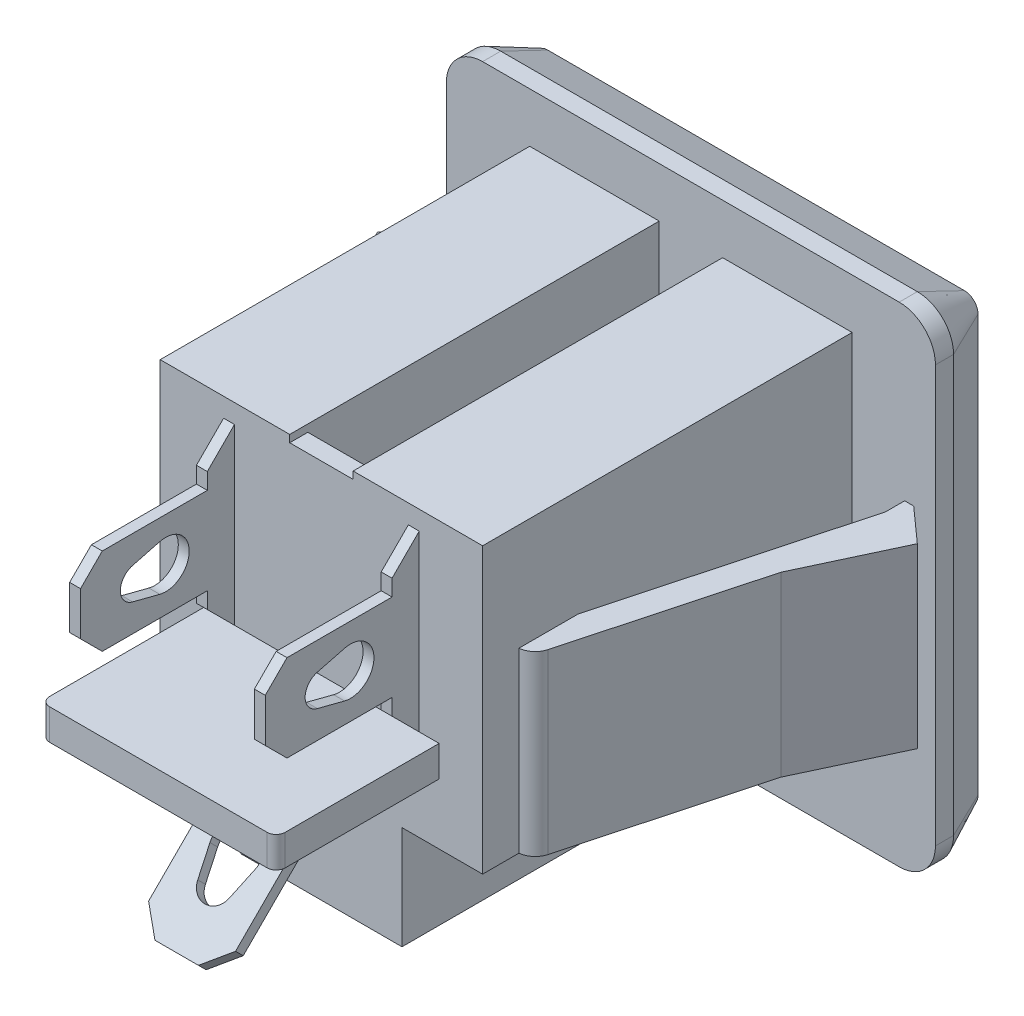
ISO-10303-21;
HEADER;
FILE_DESCRIPTION(('STEP AP214'),'2;1');
FILE_NAME('part.step','',(''),(''),'','','');
FILE_SCHEMA(('AUTOMOTIVE_DESIGN { 1 0 10303 214 1 1 1 1 }'));
ENDSEC;
DATA;
#1=APPLICATION_CONTEXT('core data for automotive mechanical design processes');
#2=APPLICATION_PROTOCOL_DEFINITION('international standard','automotive_design',2000,#1);
#3=PRODUCT_CONTEXT('',#1,'mechanical');
#4=PRODUCT('Part','Part','',(#3));
#5=PRODUCT_RELATED_PRODUCT_CATEGORY('part','',(#4));
#6=PRODUCT_DEFINITION_FORMATION('','',#4);
#7=PRODUCT_DEFINITION_CONTEXT('part definition',#1,'design');
#8=PRODUCT_DEFINITION('design','',#6,#7);
#9=PRODUCT_DEFINITION_SHAPE('','',#8);
#10=(LENGTH_UNIT() NAMED_UNIT(*) SI_UNIT(.MILLI.,.METRE.));
#11=(NAMED_UNIT(*) PLANE_ANGLE_UNIT() SI_UNIT($,.RADIAN.));
#12=(NAMED_UNIT(*) SI_UNIT($,.STERADIAN.) SOLID_ANGLE_UNIT());
#13=UNCERTAINTY_MEASURE_WITH_UNIT(LENGTH_MEASURE(1.E-05),#10,'distance_accuracy_value','');
#14=(GEOMETRIC_REPRESENTATION_CONTEXT(3) GLOBAL_UNCERTAINTY_ASSIGNED_CONTEXT((#13)) GLOBAL_UNIT_ASSIGNED_CONTEXT((#10,
#11,#12)) REPRESENTATION_CONTEXT('',''));
#15=CARTESIAN_POINT('',(0.,0.,0.));
#16=DIRECTION('',(0.,0.,1.));
#17=DIRECTION('',(1.,0.,0.));
#18=AXIS2_PLACEMENT_3D('',#15,#16,#17);
#19=CARTESIAN_POINT('',(154.598369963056,21.4000000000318,-345.1));
#20=DIRECTION('',(1.05034037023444E-13,-1.,0.));
#21=DIRECTION('',(1.,1.05034037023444E-13,0.));
#22=AXIS2_PLACEMENT_3D('',#19,#20,#21);
#23=CYLINDRICAL_SURFACE('',#22,0.5);
#24=CARTESIAN_POINT('',(154.598369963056,21.4000000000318,-345.1));
#25=DIRECTION('',(1.05034037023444E-13,-1.,0.));
#26=DIRECTION('',(1.,1.05034037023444E-13,0.));
#27=AXIS2_PLACEMENT_3D('',#24,#25,#26);
#28=CIRCLE('',#27,0.5);
#29=CARTESIAN_POINT('',(154.598369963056,21.4000000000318,-344.6));
#30=VERTEX_POINT('',#29);
#31=CARTESIAN_POINT('',(154.098369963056,21.4000000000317,-345.1));
#32=VERTEX_POINT('',#31);
#33=EDGE_CURVE('E20',#30,#32,#28,.T.);
#34=ORIENTED_EDGE('',*,*,#33,.T.);
#35=DIRECTION('',(-1.05034037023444E-13,1.,0.));
#36=VECTOR('',#35,1.);
#37=CARTESIAN_POINT('',(154.098369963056,19.7000000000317,-345.1));
#38=LINE('',#37,#36);
#39=CARTESIAN_POINT('',(154.098369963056,19.7000000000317,-345.1));
#40=VERTEX_POINT('',#39);
#41=EDGE_CURVE('E714',#32,#40,#38,.F.);
#42=ORIENTED_EDGE('',*,*,#41,.T.);
#43=CARTESIAN_POINT('',(154.598369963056,19.7000000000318,-345.1));
#44=DIRECTION('',(1.05034037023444E-13,-1.,0.));
#45=DIRECTION('',(1.,1.05034037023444E-13,0.));
#46=AXIS2_PLACEMENT_3D('',#43,#44,#45);
#47=CIRCLE('',#46,0.5);
#48=CARTESIAN_POINT('',(154.598369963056,19.7000000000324,-344.6));
#49=VERTEX_POINT('',#48);
#50=EDGE_CURVE('E719',#40,#49,#47,.F.);
#51=ORIENTED_EDGE('',*,*,#50,.T.);
#52=DIRECTION('',(0.,1.,0.));
#53=VECTOR('',#52,1.);
#54=CARTESIAN_POINT('',(154.598369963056,21.4000000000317,-344.6));
#55=LINE('',#54,#53);
#56=EDGE_CURVE('E717',#49,#30,#55,.T.);
#57=ORIENTED_EDGE('',*,*,#56,.T.);
#58=EDGE_LOOP('',(#34,#42,#51,#57));
#59=FACE_BOUND('',#58,.T.);
#60=ADVANCED_FACE('F17',(#59),#23,.T.);
#61=CARTESIAN_POINT('',(154.098369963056,19.7000000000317,-344.6));
#62=DIRECTION('',(-1.05281435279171E-13,1.,0.));
#63=DIRECTION('',(-1.,-1.05281435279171E-13,0.));
#64=AXIS2_PLACEMENT_3D('',#61,#62,#63);
#65=PLANE('',#64);
#66=DIRECTION('',(0.,0.,1.));
#67=VECTOR('',#66,1.);
#68=CARTESIAN_POINT('',(155.748369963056,19.7000000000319,-344.6));
#69=LINE('',#68,#67);
#70=CARTESIAN_POINT('',(155.748369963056,19.7000000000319,-353.175735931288));
#71=VERTEX_POINT('',#70);
#72=CARTESIAN_POINT('',(155.748369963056,19.7000000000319,-353.6));
#73=VERTEX_POINT('',#72);
#74=EDGE_CURVE('E1100',#71,#73,#69,.F.);
#75=ORIENTED_EDGE('',*,*,#74,.F.);
#76=DIRECTION('',(1.,0.,0.));
#77=VECTOR('',#76,1.);
#78=CARTESIAN_POINT('',(155.748369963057,19.7000000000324,-353.175735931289));
#79=LINE('',#78,#77);
#80=CARTESIAN_POINT('',(165.448369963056,19.7000000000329,-353.175735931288));
#81=VERTEX_POINT('',#80);
#82=EDGE_CURVE('E1080',#81,#71,#79,.F.);
#83=ORIENTED_EDGE('',*,*,#82,.F.);
#84=DIRECTION('',(0.,0.,1.));
#85=VECTOR('',#84,1.);
#86=CARTESIAN_POINT('',(165.448369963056,19.7000000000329,-344.6));
#87=LINE('',#86,#85);
#88=CARTESIAN_POINT('',(165.448369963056,19.7000000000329,-353.6));
#89=VERTEX_POINT('',#88);
#90=EDGE_CURVE('E1091',#89,#81,#87,.T.);
#91=ORIENTED_EDGE('',*,*,#90,.F.);
#92=DIRECTION('',(-1.,-1.05281435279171E-13,0.));
#93=VECTOR('',#92,1.);
#94=CARTESIAN_POINT('',(154.098369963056,19.7000000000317,-353.6));
#95=LINE('',#94,#93);
#96=CARTESIAN_POINT('',(167.098369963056,19.7000000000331,-353.6));
#97=VERTEX_POINT('',#96);
#98=EDGE_CURVE('E1089',#97,#89,#95,.T.);
#99=ORIENTED_EDGE('',*,*,#98,.F.);
#100=DIRECTION('',(0.,0.,1.));
#101=VECTOR('',#100,1.);
#102=CARTESIAN_POINT('',(167.098369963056,19.7000000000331,-344.6));
#103=LINE('',#102,#101);
#104=CARTESIAN_POINT('',(167.098369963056,19.7000000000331,-345.1));
#105=VERTEX_POINT('',#104);
#106=EDGE_CURVE('E1004',#97,#105,#103,.T.);
#107=ORIENTED_EDGE('',*,*,#106,.T.);
#108=CARTESIAN_POINT('',(166.598369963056,19.700000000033,-345.1));
#109=DIRECTION('',(-1.05034037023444E-13,1.,0.));
#110=DIRECTION('',(-1.,-1.05034037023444E-13,0.));
#111=AXIS2_PLACEMENT_3D('',#108,#109,#110);
#112=CIRCLE('',#111,0.5);
#113=CARTESIAN_POINT('',(166.598369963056,19.700000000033,-344.6));
#114=VERTEX_POINT('',#113);
#115=EDGE_CURVE('E1081',#114,#105,#112,.T.);
#116=ORIENTED_EDGE('',*,*,#115,.F.);
#117=DIRECTION('',(1.,0.,0.));
#118=VECTOR('',#117,1.);
#119=CARTESIAN_POINT('',(154.098369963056,19.700000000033,-344.6));
#120=LINE('',#119,#118);
#121=EDGE_CURVE('E1056',#114,#49,#120,.F.);
#122=ORIENTED_EDGE('',*,*,#121,.T.);
#123=ORIENTED_EDGE('',*,*,#50,.F.);
#124=DIRECTION('',(0.,0.,1.));
#125=VECTOR('',#124,1.);
#126=CARTESIAN_POINT('',(154.098369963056,19.7000000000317,-344.6));
#127=LINE('',#126,#125);
#128=CARTESIAN_POINT('',(154.098369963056,19.7000000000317,-353.6));
#129=VERTEX_POINT('',#128);
#130=EDGE_CURVE('E728',#40,#129,#127,.F.);
#131=ORIENTED_EDGE('',*,*,#130,.T.);
#132=DIRECTION('',(-1.,-1.05281435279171E-13,0.));
#133=VECTOR('',#132,1.);
#134=CARTESIAN_POINT('',(154.098369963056,19.7000000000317,-353.6));
#135=LINE('',#134,#133);
#136=EDGE_CURVE('E1097',#73,#129,#135,.T.);
#137=ORIENTED_EDGE('',*,*,#136,.F.);
#138=EDGE_LOOP('',(#75,#83,#91,#99,#107,#116,#122,#123,#131,#137));
#139=FACE_BOUND('',#138,.T.);
#140=ADVANCED_FACE('F1223',(#139),#65,.F.);
#141=CARTESIAN_POINT('',(166.598369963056,21.400000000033,-345.1));
#142=DIRECTION('',(-1.05034037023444E-13,1.,0.));
#143=DIRECTION('',(-1.,-1.05034037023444E-13,0.));
#144=AXIS2_PLACEMENT_3D('',#141,#142,#143);
#145=CYLINDRICAL_SURFACE('',#144,0.5);
#146=ORIENTED_EDGE('',*,*,#115,.T.);
#147=DIRECTION('',(1.05034037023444E-13,-1.,0.));
#148=VECTOR('',#147,1.);
#149=CARTESIAN_POINT('',(167.098369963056,19.7000000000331,-345.1));
#150=LINE('',#149,#148);
#151=CARTESIAN_POINT('',(167.098369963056,21.4000000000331,-345.1));
#152=VERTEX_POINT('',#151);
#153=EDGE_CURVE('E1001',#105,#152,#150,.F.);
#154=ORIENTED_EDGE('',*,*,#153,.T.);
#155=CARTESIAN_POINT('',(166.598369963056,21.400000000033,-345.1));
#156=DIRECTION('',(-1.05034037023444E-13,1.,0.));
#157=DIRECTION('',(-1.,-1.05034037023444E-13,0.));
#158=AXIS2_PLACEMENT_3D('',#155,#156,#157);
#159=CIRCLE('',#158,0.5);
#160=CARTESIAN_POINT('',(166.598369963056,21.400000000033,-344.6));
#161=VERTEX_POINT('',#160);
#162=EDGE_CURVE('E1099',#152,#161,#159,.F.);
#163=ORIENTED_EDGE('',*,*,#162,.T.);
#164=DIRECTION('',(0.,1.,0.));
#165=VECTOR('',#164,1.);
#166=CARTESIAN_POINT('',(166.598369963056,21.4000000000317,-344.6));
#167=LINE('',#166,#165);
#168=EDGE_CURVE('E729',#161,#114,#167,.F.);
#169=ORIENTED_EDGE('',*,*,#168,.T.);
#170=EDGE_LOOP('',(#146,#154,#163,#169));
#171=FACE_BOUND('',#170,.T.);
#172=ADVANCED_FACE('F1231',(#171),#145,.T.);
#173=CARTESIAN_POINT('',(155.748369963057,16.7301515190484,-350.205887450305));
#174=DIRECTION('',(0.,0.707106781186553,0.707106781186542));
#175=DIRECTION('',(0.,-0.707106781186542,0.707106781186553));
#176=AXIS2_PLACEMENT_3D('',#173,#174,#175);
#177=PLANE('',#176);
#178=CARTESIAN_POINT('',(160.598369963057,15.4573593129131,-348.933095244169));
#179=DIRECTION('',(0.,-0.707106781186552,-0.707106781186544));
#180=DIRECTION('',(0.,0.707106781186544,-0.707106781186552));
#181=AXIS2_PLACEMENT_3D('',#178,#179,#180);
#182=CIRCLE('',#181,1.3);
#183=CARTESIAN_POINT('',(159.339650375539,15.2275496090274,-348.703285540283));
#184=VERTEX_POINT('',#183);
#185=CARTESIAN_POINT('',(161.857089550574,15.2275496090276,-348.703285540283));
#186=VERTEX_POINT('',#185);
#187=EDGE_CURVE('E969',#184,#186,#182,.T.);
#188=ORIENTED_EDGE('',*,*,#187,.T.);
#189=DIRECTION('',(0.249999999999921,0.684653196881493,-0.684653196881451));
#190=VECTOR('',#189,1.);
#191=CARTESIAN_POINT('',(161.469791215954,14.1668894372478,-347.642625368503));
#192=LINE('',#191,#190);
#193=CARTESIAN_POINT('',(161.469791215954,14.1668894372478,-347.642625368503));
#194=VERTEX_POINT('',#193);
#195=EDGE_CURVE('E965',#194,#186,#192,.T.);
#196=ORIENTED_EDGE('',*,*,#195,.F.);
#197=CARTESIAN_POINT('',(160.598369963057,14.3259884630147,-347.80172439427));
#198=DIRECTION('',(0.,-0.707106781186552,-0.707106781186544));
#199=DIRECTION('',(0.,0.707106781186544,-0.707106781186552));
#200=AXIS2_PLACEMENT_3D('',#197,#198,#199);
#201=CIRCLE('',#200,0.899999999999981);
#202=CARTESIAN_POINT('',(159.72694871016,14.1668894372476,-347.642625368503));
#203=VERTEX_POINT('',#202);
#204=EDGE_CURVE('E959',#194,#203,#201,.T.);
#205=ORIENTED_EDGE('',*,*,#204,.T.);
#206=DIRECTION('',(0.250000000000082,-0.684653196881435,0.68465319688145));
#207=VECTOR('',#206,1.);
#208=CARTESIAN_POINT('',(159.339650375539,15.2275496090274,-348.703285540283));
#209=LINE('',#208,#207);
#210=EDGE_CURVE('E970',#184,#203,#209,.T.);
#211=ORIENTED_EDGE('',*,*,#210,.F.);
#212=EDGE_LOOP('',(#188,#196,#205,#211));
#213=FACE_BOUND('',#212,.T.);
#214=DIRECTION('',(0.7071067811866,-0.4999999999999,0.500000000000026));
#215=VECTOR('',#214,1.);
#216=CARTESIAN_POINT('',(158.198369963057,12.98248557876,-346.458221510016));
#217=LINE('',#216,#215);
#218=CARTESIAN_POINT('',(158.198369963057,12.9824855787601,-346.458221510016));
#219=VERTEX_POINT('',#218);
#220=CARTESIAN_POINT('',(159.398369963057,12.1339574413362,-345.609693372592));
#221=VERTEX_POINT('',#220);
#222=EDGE_CURVE('E939',#219,#221,#217,.T.);
#223=ORIENTED_EDGE('',*,*,#222,.T.);
#224=DIRECTION('',(1.,0.,0.));
#225=VECTOR('',#224,1.);
#226=CARTESIAN_POINT('',(159.398369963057,12.1339574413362,-345.609693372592));
#227=LINE('',#226,#225);
#228=CARTESIAN_POINT('',(161.798369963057,12.1339574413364,-345.609693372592));
#229=VERTEX_POINT('',#228);
#230=EDGE_CURVE('E934',#221,#229,#227,.T.);
#231=ORIENTED_EDGE('',*,*,#230,.T.);
#232=DIRECTION('',(0.707106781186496,0.500000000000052,-0.500000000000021));
#233=VECTOR('',#232,1.);
#234=CARTESIAN_POINT('',(161.798369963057,12.1339574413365,-345.609693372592));
#235=LINE('',#234,#233);
#236=CARTESIAN_POINT('',(162.998369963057,12.9824855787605,-346.458221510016));
#237=VERTEX_POINT('',#236);
#238=EDGE_CURVE('E929',#229,#237,#235,.T.);
#239=ORIENTED_EDGE('',*,*,#238,.T.);
#240=DIRECTION('',(0.,0.707106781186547,-0.707106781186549));
#241=VECTOR('',#240,1.);
#242=CARTESIAN_POINT('',(162.998369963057,12.9824855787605,-346.458221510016));
#243=LINE('',#242,#241);
#244=CARTESIAN_POINT('',(162.998369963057,16.7301515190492,-350.205887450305));
#245=VERTEX_POINT('',#244);
#246=EDGE_CURVE('E924',#237,#245,#243,.T.);
#247=ORIENTED_EDGE('',*,*,#246,.T.);
#248=DIRECTION('',(1.,0.,0.));
#249=VECTOR('',#248,1.);
#250=CARTESIAN_POINT('',(163.698369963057,16.7301515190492,-350.205887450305));
#251=LINE('',#250,#249);
#252=CARTESIAN_POINT('',(163.698369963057,16.7301515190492,-350.205887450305));
#253=VERTEX_POINT('',#252);
#254=EDGE_CURVE('E919',#245,#253,#251,.T.);
#255=ORIENTED_EDGE('',*,*,#254,.T.);
#256=DIRECTION('',(0.242535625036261,0.685994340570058,-0.685994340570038));
#257=VECTOR('',#256,1.);
#258=CARTESIAN_POINT('',(163.698369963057,16.7301515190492,-350.205887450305));
#259=LINE('',#258,#257);
#260=CARTESIAN_POINT('',(164.698369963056,19.5585786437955,-353.034314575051));
#261=VERTEX_POINT('',#260);
#262=EDGE_CURVE('E914',#253,#261,#259,.T.);
#263=ORIENTED_EDGE('',*,*,#262,.T.);
#264=DIRECTION('',(1.,0.,0.));
#265=VECTOR('',#264,1.);
#266=CARTESIAN_POINT('',(165.448369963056,19.5585786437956,-353.034314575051));
#267=LINE('',#266,#265);
#268=CARTESIAN_POINT('',(165.448369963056,19.5585786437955,-353.034314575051));
#269=VERTEX_POINT('',#268);
#270=EDGE_CURVE('E953',#261,#269,#267,.T.);
#271=ORIENTED_EDGE('',*,*,#270,.T.);
#272=DIRECTION('',(0.,-0.707106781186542,0.707106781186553));
#273=VECTOR('',#272,1.);
#274=CARTESIAN_POINT('',(165.448369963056,16.7301515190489,-350.205887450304));
#275=LINE('',#274,#273);
#276=EDGE_CURVE('E1077',#269,#81,#275,.F.);
#277=ORIENTED_EDGE('',*,*,#276,.T.);
#278=ORIENTED_EDGE('',*,*,#82,.T.);
#279=DIRECTION('',(0.,-0.707106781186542,0.707106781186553));
#280=VECTOR('',#279,1.);
#281=CARTESIAN_POINT('',(155.748369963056,16.7301515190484,-350.205887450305));
#282=LINE('',#281,#280);
#283=CARTESIAN_POINT('',(155.748369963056,19.5585786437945,-353.034314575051));
#284=VERTEX_POINT('',#283);
#285=EDGE_CURVE('E1076',#71,#284,#282,.T.);
#286=ORIENTED_EDGE('',*,*,#285,.T.);
#287=DIRECTION('',(1.,0.,0.));
#288=VECTOR('',#287,1.);
#289=CARTESIAN_POINT('',(155.748369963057,19.5585786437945,-353.034314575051));
#290=LINE('',#289,#288);
#291=CARTESIAN_POINT('',(156.498369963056,19.5585786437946,-353.034314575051));
#292=VERTEX_POINT('',#291);
#293=EDGE_CURVE('E1074',#284,#292,#290,.T.);
#294=ORIENTED_EDGE('',*,*,#293,.T.);
#295=DIRECTION('',(0.242535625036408,-0.685994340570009,0.685994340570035));
#296=VECTOR('',#295,1.);
#297=CARTESIAN_POINT('',(156.498369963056,19.5585786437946,-353.034314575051));
#298=LINE('',#297,#296);
#299=CARTESIAN_POINT('',(157.498369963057,16.7301515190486,-350.205887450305));
#300=VERTEX_POINT('',#299);
#301=EDGE_CURVE('E951',#292,#300,#298,.T.);
#302=ORIENTED_EDGE('',*,*,#301,.T.);
#303=DIRECTION('',(1.,0.,0.));
#304=VECTOR('',#303,1.);
#305=CARTESIAN_POINT('',(157.498369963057,16.7301515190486,-350.205887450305));
#306=LINE('',#305,#304);
#307=CARTESIAN_POINT('',(158.198369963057,16.7301515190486,-350.205887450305));
#308=VERTEX_POINT('',#307);
#309=EDGE_CURVE('E949',#300,#308,#306,.T.);
#310=ORIENTED_EDGE('',*,*,#309,.T.);
#311=DIRECTION('',(0.,-0.707106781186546,0.707106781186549));
#312=VECTOR('',#311,1.);
#313=CARTESIAN_POINT('',(158.198369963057,16.7301515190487,-350.205887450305));
#314=LINE('',#313,#312);
#315=EDGE_CURVE('E944',#308,#219,#314,.T.);
#316=ORIENTED_EDGE('',*,*,#315,.T.);
#317=EDGE_LOOP('',(#223,#231,#239,#247,#255,#263,#271,#277,#278,#286,#294,#302,#310,#316));
#318=FACE_BOUND('',#317,.T.);
#319=ADVANCED_FACE('F2433',(#213,#318),#177,.T.);
#320=CARTESIAN_POINT('',(154.098369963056,21.4000000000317,-344.6));
#321=DIRECTION('',(0.,0.,-1.));
#322=DIRECTION('',(0.,1.,0.));
#323=AXIS2_PLACEMENT_3D('',#320,#321,#322);
#324=PLANE('',#323);
#325=DIRECTION('',(1.,1.05047914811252E-13,0.));
#326=VECTOR('',#325,1.);
#327=CARTESIAN_POINT('',(154.098369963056,21.4000000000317,-344.6));
#328=LINE('',#327,#326);
#329=EDGE_CURVE('E735',#161,#30,#328,.F.);
#330=ORIENTED_EDGE('',*,*,#329,.T.);
#331=ORIENTED_EDGE('',*,*,#56,.F.);
#332=ORIENTED_EDGE('',*,*,#121,.F.);
#333=ORIENTED_EDGE('',*,*,#168,.F.);
#334=EDGE_LOOP('',(#330,#331,#332,#333));
#335=FACE_BOUND('',#334,.T.);
#336=ADVANCED_FACE('F1226',(#335),#324,.F.);
#337=CARTESIAN_POINT('',(154.098369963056,19.7000000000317,-344.6));
#338=DIRECTION('',(1.,1.05034037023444E-13,0.));
#339=DIRECTION('',(-1.05034037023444E-13,1.,0.));
#340=AXIS2_PLACEMENT_3D('',#337,#338,#339);
#341=PLANE('',#340);
#342=ORIENTED_EDGE('',*,*,#130,.F.);
#343=ORIENTED_EDGE('',*,*,#41,.F.);
#344=DIRECTION('',(0.,0.,1.));
#345=VECTOR('',#344,1.);
#346=CARTESIAN_POINT('',(154.098369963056,21.4000000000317,-344.6));
#347=LINE('',#346,#345);
#348=CARTESIAN_POINT('',(154.098369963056,21.4000000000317,-353.6));
#349=VERTEX_POINT('',#348);
#350=EDGE_CURVE('E725',#32,#349,#347,.F.);
#351=ORIENTED_EDGE('',*,*,#350,.T.);
#352=DIRECTION('',(-1.05034037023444E-13,1.,0.));
#353=VECTOR('',#352,1.);
#354=CARTESIAN_POINT('',(154.098369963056,19.7000000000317,-353.6));
#355=LINE('',#354,#353);
#356=EDGE_CURVE('E1047',#129,#349,#355,.T.);
#357=ORIENTED_EDGE('',*,*,#356,.F.);
#358=EDGE_LOOP('',(#342,#343,#351,#357));
#359=FACE_BOUND('',#358,.T.);
#360=ADVANCED_FACE('F723',(#359),#341,.F.);
#361=CARTESIAN_POINT('',(167.098369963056,19.7000000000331,-344.6));
#362=DIRECTION('',(-1.,-1.05034037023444E-13,0.));
#363=DIRECTION('',(1.05034037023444E-13,-1.,0.));
#364=AXIS2_PLACEMENT_3D('',#361,#362,#363);
#365=PLANE('',#364);
#366=DIRECTION('',(0.,0.,1.));
#367=VECTOR('',#366,1.);
#368=CARTESIAN_POINT('',(167.098369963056,21.4000000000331,-344.6));
#369=LINE('',#368,#367);
#370=CARTESIAN_POINT('',(167.098369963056,21.4000000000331,-353.6));
#371=VERTEX_POINT('',#370);
#372=EDGE_CURVE('E1011',#371,#152,#369,.T.);
#373=ORIENTED_EDGE('',*,*,#372,.T.);
#374=ORIENTED_EDGE('',*,*,#153,.F.);
#375=ORIENTED_EDGE('',*,*,#106,.F.);
#376=DIRECTION('',(1.05034037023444E-13,-1.,0.));
#377=VECTOR('',#376,1.);
#378=CARTESIAN_POINT('',(167.098369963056,19.7000000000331,-353.6));
#379=LINE('',#378,#377);
#380=EDGE_CURVE('E1000',#371,#97,#379,.T.);
#381=ORIENTED_EDGE('',*,*,#380,.F.);
#382=EDGE_LOOP('',(#373,#374,#375,#381));
#383=FACE_BOUND('',#382,.T.);
#384=ADVANCED_FACE('F1235',(#383),#365,.F.);
#385=CARTESIAN_POINT('',(165.998369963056,26.200000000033,-349.8));
#386=DIRECTION('',(-1.,-1.05047914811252E-13,0.));
#387=DIRECTION('',(1.05047914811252E-13,-1.,0.));
#388=AXIS2_PLACEMENT_3D('',#385,#386,#387);
#389=CYLINDRICAL_SURFACE('',#388,1.3);
#390=CARTESIAN_POINT('',(165.998369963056,26.200000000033,-349.8));
#391=DIRECTION('',(-1.,-1.05047914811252E-13,0.));
#392=DIRECTION('',(1.05047914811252E-13,-1.,0.));
#393=AXIS2_PLACEMENT_3D('',#390,#391,#392);
#394=CIRCLE('',#393,1.3);
#395=CARTESIAN_POINT('',(165.998369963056,24.9412804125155,-349.475));
#396=VERTEX_POINT('',#395);
#397=CARTESIAN_POINT('',(165.998369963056,27.4587195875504,-349.475));
#398=VERTEX_POINT('',#397);
#399=EDGE_CURVE('E1034',#396,#398,#394,.F.);
#400=ORIENTED_EDGE('',*,*,#399,.T.);
#401=DIRECTION('',(1.,0.,0.));
#402=VECTOR('',#401,1.);
#403=CARTESIAN_POINT('',(165.998369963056,27.4587195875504,-349.475));
#404=LINE('',#403,#402);
#405=CARTESIAN_POINT('',(165.398369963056,27.4587195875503,-349.475));
#406=VERTEX_POINT('',#405);
#407=EDGE_CURVE('E997',#406,#398,#404,.T.);
#408=ORIENTED_EDGE('',*,*,#407,.F.);
#409=CARTESIAN_POINT('',(165.398369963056,26.2000000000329,-349.8));
#410=DIRECTION('',(-1.,-1.05047914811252E-13,0.));
#411=DIRECTION('',(1.05047914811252E-13,-1.,0.));
#412=AXIS2_PLACEMENT_3D('',#409,#410,#411);
#413=CIRCLE('',#412,1.3);
#414=CARTESIAN_POINT('',(165.398369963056,24.9412804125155,-349.475));
#415=VERTEX_POINT('',#414);
#416=EDGE_CURVE('E1213',#415,#406,#413,.F.);
#417=ORIENTED_EDGE('',*,*,#416,.F.);
#418=DIRECTION('',(1.,0.,0.));
#419=VECTOR('',#418,1.);
#420=CARTESIAN_POINT('',(165.998369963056,24.9412804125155,-349.475));
#421=LINE('',#420,#419);
#422=EDGE_CURVE('E992',#396,#415,#421,.F.);
#423=ORIENTED_EDGE('',*,*,#422,.F.);
#424=EDGE_LOOP('',(#400,#408,#417,#423));
#425=FACE_BOUND('',#424,.T.);
#426=ADVANCED_FACE('F2422',(#425),#389,.F.);
#427=CARTESIAN_POINT('',(165.998369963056,27.0714212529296,-347.975));
#428=DIRECTION('',(1.01697280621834E-13,-0.968245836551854,-0.25));
#429=DIRECTION('',(0.,0.25,-0.968245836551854));
#430=AXIS2_PLACEMENT_3D('',#427,#428,#429);
#431=PLANE('',#430);
#432=DIRECTION('',(0.,-0.25,0.968245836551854));
#433=VECTOR('',#432,1.);
#434=CARTESIAN_POINT('',(165.398369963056,27.4587195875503,-349.475));
#435=LINE('',#434,#433);
#436=CARTESIAN_POINT('',(165.398369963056,27.0714212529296,-347.975));
#437=VERTEX_POINT('',#436);
#438=EDGE_CURVE('E1212',#406,#437,#435,.T.);
#439=ORIENTED_EDGE('',*,*,#438,.F.);
#440=ORIENTED_EDGE('',*,*,#407,.T.);
#441=DIRECTION('',(0.,-0.25,0.968245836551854));
#442=VECTOR('',#441,1.);
#443=CARTESIAN_POINT('',(165.998369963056,27.4587195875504,-349.475));
#444=LINE('',#443,#442);
#445=CARTESIAN_POINT('',(165.998369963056,27.0714212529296,-347.975));
#446=VERTEX_POINT('',#445);
#447=EDGE_CURVE('E1206',#398,#446,#444,.T.);
#448=ORIENTED_EDGE('',*,*,#447,.T.);
#449=DIRECTION('',(-1.,-1.05047914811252E-13,0.));
#450=VECTOR('',#449,1.);
#451=CARTESIAN_POINT('',(165.998369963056,27.0714212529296,-347.975));
#452=LINE('',#451,#450);
#453=EDGE_CURVE('E995',#446,#437,#452,.T.);
#454=ORIENTED_EDGE('',*,*,#453,.T.);
#455=EDGE_LOOP('',(#439,#440,#448,#454));
#456=FACE_BOUND('',#455,.T.);
#457=ADVANCED_FACE('F2418',(#456),#431,.T.);
#458=CARTESIAN_POINT('',(165.998369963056,26.200000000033,-348.2));
#459=DIRECTION('',(-1.,-1.05047914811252E-13,0.));
#460=DIRECTION('',(1.05047914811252E-13,-1.,0.));
#461=AXIS2_PLACEMENT_3D('',#458,#459,#460);
#462=CYLINDRICAL_SURFACE('',#461,0.900000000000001);
#463=CARTESIAN_POINT('',(165.398369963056,26.2000000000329,-348.2));
#464=DIRECTION('',(-1.,-1.05047914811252E-13,0.));
#465=DIRECTION('',(1.05047914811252E-13,-1.,0.));
#466=AXIS2_PLACEMENT_3D('',#463,#464,#465);
#467=CIRCLE('',#466,0.900000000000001);
#468=CARTESIAN_POINT('',(165.398369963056,25.3285787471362,-347.975));
#469=VERTEX_POINT('',#468);
#470=EDGE_CURVE('E1208',#437,#469,#467,.F.);
#471=ORIENTED_EDGE('',*,*,#470,.F.);
#472=ORIENTED_EDGE('',*,*,#453,.F.);
#473=CARTESIAN_POINT('',(165.998369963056,26.200000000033,-348.2));
#474=DIRECTION('',(-1.,-1.05047914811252E-13,0.));
#475=DIRECTION('',(1.05047914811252E-13,-1.,0.));
#476=AXIS2_PLACEMENT_3D('',#473,#474,#475);
#477=CIRCLE('',#476,0.900000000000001);
#478=CARTESIAN_POINT('',(165.998369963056,25.3285787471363,-347.975));
#479=VERTEX_POINT('',#478);
#480=EDGE_CURVE('E1203',#446,#479,#477,.F.);
#481=ORIENTED_EDGE('',*,*,#480,.T.);
#482=DIRECTION('',(1.,0.,0.));
#483=VECTOR('',#482,1.);
#484=CARTESIAN_POINT('',(165.998369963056,25.3285787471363,-347.975));
#485=LINE('',#484,#483);
#486=EDGE_CURVE('E989',#469,#479,#485,.T.);
#487=ORIENTED_EDGE('',*,*,#486,.F.);
#488=EDGE_LOOP('',(#471,#472,#481,#487));
#489=FACE_BOUND('',#488,.T.);
#490=ADVANCED_FACE('F2414',(#489),#462,.F.);
#491=CARTESIAN_POINT('',(165.998369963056,25.3285787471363,-347.975));
#492=DIRECTION('',(-1.01700257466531E-13,0.968245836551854,-0.250000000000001));
#493=DIRECTION('',(0.,0.250000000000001,0.968245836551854));
#494=AXIS2_PLACEMENT_3D('',#491,#492,#493);
#495=PLANE('',#494);
#496=DIRECTION('',(0.,-0.250000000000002,-0.968245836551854));
#497=VECTOR('',#496,1.);
#498=CARTESIAN_POINT('',(165.398369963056,25.3285787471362,-347.975));
#499=LINE('',#498,#497);
#500=EDGE_CURVE('E1216',#469,#415,#499,.T.);
#501=ORIENTED_EDGE('',*,*,#500,.F.);
#502=ORIENTED_EDGE('',*,*,#486,.T.);
#503=DIRECTION('',(0.,-0.25,-0.968245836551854));
#504=VECTOR('',#503,1.);
#505=CARTESIAN_POINT('',(165.998369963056,25.3285787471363,-347.975));
#506=LINE('',#505,#504);
#507=EDGE_CURVE('E1205',#479,#396,#506,.T.);
#508=ORIENTED_EDGE('',*,*,#507,.T.);
#509=ORIENTED_EDGE('',*,*,#422,.T.);
#510=EDGE_LOOP('',(#501,#502,#508,#509));
#511=FACE_BOUND('',#510,.T.);
#512=ADVANCED_FACE('F2410',(#511),#495,.T.);
#513=CARTESIAN_POINT('',(165.998369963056,27.400000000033,-345.1));
#514=DIRECTION('',(0.,-0.707106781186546,-0.707106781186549));
#515=DIRECTION('',(0.,0.707106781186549,-0.707106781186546));
#516=AXIS2_PLACEMENT_3D('',#513,#514,#515);
#517=PLANE('',#516);
#518=DIRECTION('',(0.,0.707106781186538,-0.707106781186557));
#519=VECTOR('',#518,1.);
#520=CARTESIAN_POINT('',(165.398369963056,27.4000000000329,-345.1));
#521=LINE('',#520,#519);
#522=CARTESIAN_POINT('',(165.398369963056,27.4000000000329,-345.1));
#523=VERTEX_POINT('',#522);
#524=CARTESIAN_POINT('',(165.398369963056,28.6000000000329,-346.3));
#525=VERTEX_POINT('',#524);
#526=EDGE_CURVE('E1254',#523,#525,#521,.T.);
#527=ORIENTED_EDGE('',*,*,#526,.F.);
#528=DIRECTION('',(1.,0.,0.));
#529=VECTOR('',#528,1.);
#530=CARTESIAN_POINT('',(165.998369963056,27.4000000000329,-345.1));
#531=LINE('',#530,#529);
#532=CARTESIAN_POINT('',(165.998369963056,27.4000000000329,-345.1));
#533=VERTEX_POINT('',#532);
#534=EDGE_CURVE('E971',#523,#533,#531,.T.);
#535=ORIENTED_EDGE('',*,*,#534,.T.);
#536=DIRECTION('',(0.,0.707106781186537,-0.707106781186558));
#537=VECTOR('',#536,1.);
#538=CARTESIAN_POINT('',(165.998369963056,27.400000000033,-345.1));
#539=LINE('',#538,#537);
#540=CARTESIAN_POINT('',(165.998369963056,28.600000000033,-346.3));
#541=VERTEX_POINT('',#540);
#542=EDGE_CURVE('E1268',#533,#541,#539,.T.);
#543=ORIENTED_EDGE('',*,*,#542,.T.);
#544=DIRECTION('',(1.,1.05034037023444E-13,0.));
#545=VECTOR('',#544,1.);
#546=CARTESIAN_POINT('',(165.998369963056,28.600000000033,-346.3));
#547=LINE('',#546,#545);
#548=EDGE_CURVE('E987',#541,#525,#547,.F.);
#549=ORIENTED_EDGE('',*,*,#548,.T.);
#550=EDGE_LOOP('',(#527,#535,#543,#549));
#551=FACE_BOUND('',#550,.T.);
#552=ADVANCED_FACE('F2406',(#551),#517,.F.);
#553=CARTESIAN_POINT('',(165.998369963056,28.600000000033,-346.3));
#554=DIRECTION('',(1.05034037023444E-13,-1.,0.));
#555=DIRECTION('',(1.,1.05034037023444E-13,0.));
#556=AXIS2_PLACEMENT_3D('',#553,#554,#555);
#557=PLANE('',#556);
#558=DIRECTION('',(0.,0.,1.));
#559=VECTOR('',#558,1.);
#560=CARTESIAN_POINT('',(165.398369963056,28.6000000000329,-352.1));
#561=LINE('',#560,#559);
#562=CARTESIAN_POINT('',(165.398369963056,28.6000000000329,-352.1));
#563=VERTEX_POINT('',#562);
#564=EDGE_CURVE('E1257',#525,#563,#561,.F.);
#565=ORIENTED_EDGE('',*,*,#564,.F.);
#566=ORIENTED_EDGE('',*,*,#548,.F.);
#567=DIRECTION('',(0.,0.,1.));
#568=VECTOR('',#567,1.);
#569=CARTESIAN_POINT('',(165.998369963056,28.600000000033,-352.1));
#570=LINE('',#569,#568);
#571=CARTESIAN_POINT('',(165.998369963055,28.600000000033,-352.1));
#572=VERTEX_POINT('',#571);
#573=EDGE_CURVE('E1270',#541,#572,#570,.F.);
#574=ORIENTED_EDGE('',*,*,#573,.T.);
#575=DIRECTION('',(1.,0.,0.));
#576=VECTOR('',#575,1.);
#577=CARTESIAN_POINT('',(165.998369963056,28.600000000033,-352.1));
#578=LINE('',#577,#576);
#579=EDGE_CURVE('E985',#572,#563,#578,.F.);
#580=ORIENTED_EDGE('',*,*,#579,.T.);
#581=EDGE_LOOP('',(#565,#566,#574,#580));
#582=FACE_BOUND('',#581,.T.);
#583=ADVANCED_FACE('F2402',(#582),#557,.F.);
#584=CARTESIAN_POINT('',(165.998369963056,28.600000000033,-352.1));
#585=DIRECTION('',(0.,0.,-1.));
#586=DIRECTION('',(0.,1.,0.));
#587=AXIS2_PLACEMENT_3D('',#584,#585,#586);
#588=PLANE('',#587);
#589=DIRECTION('',(1.05034037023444E-13,-1.,0.));
#590=VECTOR('',#589,1.);
#591=CARTESIAN_POINT('',(165.398369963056,28.6000000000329,-352.1));
#592=LINE('',#591,#590);
#593=CARTESIAN_POINT('',(165.398369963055,29.5000000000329,-352.1));
#594=VERTEX_POINT('',#593);
#595=EDGE_CURVE('E1260',#563,#594,#592,.F.);
#596=ORIENTED_EDGE('',*,*,#595,.F.);
#597=ORIENTED_EDGE('',*,*,#579,.F.);
#598=DIRECTION('',(1.05034037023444E-13,-1.,0.));
#599=VECTOR('',#598,1.);
#600=CARTESIAN_POINT('',(165.998369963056,28.600000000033,-352.1));
#601=LINE('',#600,#599);
#602=CARTESIAN_POINT('',(165.998369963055,29.5000000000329,-352.1));
#603=VERTEX_POINT('',#602);
#604=EDGE_CURVE('E1272',#572,#603,#601,.F.);
#605=ORIENTED_EDGE('',*,*,#604,.T.);
#606=DIRECTION('',(1.,0.,0.));
#607=VECTOR('',#606,1.);
#608=CARTESIAN_POINT('',(165.998369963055,29.500000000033,-352.1));
#609=LINE('',#608,#607);
#610=EDGE_CURVE('E983',#603,#594,#609,.F.);
#611=ORIENTED_EDGE('',*,*,#610,.T.);
#612=EDGE_LOOP('',(#596,#597,#605,#611));
#613=FACE_BOUND('',#612,.T.);
#614=ADVANCED_FACE('F2398',(#613),#588,.F.);
#615=CARTESIAN_POINT('',(165.998369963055,31.000000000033,-353.6));
#616=DIRECTION('',(0.,-0.707106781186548,-0.707106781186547));
#617=DIRECTION('',(0.,0.707106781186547,-0.707106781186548));
#618=AXIS2_PLACEMENT_3D('',#615,#616,#617);
#619=PLANE('',#618);
#620=DIRECTION('',(0.,0.707106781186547,-0.707106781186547));
#621=VECTOR('',#620,1.);
#622=CARTESIAN_POINT('',(165.398369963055,29.5000000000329,-352.1));
#623=LINE('',#622,#621);
#624=CARTESIAN_POINT('',(165.398369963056,31.0000000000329,-353.6));
#625=VERTEX_POINT('',#624);
#626=EDGE_CURVE('E1035',#594,#625,#623,.T.);
#627=ORIENTED_EDGE('',*,*,#626,.F.);
#628=ORIENTED_EDGE('',*,*,#610,.F.);
#629=DIRECTION('',(0.,0.707106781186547,-0.707106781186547));
#630=VECTOR('',#629,1.);
#631=CARTESIAN_POINT('',(165.998369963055,29.500000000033,-352.1));
#632=LINE('',#631,#630);
#633=CARTESIAN_POINT('',(165.998369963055,31.0000000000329,-353.6));
#634=VERTEX_POINT('',#633);
#635=EDGE_CURVE('E1025',#603,#634,#632,.T.);
#636=ORIENTED_EDGE('',*,*,#635,.T.);
#637=DIRECTION('',(1.,0.,0.));
#638=VECTOR('',#637,1.);
#639=CARTESIAN_POINT('',(165.998369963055,31.0000000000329,-353.6));
#640=LINE('',#639,#638);
#641=EDGE_CURVE('E981',#625,#634,#640,.T.);
#642=ORIENTED_EDGE('',*,*,#641,.F.);
#643=EDGE_LOOP('',(#627,#628,#636,#642));
#644=FACE_BOUND('',#643,.T.);
#645=ADVANCED_FACE('F2394',(#644),#619,.F.);
#646=CARTESIAN_POINT('',(165.998369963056,21.400000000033,-353.6));
#647=DIRECTION('',(0.,0.707106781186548,-0.707106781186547));
#648=DIRECTION('',(0.,0.707106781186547,0.707106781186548));
#649=AXIS2_PLACEMENT_3D('',#646,#647,#648);
#650=PLANE('',#649);
#651=DIRECTION('',(0.,0.707106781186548,0.707106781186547));
#652=VECTOR('',#651,1.);
#653=CARTESIAN_POINT('',(165.398369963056,21.4000000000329,-353.6));
#654=LINE('',#653,#652);
#655=CARTESIAN_POINT('',(165.398369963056,21.4000000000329,-353.6));
#656=VERTEX_POINT('',#655);
#657=CARTESIAN_POINT('',(165.398369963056,22.9000000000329,-352.1));
#658=VERTEX_POINT('',#657);
#659=EDGE_CURVE('E1031',#656,#658,#654,.T.);
#660=ORIENTED_EDGE('',*,*,#659,.F.);
#661=DIRECTION('',(1.,1.05047914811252E-13,0.));
#662=VECTOR('',#661,1.);
#663=CARTESIAN_POINT('',(154.098369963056,21.4000000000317,-353.6));
#664=LINE('',#663,#662);
#665=CARTESIAN_POINT('',(165.998369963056,21.400000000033,-353.6));
#666=VERTEX_POINT('',#665);
#667=EDGE_CURVE('E1012',#656,#666,#664,.T.);
#668=ORIENTED_EDGE('',*,*,#667,.T.);
#669=DIRECTION('',(0.,0.707106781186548,0.707106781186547));
#670=VECTOR('',#669,1.);
#671=CARTESIAN_POINT('',(165.998369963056,21.400000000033,-353.6));
#672=LINE('',#671,#670);
#673=CARTESIAN_POINT('',(165.998369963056,22.9000000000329,-352.1));
#674=VERTEX_POINT('',#673);
#675=EDGE_CURVE('E1022',#666,#674,#672,.T.);
#676=ORIENTED_EDGE('',*,*,#675,.T.);
#677=DIRECTION('',(1.,0.,0.));
#678=VECTOR('',#677,1.);
#679=CARTESIAN_POINT('',(165.998369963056,22.900000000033,-352.1));
#680=LINE('',#679,#678);
#681=EDGE_CURVE('E979',#674,#658,#680,.F.);
#682=ORIENTED_EDGE('',*,*,#681,.T.);
#683=EDGE_LOOP('',(#660,#668,#676,#682));
#684=FACE_BOUND('',#683,.T.);
#685=ADVANCED_FACE('F2390',(#684),#650,.F.);
#686=CARTESIAN_POINT('',(165.998369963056,22.900000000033,-352.1));
#687=DIRECTION('',(0.,0.,-1.));
#688=DIRECTION('',(0.,1.,0.));
#689=AXIS2_PLACEMENT_3D('',#686,#687,#688);
#690=PLANE('',#689);
#691=DIRECTION('',(1.05034037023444E-13,-1.,0.));
#692=VECTOR('',#691,1.);
#693=CARTESIAN_POINT('',(165.398369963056,28.6000000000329,-352.1));
#694=LINE('',#693,#692);
#695=CARTESIAN_POINT('',(165.398369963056,23.8000000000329,-352.1));
#696=VERTEX_POINT('',#695);
#697=EDGE_CURVE('E1211',#658,#696,#694,.F.);
#698=ORIENTED_EDGE('',*,*,#697,.F.);
#699=ORIENTED_EDGE('',*,*,#681,.F.);
#700=DIRECTION('',(1.05034037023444E-13,-1.,0.));
#701=VECTOR('',#700,1.);
#702=CARTESIAN_POINT('',(165.998369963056,28.600000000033,-352.1));
#703=LINE('',#702,#701);
#704=CARTESIAN_POINT('',(165.998369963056,23.8000000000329,-352.1));
#705=VERTEX_POINT('',#704);
#706=EDGE_CURVE('E1024',#674,#705,#703,.F.);
#707=ORIENTED_EDGE('',*,*,#706,.T.);
#708=DIRECTION('',(-1.,-1.05034037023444E-13,0.));
#709=VECTOR('',#708,1.);
#710=CARTESIAN_POINT('',(165.998369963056,23.800000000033,-352.1));
#711=LINE('',#710,#709);
#712=EDGE_CURVE('E977',#705,#696,#711,.T.);
#713=ORIENTED_EDGE('',*,*,#712,.T.);
#714=EDGE_LOOP('',(#698,#699,#707,#713));
#715=FACE_BOUND('',#714,.T.);
#716=ADVANCED_FACE('F2386',(#715),#690,.F.);
#717=CARTESIAN_POINT('',(165.998369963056,23.800000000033,-346.3));
#718=DIRECTION('',(-1.05034037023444E-13,1.,0.));
#719=DIRECTION('',(-1.,-1.05034037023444E-13,0.));
#720=AXIS2_PLACEMENT_3D('',#717,#718,#719);
#721=PLANE('',#720);
#722=DIRECTION('',(0.,0.,1.));
#723=VECTOR('',#722,1.);
#724=CARTESIAN_POINT('',(165.398369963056,23.8000000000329,-352.1));
#725=LINE('',#724,#723);
#726=CARTESIAN_POINT('',(165.398369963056,23.8000000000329,-346.3));
#727=VERTEX_POINT('',#726);
#728=EDGE_CURVE('E1245',#696,#727,#725,.T.);
#729=ORIENTED_EDGE('',*,*,#728,.F.);
#730=ORIENTED_EDGE('',*,*,#712,.F.);
#731=DIRECTION('',(0.,0.,1.));
#732=VECTOR('',#731,1.);
#733=CARTESIAN_POINT('',(165.998369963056,23.800000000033,-352.1));
#734=LINE('',#733,#732);
#735=CARTESIAN_POINT('',(165.998369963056,23.800000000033,-346.3));
#736=VERTEX_POINT('',#735);
#737=EDGE_CURVE('E1277',#705,#736,#734,.T.);
#738=ORIENTED_EDGE('',*,*,#737,.T.);
#739=DIRECTION('',(1.,0.,0.));
#740=VECTOR('',#739,1.);
#741=CARTESIAN_POINT('',(165.998369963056,23.800000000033,-346.3));
#742=LINE('',#741,#740);
#743=EDGE_CURVE('E975',#736,#727,#742,.F.);
#744=ORIENTED_EDGE('',*,*,#743,.T.);
#745=EDGE_LOOP('',(#729,#730,#738,#744));
#746=FACE_BOUND('',#745,.T.);
#747=ADVANCED_FACE('F2382',(#746),#721,.F.);
#748=CARTESIAN_POINT('',(165.998369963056,23.800000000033,-346.3));
#749=DIRECTION('',(0.,0.707106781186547,-0.707106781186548));
#750=DIRECTION('',(0.,0.707106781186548,0.707106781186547));
#751=AXIS2_PLACEMENT_3D('',#748,#749,#750);
#752=PLANE('',#751);
#753=DIRECTION('',(0.,0.707106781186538,0.707106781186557));
#754=VECTOR('',#753,1.);
#755=CARTESIAN_POINT('',(165.398369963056,23.8000000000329,-346.3));
#756=LINE('',#755,#754);
#757=CARTESIAN_POINT('',(165.398369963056,25.0000000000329,-345.1));
#758=VERTEX_POINT('',#757);
#759=EDGE_CURVE('E1248',#727,#758,#756,.T.);
#760=ORIENTED_EDGE('',*,*,#759,.F.);
#761=ORIENTED_EDGE('',*,*,#743,.F.);
#762=DIRECTION('',(0.,0.707106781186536,0.707106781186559));
#763=VECTOR('',#762,1.);
#764=CARTESIAN_POINT('',(165.998369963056,23.800000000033,-346.3));
#765=LINE('',#764,#763);
#766=CARTESIAN_POINT('',(165.998369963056,25.000000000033,-345.1));
#767=VERTEX_POINT('',#766);
#768=EDGE_CURVE('E1279',#736,#767,#765,.T.);
#769=ORIENTED_EDGE('',*,*,#768,.T.);
#770=DIRECTION('',(1.,0.,0.));
#771=VECTOR('',#770,1.);
#772=CARTESIAN_POINT('',(165.998369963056,25.000000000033,-345.1));
#773=LINE('',#772,#771);
#774=EDGE_CURVE('E973',#767,#758,#773,.F.);
#775=ORIENTED_EDGE('',*,*,#774,.T.);
#776=EDGE_LOOP('',(#760,#761,#769,#775));
#777=FACE_BOUND('',#776,.T.);
#778=ADVANCED_FACE('F2378',(#777),#752,.F.);
#779=CARTESIAN_POINT('',(165.998369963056,25.000000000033,-345.1));
#780=DIRECTION('',(0.,0.,-1.));
#781=DIRECTION('',(0.,1.,0.));
#782=AXIS2_PLACEMENT_3D('',#779,#780,#781);
#783=PLANE('',#782);
#784=DIRECTION('',(1.05034037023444E-13,-1.,0.));
#785=VECTOR('',#784,1.);
#786=CARTESIAN_POINT('',(165.398369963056,28.6000000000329,-345.1));
#787=LINE('',#786,#785);
#788=EDGE_CURVE('E1251',#758,#523,#787,.F.);
#789=ORIENTED_EDGE('',*,*,#788,.F.);
#790=ORIENTED_EDGE('',*,*,#774,.F.);
#791=DIRECTION('',(1.05034037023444E-13,-1.,0.));
#792=VECTOR('',#791,1.);
#793=CARTESIAN_POINT('',(165.998369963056,28.600000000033,-345.1));
#794=LINE('',#793,#792);
#795=EDGE_CURVE('E1281',#767,#533,#794,.F.);
#796=ORIENTED_EDGE('',*,*,#795,.T.);
#797=ORIENTED_EDGE('',*,*,#534,.F.);
#798=EDGE_LOOP('',(#789,#790,#796,#797));
#799=FACE_BOUND('',#798,.T.);
#800=ADVANCED_FACE('F2374',(#799),#783,.F.);
#801=CARTESIAN_POINT('',(159.339650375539,15.2275496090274,-348.703285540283));
#802=DIRECTION('',(0.968245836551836,0.17677669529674,-0.176776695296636));
#803=DIRECTION('',(-0.17960530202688,0.98373875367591,0.));
#804=AXIS2_PLACEMENT_3D('',#801,#802,#803);
#805=PLANE('',#804);
#806=DIRECTION('',(-0.250000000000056,0.684653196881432,-0.684653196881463));
#807=VECTOR('',#806,1.);
#808=CARTESIAN_POINT('',(159.72694871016,13.7426253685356,-348.066889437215));
#809=LINE('',#808,#807);
#810=CARTESIAN_POINT('',(159.72694871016,13.7426253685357,-348.066889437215));
#811=VERTEX_POINT('',#810);
#812=CARTESIAN_POINT('',(159.33965037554,14.8032855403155,-349.127549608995));
#813=VERTEX_POINT('',#812);
#814=EDGE_CURVE('E1202',#811,#813,#809,.T.);
#815=ORIENTED_EDGE('',*,*,#814,.T.);
#816=DIRECTION('',(0.,-0.707106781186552,-0.707106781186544));
#817=VECTOR('',#816,1.);
#818=CARTESIAN_POINT('',(159.339650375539,15.2275496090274,-348.703285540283));
#819=LINE('',#818,#817);
#820=EDGE_CURVE('E966',#813,#184,#819,.F.);
#821=ORIENTED_EDGE('',*,*,#820,.T.);
#822=ORIENTED_EDGE('',*,*,#210,.T.);
#823=DIRECTION('',(0.,-0.707106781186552,-0.707106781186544));
#824=VECTOR('',#823,1.);
#825=CARTESIAN_POINT('',(159.72694871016,14.1668894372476,-347.642625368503));
#826=LINE('',#825,#824);
#827=EDGE_CURVE('E957',#203,#811,#826,.T.);
#828=ORIENTED_EDGE('',*,*,#827,.T.);
#829=EDGE_LOOP('',(#815,#821,#822,#828));
#830=FACE_BOUND('',#829,.T.);
#831=ADVANCED_FACE('F2370',(#830),#805,.T.);
#832=CARTESIAN_POINT('',(160.598369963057,15.4573593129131,-348.933095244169));
#833=DIRECTION('',(0.,-0.707106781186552,-0.707106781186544));
#834=DIRECTION('',(0.,0.707106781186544,-0.707106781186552));
#835=AXIS2_PLACEMENT_3D('',#832,#833,#834);
#836=CYLINDRICAL_SURFACE('',#835,1.3);
#837=ORIENTED_EDGE('',*,*,#187,.F.);
#838=ORIENTED_EDGE('',*,*,#820,.F.);
#839=CARTESIAN_POINT('',(160.598369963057,15.0330952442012,-349.357359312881));
#840=DIRECTION('',(0.,-0.707106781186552,-0.707106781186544));
#841=DIRECTION('',(0.,0.707106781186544,-0.707106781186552));
#842=AXIS2_PLACEMENT_3D('',#839,#840,#841);
#843=CIRCLE('',#842,1.3);
#844=CARTESIAN_POINT('',(161.857089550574,14.8032855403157,-349.127549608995));
#845=VERTEX_POINT('',#844);
#846=EDGE_CURVE('E1200',#813,#845,#843,.T.);
#847=ORIENTED_EDGE('',*,*,#846,.T.);
#848=DIRECTION('',(0.,-0.707106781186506,-0.70710678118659));
#849=VECTOR('',#848,1.);
#850=CARTESIAN_POINT('',(161.857089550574,15.2275496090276,-348.703285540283));
#851=LINE('',#850,#849);
#852=EDGE_CURVE('E962',#186,#845,#851,.T.);
#853=ORIENTED_EDGE('',*,*,#852,.F.);
#854=EDGE_LOOP('',(#837,#838,#847,#853));
#855=FACE_BOUND('',#854,.T.);
#856=ADVANCED_FACE('F2366',(#855),#836,.F.);
#857=CARTESIAN_POINT('',(161.857089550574,15.2275496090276,-348.703285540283));
#858=DIRECTION('',(-0.968245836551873,0.176776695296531,-0.17677669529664));
#859=DIRECTION('',(-0.179605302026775,0.,0.98373875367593));
#860=AXIS2_PLACEMENT_3D('',#857,#858,#859);
#861=PLANE('',#860);
#862=DIRECTION('',(-0.249999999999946,-0.684653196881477,0.684653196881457));
#863=VECTOR('',#862,1.);
#864=CARTESIAN_POINT('',(161.857089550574,14.8032855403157,-349.127549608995));
#865=LINE('',#864,#863);
#866=CARTESIAN_POINT('',(161.469791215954,13.7426253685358,-348.066889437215));
#867=VERTEX_POINT('',#866);
#868=EDGE_CURVE('E1199',#845,#867,#865,.T.);
#869=ORIENTED_EDGE('',*,*,#868,.T.);
#870=DIRECTION('',(0.,-0.707106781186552,-0.707106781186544));
#871=VECTOR('',#870,1.);
#872=CARTESIAN_POINT('',(161.469791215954,14.1668894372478,-347.642625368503));
#873=LINE('',#872,#871);
#874=EDGE_CURVE('E956',#867,#194,#873,.F.);
#875=ORIENTED_EDGE('',*,*,#874,.T.);
#876=ORIENTED_EDGE('',*,*,#195,.T.);
#877=ORIENTED_EDGE('',*,*,#852,.T.);
#878=EDGE_LOOP('',(#869,#875,#876,#877));
#879=FACE_BOUND('',#878,.T.);
#880=ADVANCED_FACE('F2362',(#879),#861,.T.);
#881=CARTESIAN_POINT('',(160.598369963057,14.3259884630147,-347.80172439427));
#882=DIRECTION('',(0.,-0.707106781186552,-0.707106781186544));
#883=DIRECTION('',(0.,0.707106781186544,-0.707106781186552));
#884=AXIS2_PLACEMENT_3D('',#881,#882,#883);
#885=CYLINDRICAL_SURFACE('',#884,0.899999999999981);
#886=CARTESIAN_POINT('',(160.598369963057,13.9017243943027,-348.225988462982));
#887=DIRECTION('',(0.,-0.707106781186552,-0.707106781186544));
#888=DIRECTION('',(0.,0.707106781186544,-0.707106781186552));
#889=AXIS2_PLACEMENT_3D('',#886,#887,#888);
#890=CIRCLE('',#889,0.899999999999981);
#891=EDGE_CURVE('E1195',#867,#811,#890,.T.);
#892=ORIENTED_EDGE('',*,*,#891,.T.);
#893=ORIENTED_EDGE('',*,*,#827,.F.);
#894=ORIENTED_EDGE('',*,*,#204,.F.);
#895=ORIENTED_EDGE('',*,*,#874,.F.);
#896=EDGE_LOOP('',(#892,#893,#894,#895));
#897=FACE_BOUND('',#896,.T.);
#898=ADVANCED_FACE('F2358',(#897),#885,.F.);
#899=CARTESIAN_POINT('',(165.448369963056,19.5585786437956,-353.034314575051));
#900=DIRECTION('',(0.,0.707106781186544,-0.707106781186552));
#901=DIRECTION('',(0.,0.707106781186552,0.707106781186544));
#902=AXIS2_PLACEMENT_3D('',#899,#900,#901);
#903=PLANE('',#902);
#904=DIRECTION('',(1.,0.,0.));
#905=VECTOR('',#904,1.);
#906=CARTESIAN_POINT('',(155.748369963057,19.1343145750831,-353.458578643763));
#907=LINE('',#906,#905);
#908=CARTESIAN_POINT('',(164.698369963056,19.1343145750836,-353.458578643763));
#909=VERTEX_POINT('',#908);
#910=CARTESIAN_POINT('',(165.448369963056,19.1343145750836,-353.458578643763));
#911=VERTEX_POINT('',#910);
#912=EDGE_CURVE('E1198',#909,#911,#907,.T.);
#913=ORIENTED_EDGE('',*,*,#912,.T.);
#914=DIRECTION('',(0.,0.707106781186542,0.707106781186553));
#915=VECTOR('',#914,1.);
#916=CARTESIAN_POINT('',(165.448369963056,19.1343145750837,-353.458578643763));
#917=LINE('',#916,#915);
#918=EDGE_CURVE('E1284',#911,#269,#917,.T.);
#919=ORIENTED_EDGE('',*,*,#918,.T.);
#920=ORIENTED_EDGE('',*,*,#270,.F.);
#921=DIRECTION('',(0.,-0.707106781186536,-0.707106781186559));
#922=VECTOR('',#921,1.);
#923=CARTESIAN_POINT('',(164.698369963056,19.5585786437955,-353.034314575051));
#924=LINE('',#923,#922);
#925=EDGE_CURVE('E912',#261,#909,#924,.T.);
#926=ORIENTED_EDGE('',*,*,#925,.T.);
#927=EDGE_LOOP('',(#913,#919,#920,#926));
#928=FACE_BOUND('',#927,.T.);
#929=ADVANCED_FACE('F2354',(#928),#903,.F.);
#930=CARTESIAN_POINT('',(156.498369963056,19.5585786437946,-353.034314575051));
#931=DIRECTION('',(0.970142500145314,0.171498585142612,-0.171498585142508));
#932=DIRECTION('',(-0.174077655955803,0.984731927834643,0.));
#933=AXIS2_PLACEMENT_3D('',#930,#931,#932);
#934=PLANE('',#933);
#935=DIRECTION('',(0.24253562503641,-0.685994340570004,0.68599434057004));
#936=VECTOR('',#935,1.);
#937=CARTESIAN_POINT('',(156.498369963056,19.1343145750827,-353.458578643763));
#938=LINE('',#937,#936);
#939=CARTESIAN_POINT('',(156.498369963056,19.1343145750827,-353.458578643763));
#940=VERTEX_POINT('',#939);
#941=CARTESIAN_POINT('',(157.498369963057,16.3058874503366,-350.630151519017));
#942=VERTEX_POINT('',#941);
#943=EDGE_CURVE('E1296',#940,#942,#938,.T.);
#944=ORIENTED_EDGE('',*,*,#943,.T.);
#945=DIRECTION('',(0.,0.707106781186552,0.707106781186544));
#946=VECTOR('',#945,1.);
#947=CARTESIAN_POINT('',(157.498369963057,16.7301515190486,-350.205887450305));
#948=LINE('',#947,#946);
#949=EDGE_CURVE('E946',#942,#300,#948,.T.);
#950=ORIENTED_EDGE('',*,*,#949,.T.);
#951=ORIENTED_EDGE('',*,*,#301,.F.);
#952=DIRECTION('',(0.,0.707106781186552,0.707106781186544));
#953=VECTOR('',#952,1.);
#954=CARTESIAN_POINT('',(156.498369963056,19.5585786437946,-353.034314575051));
#955=LINE('',#954,#953);
#956=EDGE_CURVE('E907',#292,#940,#955,.F.);
#957=ORIENTED_EDGE('',*,*,#956,.T.);
#958=EDGE_LOOP('',(#944,#950,#951,#957));
#959=FACE_BOUND('',#958,.T.);
#960=ADVANCED_FACE('F2350',(#959),#934,.F.);
#961=CARTESIAN_POINT('',(157.498369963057,16.7301515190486,-350.205887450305));
#962=DIRECTION('',(0.,0.707106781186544,-0.707106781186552));
#963=DIRECTION('',(0.,0.707106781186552,0.707106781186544));
#964=AXIS2_PLACEMENT_3D('',#961,#962,#963);
#965=PLANE('',#964);
#966=DIRECTION('',(1.,0.,0.));
#967=VECTOR('',#966,1.);
#968=CARTESIAN_POINT('',(155.748369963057,16.3058874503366,-350.630151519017));
#969=LINE('',#968,#967);
#970=CARTESIAN_POINT('',(158.198369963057,16.3058874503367,-350.630151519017));
#971=VERTEX_POINT('',#970);
#972=EDGE_CURVE('E1298',#942,#971,#969,.T.);
#973=ORIENTED_EDGE('',*,*,#972,.T.);
#974=DIRECTION('',(0.,0.707106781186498,0.707106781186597));
#975=VECTOR('',#974,1.);
#976=CARTESIAN_POINT('',(158.198369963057,16.3058874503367,-350.630151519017));
#977=LINE('',#976,#975);
#978=EDGE_CURVE('E941',#971,#308,#977,.T.);
#979=ORIENTED_EDGE('',*,*,#978,.T.);
#980=ORIENTED_EDGE('',*,*,#309,.F.);
#981=ORIENTED_EDGE('',*,*,#949,.F.);
#982=EDGE_LOOP('',(#973,#979,#980,#981));
#983=FACE_BOUND('',#982,.T.);
#984=ADVANCED_FACE('F2346',(#983),#965,.F.);
#985=CARTESIAN_POINT('',(158.198369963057,16.7301515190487,-350.205887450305));
#986=DIRECTION('',(1.,1.07676468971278E-13,0.));
#987=DIRECTION('',(-1.07676468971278E-13,1.,0.));
#988=AXIS2_PLACEMENT_3D('',#985,#986,#987);
#989=PLANE('',#988);
#990=DIRECTION('',(0.,-0.707106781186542,0.707106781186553));
#991=VECTOR('',#990,1.);
#992=CARTESIAN_POINT('',(158.198369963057,16.3058874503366,-350.630151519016));
#993=LINE('',#992,#991);
#994=CARTESIAN_POINT('',(158.198369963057,12.5582215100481,-346.882485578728));
#995=VERTEX_POINT('',#994);
#996=EDGE_CURVE('E1300',#971,#995,#993,.T.);
#997=ORIENTED_EDGE('',*,*,#996,.T.);
#998=DIRECTION('',(0.,0.707106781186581,0.707106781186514));
#999=VECTOR('',#998,1.);
#1000=CARTESIAN_POINT('',(158.198369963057,12.5582215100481,-346.882485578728));
#1001=LINE('',#1000,#999);
#1002=EDGE_CURVE('E936',#995,#219,#1001,.T.);
#1003=ORIENTED_EDGE('',*,*,#1002,.T.);
#1004=ORIENTED_EDGE('',*,*,#315,.F.);
#1005=ORIENTED_EDGE('',*,*,#978,.F.);
#1006=EDGE_LOOP('',(#997,#1003,#1004,#1005));
#1007=FACE_BOUND('',#1006,.T.);
#1008=ADVANCED_FACE('F2342',(#1007),#989,.F.);
#1009=CARTESIAN_POINT('',(158.198369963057,12.98248557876,-346.458221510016));
#1010=DIRECTION('',(0.707106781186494,0.500000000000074,-0.500000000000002));
#1011=DIRECTION('',(-0.577350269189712,0.816496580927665,0.));
#1012=AXIS2_PLACEMENT_3D('',#1009,#1010,#1011);
#1013=PLANE('',#1012);
#1014=DIRECTION('',(0.7071067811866,-0.499999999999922,0.500000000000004));
#1015=VECTOR('',#1014,1.);
#1016=CARTESIAN_POINT('',(158.198369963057,12.558221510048,-346.882485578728));
#1017=LINE('',#1016,#1015);
#1018=CARTESIAN_POINT('',(159.398369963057,11.7096933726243,-346.033957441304));
#1019=VERTEX_POINT('',#1018);
#1020=EDGE_CURVE('E1302',#995,#1019,#1017,.T.);
#1021=ORIENTED_EDGE('',*,*,#1020,.T.);
#1022=DIRECTION('',(0.,0.707106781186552,0.707106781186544));
#1023=VECTOR('',#1022,1.);
#1024=CARTESIAN_POINT('',(159.398369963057,12.1339574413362,-345.609693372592));
#1025=LINE('',#1024,#1023);
#1026=EDGE_CURVE('E931',#1019,#221,#1025,.T.);
#1027=ORIENTED_EDGE('',*,*,#1026,.T.);
#1028=ORIENTED_EDGE('',*,*,#222,.F.);
#1029=ORIENTED_EDGE('',*,*,#1002,.F.);
#1030=EDGE_LOOP('',(#1021,#1027,#1028,#1029));
#1031=FACE_BOUND('',#1030,.T.);
#1032=ADVANCED_FACE('F2338',(#1031),#1013,.F.);
#1033=CARTESIAN_POINT('',(159.398369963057,12.1339574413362,-345.609693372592));
#1034=DIRECTION('',(0.,0.707106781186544,-0.707106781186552));
#1035=DIRECTION('',(0.,0.707106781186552,0.707106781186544));
#1036=AXIS2_PLACEMENT_3D('',#1033,#1034,#1035);
#1037=PLANE('',#1036);
#1038=DIRECTION('',(1.,0.,0.));
#1039=VECTOR('',#1038,1.);
#1040=CARTESIAN_POINT('',(155.748369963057,11.7096933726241,-346.033957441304));
#1041=LINE('',#1040,#1039);
#1042=CARTESIAN_POINT('',(161.798369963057,11.7096933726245,-346.033957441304));
#1043=VERTEX_POINT('',#1042);
#1044=EDGE_CURVE('E1304',#1019,#1043,#1041,.T.);
#1045=ORIENTED_EDGE('',*,*,#1044,.T.);
#1046=DIRECTION('',(0.,0.707106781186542,0.707106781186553));
#1047=VECTOR('',#1046,1.);
#1048=CARTESIAN_POINT('',(161.798369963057,11.7096933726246,-346.033957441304));
#1049=LINE('',#1048,#1047);
#1050=EDGE_CURVE('E926',#1043,#229,#1049,.T.);
#1051=ORIENTED_EDGE('',*,*,#1050,.T.);
#1052=ORIENTED_EDGE('',*,*,#230,.F.);
#1053=ORIENTED_EDGE('',*,*,#1026,.F.);
#1054=EDGE_LOOP('',(#1045,#1051,#1052,#1053));
#1055=FACE_BOUND('',#1054,.T.);
#1056=ADVANCED_FACE('F2334',(#1055),#1037,.F.);
#1057=CARTESIAN_POINT('',(162.998369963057,12.9824855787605,-346.458221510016));
#1058=DIRECTION('',(-0.707106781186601,0.49999999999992,-0.500000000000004));
#1059=DIRECTION('',(-0.577350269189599,0.,0.816496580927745));
#1060=AXIS2_PLACEMENT_3D('',#1057,#1058,#1059);
#1061=PLANE('',#1060);
#1062=DIRECTION('',(0.707106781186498,0.500000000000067,-0.500000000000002));
#1063=VECTOR('',#1062,1.);
#1064=CARTESIAN_POINT('',(161.798369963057,11.7096933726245,-346.033957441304));
#1065=LINE('',#1064,#1063);
#1066=CARTESIAN_POINT('',(162.998369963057,12.5582215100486,-346.882485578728));
#1067=VERTEX_POINT('',#1066);
#1068=EDGE_CURVE('E1306',#1043,#1067,#1065,.T.);
#1069=ORIENTED_EDGE('',*,*,#1068,.T.);
#1070=DIRECTION('',(0.,0.70710678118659,0.707106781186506));
#1071=VECTOR('',#1070,1.);
#1072=CARTESIAN_POINT('',(162.998369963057,12.5582215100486,-346.882485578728));
#1073=LINE('',#1072,#1071);
#1074=EDGE_CURVE('E921',#1067,#237,#1073,.T.);
#1075=ORIENTED_EDGE('',*,*,#1074,.T.);
#1076=ORIENTED_EDGE('',*,*,#238,.F.);
#1077=ORIENTED_EDGE('',*,*,#1050,.F.);
#1078=EDGE_LOOP('',(#1069,#1075,#1076,#1077));
#1079=FACE_BOUND('',#1078,.T.);
#1080=ADVANCED_FACE('F2330',(#1079),#1061,.F.);
#1081=CARTESIAN_POINT('',(162.998369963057,16.7301515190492,-350.205887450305));
#1082=DIRECTION('',(-1.,-1.07560748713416E-13,0.));
#1083=DIRECTION('',(1.07560748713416E-13,-1.,0.));
#1084=AXIS2_PLACEMENT_3D('',#1081,#1082,#1083);
#1085=PLANE('',#1084);
#1086=DIRECTION('',(0.,-0.707106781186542,0.707106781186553));
#1087=VECTOR('',#1086,1.);
#1088=CARTESIAN_POINT('',(162.998369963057,16.3058874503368,-350.630151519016));
#1089=LINE('',#1088,#1087);
#1090=CARTESIAN_POINT('',(162.998369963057,16.3058874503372,-350.630151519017));
#1091=VERTEX_POINT('',#1090);
#1092=EDGE_CURVE('E1308',#1067,#1091,#1089,.F.);
#1093=ORIENTED_EDGE('',*,*,#1092,.T.);
#1094=DIRECTION('',(0.,0.707106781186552,0.707106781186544));
#1095=VECTOR('',#1094,1.);
#1096=CARTESIAN_POINT('',(162.998369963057,16.7301515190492,-350.205887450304));
#1097=LINE('',#1096,#1095);
#1098=EDGE_CURVE('E916',#1091,#245,#1097,.T.);
#1099=ORIENTED_EDGE('',*,*,#1098,.T.);
#1100=ORIENTED_EDGE('',*,*,#246,.F.);
#1101=ORIENTED_EDGE('',*,*,#1074,.F.);
#1102=EDGE_LOOP('',(#1093,#1099,#1100,#1101));
#1103=FACE_BOUND('',#1102,.T.);
#1104=ADVANCED_FACE('F2326',(#1103),#1085,.F.);
#1105=CARTESIAN_POINT('',(163.698369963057,16.7301515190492,-350.205887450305));
#1106=DIRECTION('',(0.,0.707106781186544,-0.707106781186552));
#1107=DIRECTION('',(0.,0.707106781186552,0.707106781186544));
#1108=AXIS2_PLACEMENT_3D('',#1105,#1106,#1107);
#1109=PLANE('',#1108);
#1110=DIRECTION('',(1.,0.,0.));
#1111=VECTOR('',#1110,1.);
#1112=CARTESIAN_POINT('',(155.748369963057,16.3058874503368,-350.630151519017));
#1113=LINE('',#1112,#1111);
#1114=CARTESIAN_POINT('',(163.698369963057,16.3058874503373,-350.630151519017));
#1115=VERTEX_POINT('',#1114);
#1116=EDGE_CURVE('E1310',#1091,#1115,#1113,.T.);
#1117=ORIENTED_EDGE('',*,*,#1116,.T.);
#1118=DIRECTION('',(0.,0.707106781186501,0.707106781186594));
#1119=VECTOR('',#1118,1.);
#1120=CARTESIAN_POINT('',(163.698369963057,16.3058874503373,-350.630151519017));
#1121=LINE('',#1120,#1119);
#1122=EDGE_CURVE('E909',#1115,#253,#1121,.T.);
#1123=ORIENTED_EDGE('',*,*,#1122,.T.);
#1124=ORIENTED_EDGE('',*,*,#254,.F.);
#1125=ORIENTED_EDGE('',*,*,#1098,.F.);
#1126=EDGE_LOOP('',(#1117,#1123,#1124,#1125));
#1127=FACE_BOUND('',#1126,.T.);
#1128=ADVANCED_FACE('F2322',(#1127),#1109,.F.);
#1129=CARTESIAN_POINT('',(164.698369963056,19.5585786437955,-353.034314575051));
#1130=DIRECTION('',(-0.97014250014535,0.171498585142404,-0.171498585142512));
#1131=DIRECTION('',(-0.174077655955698,0.,0.984731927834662));
#1132=AXIS2_PLACEMENT_3D('',#1129,#1130,#1131);
#1133=PLANE('',#1132);
#1134=DIRECTION('',(0.242535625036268,0.685994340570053,-0.68599434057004));
#1135=VECTOR('',#1134,1.);
#1136=CARTESIAN_POINT('',(163.698369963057,16.3058874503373,-350.630151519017));
#1137=LINE('',#1136,#1135);
#1138=EDGE_CURVE('E1312',#1115,#909,#1137,.T.);
#1139=ORIENTED_EDGE('',*,*,#1138,.T.);
#1140=ORIENTED_EDGE('',*,*,#925,.F.);
#1141=ORIENTED_EDGE('',*,*,#262,.F.);
#1142=ORIENTED_EDGE('',*,*,#1122,.F.);
#1143=EDGE_LOOP('',(#1139,#1140,#1141,#1142));
#1144=FACE_BOUND('',#1143,.T.);
#1145=ADVANCED_FACE('F2318',(#1144),#1133,.F.);
#1146=CARTESIAN_POINT('',(155.748369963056,19.5585786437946,-353.034314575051));
#1147=DIRECTION('',(0.,0.707106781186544,-0.707106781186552));
#1148=DIRECTION('',(0.,0.707106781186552,0.707106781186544));
#1149=AXIS2_PLACEMENT_3D('',#1146,#1147,#1148);
#1150=PLANE('',#1149);
#1151=DIRECTION('',(1.,0.,0.));
#1152=VECTOR('',#1151,1.);
#1153=CARTESIAN_POINT('',(155.748369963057,19.1343145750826,-353.458578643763));
#1154=LINE('',#1153,#1152);
#1155=CARTESIAN_POINT('',(155.748369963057,19.1343145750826,-353.458578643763));
#1156=VERTEX_POINT('',#1155);
#1157=EDGE_CURVE('E1293',#1156,#940,#1154,.T.);
#1158=ORIENTED_EDGE('',*,*,#1157,.T.);
#1159=ORIENTED_EDGE('',*,*,#956,.F.);
#1160=ORIENTED_EDGE('',*,*,#293,.F.);
#1161=DIRECTION('',(0.,-0.707106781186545,-0.70710678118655));
#1162=VECTOR('',#1161,1.);
#1163=CARTESIAN_POINT('',(155.748369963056,19.5585786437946,-353.034314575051));
#1164=LINE('',#1163,#1162);
#1165=EDGE_CURVE('E1315',#284,#1156,#1164,.T.);
#1166=ORIENTED_EDGE('',*,*,#1165,.T.);
#1167=EDGE_LOOP('',(#1158,#1159,#1160,#1166));
#1168=FACE_BOUND('',#1167,.T.);
#1169=ADVANCED_FACE('F2314',(#1168),#1150,.F.);
#1170=CARTESIAN_POINT('',(155.198369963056,23.8000000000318,-346.3));
#1171=DIRECTION('',(0.,-0.707106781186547,0.707106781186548));
#1172=DIRECTION('',(0.,-0.707106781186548,-0.707106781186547));
#1173=AXIS2_PLACEMENT_3D('',#1170,#1171,#1172);
#1174=PLANE('',#1173);
#1175=DIRECTION('',(0.,-0.707106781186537,-0.707106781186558));
#1176=VECTOR('',#1175,1.);
#1177=CARTESIAN_POINT('',(155.798369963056,25.0000000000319,-345.1));
#1178=LINE('',#1177,#1176);
#1179=CARTESIAN_POINT('',(155.798369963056,25.0000000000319,-345.1));
#1180=VERTEX_POINT('',#1179);
#1181=CARTESIAN_POINT('',(155.798369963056,23.8000000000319,-346.3));
#1182=VERTEX_POINT('',#1181);
#1183=EDGE_CURVE('E1190',#1180,#1182,#1178,.T.);
#1184=ORIENTED_EDGE('',*,*,#1183,.F.);
#1185=DIRECTION('',(1.,0.,0.));
#1186=VECTOR('',#1185,1.);
#1187=CARTESIAN_POINT('',(155.198369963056,25.0000000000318,-345.1));
#1188=LINE('',#1187,#1186);
#1189=CARTESIAN_POINT('',(155.198369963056,25.0000000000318,-345.1));
#1190=VERTEX_POINT('',#1189);
#1191=EDGE_CURVE('E884',#1190,#1180,#1188,.T.);
#1192=ORIENTED_EDGE('',*,*,#1191,.F.);
#1193=DIRECTION('',(0.,-0.707106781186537,-0.707106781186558));
#1194=VECTOR('',#1193,1.);
#1195=CARTESIAN_POINT('',(155.198369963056,25.0000000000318,-345.1));
#1196=LINE('',#1195,#1194);
#1197=CARTESIAN_POINT('',(155.198369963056,23.8000000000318,-346.3));
#1198=VERTEX_POINT('',#1197);
#1199=EDGE_CURVE('E1330',#1190,#1198,#1196,.T.);
#1200=ORIENTED_EDGE('',*,*,#1199,.T.);
#1201=DIRECTION('',(1.,1.05034037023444E-13,0.));
#1202=VECTOR('',#1201,1.);
#1203=CARTESIAN_POINT('',(155.198369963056,23.8000000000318,-346.3));
#1204=LINE('',#1203,#1202);
#1205=EDGE_CURVE('E904',#1182,#1198,#1204,.F.);
#1206=ORIENTED_EDGE('',*,*,#1205,.F.);
#1207=EDGE_LOOP('',(#1184,#1192,#1200,#1206));
#1208=FACE_BOUND('',#1207,.T.);
#1209=ADVANCED_FACE('F2310',(#1208),#1174,.T.);
#1210=CARTESIAN_POINT('',(155.198369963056,23.8000000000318,-346.3));
#1211=DIRECTION('',(1.05034037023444E-13,-1.,0.));
#1212=DIRECTION('',(1.,1.05034037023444E-13,0.));
#1213=AXIS2_PLACEMENT_3D('',#1210,#1211,#1212);
#1214=PLANE('',#1213);
#1215=DIRECTION('',(0.,0.,1.));
#1216=VECTOR('',#1215,1.);
#1217=CARTESIAN_POINT('',(155.798369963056,23.8000000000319,-352.1));
#1218=LINE('',#1217,#1216);
#1219=CARTESIAN_POINT('',(155.798369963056,23.8000000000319,-352.1));
#1220=VERTEX_POINT('',#1219);
#1221=EDGE_CURVE('E1344',#1182,#1220,#1218,.F.);
#1222=ORIENTED_EDGE('',*,*,#1221,.F.);
#1223=ORIENTED_EDGE('',*,*,#1205,.T.);
#1224=DIRECTION('',(0.,0.,1.));
#1225=VECTOR('',#1224,1.);
#1226=CARTESIAN_POINT('',(155.198369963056,23.8000000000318,-352.1));
#1227=LINE('',#1226,#1225);
#1228=CARTESIAN_POINT('',(155.198369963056,23.8000000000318,-352.1));
#1229=VERTEX_POINT('',#1228);
#1230=EDGE_CURVE('E1332',#1198,#1229,#1227,.F.);
#1231=ORIENTED_EDGE('',*,*,#1230,.T.);
#1232=DIRECTION('',(1.,0.,0.));
#1233=VECTOR('',#1232,1.);
#1234=CARTESIAN_POINT('',(155.198369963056,23.8000000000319,-352.1));
#1235=LINE('',#1234,#1233);
#1236=EDGE_CURVE('E901',#1220,#1229,#1235,.F.);
#1237=ORIENTED_EDGE('',*,*,#1236,.F.);
#1238=EDGE_LOOP('',(#1222,#1223,#1231,#1237));
#1239=FACE_BOUND('',#1238,.T.);
#1240=ADVANCED_FACE('F2306',(#1239),#1214,.T.);
#1241=CARTESIAN_POINT('',(155.198369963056,22.9000000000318,-352.1));
#1242=DIRECTION('',(0.,0.,1.));
#1243=DIRECTION('',(0.,-1.,0.));
#1244=AXIS2_PLACEMENT_3D('',#1241,#1242,#1243);
#1245=PLANE('',#1244);
#1246=DIRECTION('',(-1.05034037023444E-13,1.,0.));
#1247=VECTOR('',#1246,1.);
#1248=CARTESIAN_POINT('',(155.798369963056,28.6000000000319,-352.1));
#1249=LINE('',#1248,#1247);
#1250=CARTESIAN_POINT('',(155.798369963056,22.9000000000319,-352.1));
#1251=VERTEX_POINT('',#1250);
#1252=EDGE_CURVE('E1347',#1220,#1251,#1249,.F.);
#1253=ORIENTED_EDGE('',*,*,#1252,.F.);
#1254=ORIENTED_EDGE('',*,*,#1236,.T.);
#1255=DIRECTION('',(-1.05034037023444E-13,1.,0.));
#1256=VECTOR('',#1255,1.);
#1257=CARTESIAN_POINT('',(155.198369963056,28.6000000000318,-352.1));
#1258=LINE('',#1257,#1256);
#1259=CARTESIAN_POINT('',(155.198369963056,22.9000000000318,-352.1));
#1260=VERTEX_POINT('',#1259);
#1261=EDGE_CURVE('E1334',#1229,#1260,#1258,.F.);
#1262=ORIENTED_EDGE('',*,*,#1261,.T.);
#1263=DIRECTION('',(1.,0.,0.));
#1264=VECTOR('',#1263,1.);
#1265=CARTESIAN_POINT('',(155.198369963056,22.9000000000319,-352.1));
#1266=LINE('',#1265,#1264);
#1267=EDGE_CURVE('E898',#1251,#1260,#1266,.F.);
#1268=ORIENTED_EDGE('',*,*,#1267,.F.);
#1269=EDGE_LOOP('',(#1253,#1254,#1262,#1268));
#1270=FACE_BOUND('',#1269,.T.);
#1271=ADVANCED_FACE('F2302',(#1270),#1245,.T.);
#1272=CARTESIAN_POINT('',(155.198369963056,21.4000000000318,-353.6));
#1273=DIRECTION('',(0.,-0.707106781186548,0.707106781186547));
#1274=DIRECTION('',(0.,-0.707106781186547,-0.707106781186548));
#1275=AXIS2_PLACEMENT_3D('',#1272,#1273,#1274);
#1276=PLANE('',#1275);
#1277=DIRECTION('',(0.,-0.707106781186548,-0.707106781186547));
#1278=VECTOR('',#1277,1.);
#1279=CARTESIAN_POINT('',(155.798369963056,22.9000000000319,-352.1));
#1280=LINE('',#1279,#1278);
#1281=CARTESIAN_POINT('',(155.798369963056,21.4000000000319,-353.6));
#1282=VERTEX_POINT('',#1281);
#1283=EDGE_CURVE('E1350',#1251,#1282,#1280,.T.);
#1284=ORIENTED_EDGE('',*,*,#1283,.F.);
#1285=ORIENTED_EDGE('',*,*,#1267,.T.);
#1286=DIRECTION('',(0.,-0.707106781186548,-0.707106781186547));
#1287=VECTOR('',#1286,1.);
#1288=CARTESIAN_POINT('',(155.198369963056,22.9000000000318,-352.1));
#1289=LINE('',#1288,#1287);
#1290=CARTESIAN_POINT('',(155.198369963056,21.4000000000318,-353.6));
#1291=VERTEX_POINT('',#1290);
#1292=EDGE_CURVE('E1336',#1260,#1291,#1289,.T.);
#1293=ORIENTED_EDGE('',*,*,#1292,.T.);
#1294=DIRECTION('',(1.,1.05047914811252E-13,0.));
#1295=VECTOR('',#1294,1.);
#1296=CARTESIAN_POINT('',(154.098369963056,21.4000000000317,-353.6));
#1297=LINE('',#1296,#1295);
#1298=EDGE_CURVE('E737',#1291,#1282,#1297,.T.);
#1299=ORIENTED_EDGE('',*,*,#1298,.T.);
#1300=EDGE_LOOP('',(#1284,#1285,#1293,#1299));
#1301=FACE_BOUND('',#1300,.T.);
#1302=ADVANCED_FACE('F2298',(#1301),#1276,.T.);
#1303=CARTESIAN_POINT('',(155.198369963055,31.0000000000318,-353.6));
#1304=DIRECTION('',(0.,0.707106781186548,0.707106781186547));
#1305=DIRECTION('',(0.,-0.707106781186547,0.707106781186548));
#1306=AXIS2_PLACEMENT_3D('',#1303,#1304,#1305);
#1307=PLANE('',#1306);
#1308=DIRECTION('',(0.,-0.707106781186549,0.707106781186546));
#1309=VECTOR('',#1308,1.);
#1310=CARTESIAN_POINT('',(155.798369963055,31.0000000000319,-353.6));
#1311=LINE('',#1310,#1309);
#1312=CARTESIAN_POINT('',(155.798369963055,31.0000000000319,-353.6));
#1313=VERTEX_POINT('',#1312);
#1314=CARTESIAN_POINT('',(155.798369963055,29.5000000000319,-352.1));
#1315=VERTEX_POINT('',#1314);
#1316=EDGE_CURVE('E1353',#1313,#1315,#1311,.T.);
#1317=ORIENTED_EDGE('',*,*,#1316,.F.);
#1318=DIRECTION('',(1.,0.,0.));
#1319=VECTOR('',#1318,1.);
#1320=CARTESIAN_POINT('',(155.198369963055,31.0000000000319,-353.6));
#1321=LINE('',#1320,#1319);
#1322=CARTESIAN_POINT('',(155.198369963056,31.0000000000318,-353.6));
#1323=VERTEX_POINT('',#1322);
#1324=EDGE_CURVE('E896',#1313,#1323,#1321,.F.);
#1325=ORIENTED_EDGE('',*,*,#1324,.T.);
#1326=DIRECTION('',(0.,-0.707106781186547,0.707106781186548));
#1327=VECTOR('',#1326,1.);
#1328=CARTESIAN_POINT('',(155.198369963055,31.0000000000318,-353.6));
#1329=LINE('',#1328,#1327);
#1330=CARTESIAN_POINT('',(155.198369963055,29.5000000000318,-352.1));
#1331=VERTEX_POINT('',#1330);
#1332=EDGE_CURVE('E1319',#1323,#1331,#1329,.T.);
#1333=ORIENTED_EDGE('',*,*,#1332,.T.);
#1334=DIRECTION('',(1.,0.,0.));
#1335=VECTOR('',#1334,1.);
#1336=CARTESIAN_POINT('',(155.198369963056,29.5000000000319,-352.1));
#1337=LINE('',#1336,#1335);
#1338=EDGE_CURVE('E893',#1315,#1331,#1337,.F.);
#1339=ORIENTED_EDGE('',*,*,#1338,.F.);
#1340=EDGE_LOOP('',(#1317,#1325,#1333,#1339));
#1341=FACE_BOUND('',#1340,.T.);
#1342=ADVANCED_FACE('F2294',(#1341),#1307,.T.);
#1343=CARTESIAN_POINT('',(155.198369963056,28.6000000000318,-352.1));
#1344=DIRECTION('',(0.,0.,1.));
#1345=DIRECTION('',(0.,-1.,0.));
#1346=AXIS2_PLACEMENT_3D('',#1343,#1344,#1345);
#1347=PLANE('',#1346);
#1348=DIRECTION('',(-1.05034037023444E-13,1.,0.));
#1349=VECTOR('',#1348,1.);
#1350=CARTESIAN_POINT('',(155.798369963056,28.6000000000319,-352.1));
#1351=LINE('',#1350,#1349);
#1352=CARTESIAN_POINT('',(155.798369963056,28.6000000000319,-352.1));
#1353=VERTEX_POINT('',#1352);
#1354=EDGE_CURVE('E1356',#1315,#1353,#1351,.F.);
#1355=ORIENTED_EDGE('',*,*,#1354,.F.);
#1356=ORIENTED_EDGE('',*,*,#1338,.T.);
#1357=DIRECTION('',(-1.05034037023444E-13,1.,0.));
#1358=VECTOR('',#1357,1.);
#1359=CARTESIAN_POINT('',(155.198369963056,28.6000000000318,-352.1));
#1360=LINE('',#1359,#1358);
#1361=CARTESIAN_POINT('',(155.198369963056,28.6000000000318,-352.1));
#1362=VERTEX_POINT('',#1361);
#1363=EDGE_CURVE('E1321',#1331,#1362,#1360,.F.);
#1364=ORIENTED_EDGE('',*,*,#1363,.T.);
#1365=DIRECTION('',(-1.,-1.05034037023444E-13,0.));
#1366=VECTOR('',#1365,1.);
#1367=CARTESIAN_POINT('',(155.198369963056,28.6000000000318,-352.1));
#1368=LINE('',#1367,#1366);
#1369=EDGE_CURVE('E890',#1353,#1362,#1368,.T.);
#1370=ORIENTED_EDGE('',*,*,#1369,.F.);
#1371=EDGE_LOOP('',(#1355,#1356,#1364,#1370));
#1372=FACE_BOUND('',#1371,.T.);
#1373=ADVANCED_FACE('F2290',(#1372),#1347,.T.);
#1374=CARTESIAN_POINT('',(155.198369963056,28.6000000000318,-346.3));
#1375=DIRECTION('',(-1.05034037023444E-13,1.,0.));
#1376=DIRECTION('',(-1.,-1.05034037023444E-13,0.));
#1377=AXIS2_PLACEMENT_3D('',#1374,#1375,#1376);
#1378=PLANE('',#1377);
#1379=DIRECTION('',(0.,0.,1.));
#1380=VECTOR('',#1379,1.);
#1381=CARTESIAN_POINT('',(155.798369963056,28.6000000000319,-352.1));
#1382=LINE('',#1381,#1380);
#1383=CARTESIAN_POINT('',(155.798369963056,28.6000000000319,-346.3));
#1384=VERTEX_POINT('',#1383);
#1385=EDGE_CURVE('E1359',#1353,#1384,#1382,.T.);
#1386=ORIENTED_EDGE('',*,*,#1385,.F.);
#1387=ORIENTED_EDGE('',*,*,#1369,.T.);
#1388=DIRECTION('',(0.,0.,1.));
#1389=VECTOR('',#1388,1.);
#1390=CARTESIAN_POINT('',(155.198369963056,28.6000000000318,-352.1));
#1391=LINE('',#1390,#1389);
#1392=CARTESIAN_POINT('',(155.198369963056,28.6000000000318,-346.3));
#1393=VERTEX_POINT('',#1392);
#1394=EDGE_CURVE('E1323',#1362,#1393,#1391,.T.);
#1395=ORIENTED_EDGE('',*,*,#1394,.T.);
#1396=DIRECTION('',(1.,0.,0.));
#1397=VECTOR('',#1396,1.);
#1398=CARTESIAN_POINT('',(155.198369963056,28.6000000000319,-346.3));
#1399=LINE('',#1398,#1397);
#1400=EDGE_CURVE('E887',#1384,#1393,#1399,.F.);
#1401=ORIENTED_EDGE('',*,*,#1400,.F.);
#1402=EDGE_LOOP('',(#1386,#1387,#1395,#1401));
#1403=FACE_BOUND('',#1402,.T.);
#1404=ADVANCED_FACE('F2286',(#1403),#1378,.T.);
#1405=CARTESIAN_POINT('',(155.198369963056,27.4000000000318,-345.1));
#1406=DIRECTION('',(0.,0.707106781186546,0.707106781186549));
#1407=DIRECTION('',(0.,-0.707106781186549,0.707106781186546));
#1408=AXIS2_PLACEMENT_3D('',#1405,#1406,#1407);
#1409=PLANE('',#1408);
#1410=DIRECTION('',(0.,-0.707106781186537,0.707106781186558));
#1411=VECTOR('',#1410,1.);
#1412=CARTESIAN_POINT('',(155.798369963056,28.6000000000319,-346.3));
#1413=LINE('',#1412,#1411);
#1414=CARTESIAN_POINT('',(155.798369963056,27.4000000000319,-345.1));
#1415=VERTEX_POINT('',#1414);
#1416=EDGE_CURVE('E1362',#1384,#1415,#1413,.T.);
#1417=ORIENTED_EDGE('',*,*,#1416,.F.);
#1418=ORIENTED_EDGE('',*,*,#1400,.T.);
#1419=DIRECTION('',(0.,-0.707106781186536,0.707106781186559));
#1420=VECTOR('',#1419,1.);
#1421=CARTESIAN_POINT('',(155.198369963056,28.6000000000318,-346.3));
#1422=LINE('',#1421,#1420);
#1423=CARTESIAN_POINT('',(155.198369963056,27.4000000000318,-345.1));
#1424=VERTEX_POINT('',#1423);
#1425=EDGE_CURVE('E1325',#1393,#1424,#1422,.T.);
#1426=ORIENTED_EDGE('',*,*,#1425,.T.);
#1427=DIRECTION('',(1.,0.,0.));
#1428=VECTOR('',#1427,1.);
#1429=CARTESIAN_POINT('',(155.198369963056,27.4000000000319,-345.1));
#1430=LINE('',#1429,#1428);
#1431=EDGE_CURVE('E881',#1415,#1424,#1430,.F.);
#1432=ORIENTED_EDGE('',*,*,#1431,.F.);
#1433=EDGE_LOOP('',(#1417,#1418,#1426,#1432));
#1434=FACE_BOUND('',#1433,.T.);
#1435=ADVANCED_FACE('F2282',(#1434),#1409,.T.);
#1436=CARTESIAN_POINT('',(155.198369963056,25.0000000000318,-345.1));
#1437=DIRECTION('',(0.,0.,1.));
#1438=DIRECTION('',(0.,-1.,0.));
#1439=AXIS2_PLACEMENT_3D('',#1436,#1437,#1438);
#1440=PLANE('',#1439);
#1441=DIRECTION('',(-1.05034037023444E-13,1.,0.));
#1442=VECTOR('',#1441,1.);
#1443=CARTESIAN_POINT('',(155.798369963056,28.6000000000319,-345.1));
#1444=LINE('',#1443,#1442);
#1445=EDGE_CURVE('E1187',#1415,#1180,#1444,.F.);
#1446=ORIENTED_EDGE('',*,*,#1445,.F.);
#1447=ORIENTED_EDGE('',*,*,#1431,.T.);
#1448=DIRECTION('',(-1.05034037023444E-13,1.,0.));
#1449=VECTOR('',#1448,1.);
#1450=CARTESIAN_POINT('',(155.198369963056,28.6000000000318,-345.1));
#1451=LINE('',#1450,#1449);
#1452=EDGE_CURVE('E1327',#1424,#1190,#1451,.F.);
#1453=ORIENTED_EDGE('',*,*,#1452,.T.);
#1454=ORIENTED_EDGE('',*,*,#1191,.T.);
#1455=EDGE_LOOP('',(#1446,#1447,#1453,#1454));
#1456=FACE_BOUND('',#1455,.T.);
#1457=ADVANCED_FACE('F2278',(#1456),#1440,.T.);
#1458=CARTESIAN_POINT('',(155.198369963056,26.2000000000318,-349.8));
#1459=DIRECTION('',(1.,1.05047914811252E-13,0.));
#1460=DIRECTION('',(-1.05047914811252E-13,1.,0.));
#1461=AXIS2_PLACEMENT_3D('',#1458,#1459,#1460);
#1462=CYLINDRICAL_SURFACE('',#1461,1.3);
#1463=CARTESIAN_POINT('',(155.198369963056,26.2000000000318,-349.8));
#1464=DIRECTION('',(1.,1.05047914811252E-13,0.));
#1465=DIRECTION('',(-1.05047914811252E-13,1.,0.));
#1466=AXIS2_PLACEMENT_3D('',#1463,#1464,#1465);
#1467=CIRCLE('',#1466,1.3);
#1468=CARTESIAN_POINT('',(155.198369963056,27.4587195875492,-349.475));
#1469=VERTEX_POINT('',#1468);
#1470=CARTESIAN_POINT('',(155.198369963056,24.9412804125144,-349.475));
#1471=VERTEX_POINT('',#1470);
#1472=EDGE_CURVE('E1188',#1469,#1471,#1467,.F.);
#1473=ORIENTED_EDGE('',*,*,#1472,.T.);
#1474=DIRECTION('',(1.,0.,0.));
#1475=VECTOR('',#1474,1.);
#1476=CARTESIAN_POINT('',(155.198369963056,24.9412804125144,-349.475));
#1477=LINE('',#1476,#1475);
#1478=CARTESIAN_POINT('',(155.798369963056,24.9412804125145,-349.475));
#1479=VERTEX_POINT('',#1478);
#1480=EDGE_CURVE('E879',#1471,#1479,#1477,.T.);
#1481=ORIENTED_EDGE('',*,*,#1480,.T.);
#1482=CARTESIAN_POINT('',(155.798369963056,26.2000000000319,-349.8));
#1483=DIRECTION('',(1.,1.05047914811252E-13,0.));
#1484=DIRECTION('',(-1.05047914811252E-13,1.,0.));
#1485=AXIS2_PLACEMENT_3D('',#1482,#1483,#1484);
#1486=CIRCLE('',#1485,1.3);
#1487=CARTESIAN_POINT('',(155.798369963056,27.4587195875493,-349.475));
#1488=VERTEX_POINT('',#1487);
#1489=EDGE_CURVE('E1184',#1488,#1479,#1486,.F.);
#1490=ORIENTED_EDGE('',*,*,#1489,.F.);
#1491=DIRECTION('',(1.,0.,0.));
#1492=VECTOR('',#1491,1.);
#1493=CARTESIAN_POINT('',(155.198369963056,27.4587195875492,-349.475));
#1494=LINE('',#1493,#1492);
#1495=EDGE_CURVE('E874',#1488,#1469,#1494,.F.);
#1496=ORIENTED_EDGE('',*,*,#1495,.T.);
#1497=EDGE_LOOP('',(#1473,#1481,#1490,#1496));
#1498=FACE_BOUND('',#1497,.T.);
#1499=ADVANCED_FACE('F2274',(#1498),#1462,.F.);
#1500=CARTESIAN_POINT('',(155.198369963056,25.3285787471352,-347.975));
#1501=DIRECTION('',(1.01700257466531E-13,-0.968245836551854,0.250000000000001));
#1502=DIRECTION('',(0.,-0.250000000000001,-0.968245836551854));
#1503=AXIS2_PLACEMENT_3D('',#1500,#1501,#1502);
#1504=PLANE('',#1503);
#1505=DIRECTION('',(0.,0.25,0.968245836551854));
#1506=VECTOR('',#1505,1.);
#1507=CARTESIAN_POINT('',(155.798369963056,24.9412804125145,-349.475));
#1508=LINE('',#1507,#1506);
#1509=CARTESIAN_POINT('',(155.798369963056,25.3285787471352,-347.975));
#1510=VERTEX_POINT('',#1509);
#1511=EDGE_CURVE('E1183',#1479,#1510,#1508,.T.);
#1512=ORIENTED_EDGE('',*,*,#1511,.F.);
#1513=ORIENTED_EDGE('',*,*,#1480,.F.);
#1514=DIRECTION('',(0.,0.25,0.968245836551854));
#1515=VECTOR('',#1514,1.);
#1516=CARTESIAN_POINT('',(155.198369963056,24.9412804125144,-349.475));
#1517=LINE('',#1516,#1515);
#1518=CARTESIAN_POINT('',(155.198369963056,25.3285787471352,-347.975));
#1519=VERTEX_POINT('',#1518);
#1520=EDGE_CURVE('E1194',#1471,#1519,#1517,.T.);
#1521=ORIENTED_EDGE('',*,*,#1520,.T.);
#1522=DIRECTION('',(1.,1.05047914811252E-13,0.));
#1523=VECTOR('',#1522,1.);
#1524=CARTESIAN_POINT('',(155.198369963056,25.3285787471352,-347.975));
#1525=LINE('',#1524,#1523);
#1526=EDGE_CURVE('E875',#1519,#1510,#1525,.T.);
#1527=ORIENTED_EDGE('',*,*,#1526,.T.);
#1528=EDGE_LOOP('',(#1512,#1513,#1521,#1527));
#1529=FACE_BOUND('',#1528,.T.);
#1530=ADVANCED_FACE('F2270',(#1529),#1504,.F.);
#1531=CARTESIAN_POINT('',(155.198369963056,26.2000000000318,-348.2));
#1532=DIRECTION('',(1.,1.05047914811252E-13,0.));
#1533=DIRECTION('',(-1.05047914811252E-13,1.,0.));
#1534=AXIS2_PLACEMENT_3D('',#1531,#1532,#1533);
#1535=CYLINDRICAL_SURFACE('',#1534,0.900000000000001);
#1536=CARTESIAN_POINT('',(155.798369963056,26.2000000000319,-348.2));
#1537=DIRECTION('',(1.,1.05047914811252E-13,0.));
#1538=DIRECTION('',(-1.05047914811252E-13,1.,0.));
#1539=AXIS2_PLACEMENT_3D('',#1536,#1537,#1538);
#1540=CIRCLE('',#1539,0.900000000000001);
#1541=CARTESIAN_POINT('',(155.798369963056,27.0714212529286,-347.975));
#1542=VERTEX_POINT('',#1541);
#1543=EDGE_CURVE('E1179',#1510,#1542,#1540,.F.);
#1544=ORIENTED_EDGE('',*,*,#1543,.F.);
#1545=ORIENTED_EDGE('',*,*,#1526,.F.);
#1546=CARTESIAN_POINT('',(155.198369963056,26.2000000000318,-348.2));
#1547=DIRECTION('',(1.,1.05047914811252E-13,0.));
#1548=DIRECTION('',(-1.05047914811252E-13,1.,0.));
#1549=AXIS2_PLACEMENT_3D('',#1546,#1547,#1548);
#1550=CIRCLE('',#1549,0.900000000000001);
#1551=CARTESIAN_POINT('',(155.198369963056,27.0714212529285,-347.975));
#1552=VERTEX_POINT('',#1551);
#1553=EDGE_CURVE('E1192',#1519,#1552,#1550,.F.);
#1554=ORIENTED_EDGE('',*,*,#1553,.T.);
#1555=DIRECTION('',(1.,0.,0.));
#1556=VECTOR('',#1555,1.);
#1557=CARTESIAN_POINT('',(155.198369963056,27.0714212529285,-347.975));
#1558=LINE('',#1557,#1556);
#1559=EDGE_CURVE('E872',#1552,#1542,#1558,.T.);
#1560=ORIENTED_EDGE('',*,*,#1559,.T.);
#1561=EDGE_LOOP('',(#1544,#1545,#1554,#1560));
#1562=FACE_BOUND('',#1561,.T.);
#1563=ADVANCED_FACE('F2266',(#1562),#1535,.F.);
#1564=CARTESIAN_POINT('',(155.198369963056,27.0714212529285,-347.975));
#1565=DIRECTION('',(-1.01697280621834E-13,0.968245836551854,0.25));
#1566=DIRECTION('',(0.,-0.25,0.968245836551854));
#1567=AXIS2_PLACEMENT_3D('',#1564,#1565,#1566);
#1568=PLANE('',#1567);
#1569=DIRECTION('',(0.,0.25,-0.968245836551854));
#1570=VECTOR('',#1569,1.);
#1571=CARTESIAN_POINT('',(155.798369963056,27.0714212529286,-347.975));
#1572=LINE('',#1571,#1570);
#1573=EDGE_CURVE('E1182',#1542,#1488,#1572,.T.);
#1574=ORIENTED_EDGE('',*,*,#1573,.F.);
#1575=ORIENTED_EDGE('',*,*,#1559,.F.);
#1576=DIRECTION('',(0.,0.25,-0.968245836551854));
#1577=VECTOR('',#1576,1.);
#1578=CARTESIAN_POINT('',(155.198369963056,27.0714212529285,-347.975));
#1579=LINE('',#1578,#1577);
#1580=EDGE_CURVE('E1191',#1552,#1469,#1579,.T.);
#1581=ORIENTED_EDGE('',*,*,#1580,.T.);
#1582=ORIENTED_EDGE('',*,*,#1495,.F.);
#1583=EDGE_LOOP('',(#1574,#1575,#1581,#1582));
#1584=FACE_BOUND('',#1583,.T.);
#1585=ADVANCED_FACE('F2262',(#1584),#1568,.F.);
#1586=CARTESIAN_POINT('',(148.098369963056,26.1500000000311,-373.3));
#1587=DIRECTION('',(-1.,-1.05034037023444E-13,0.));
#1588=DIRECTION('',(1.05034037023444E-13,-1.,0.));
#1589=AXIS2_PLACEMENT_3D('',#1586,#1587,#1588);
#1590=PLANE('',#1589);
#1591=DIRECTION('',(0.,0.,1.));
#1592=VECTOR('',#1591,1.);
#1593=CARTESIAN_POINT('',(148.098369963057,16.3500000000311,-373.3));
#1594=LINE('',#1593,#1592);
#1595=CARTESIAN_POINT('',(148.098369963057,16.350000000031,-373.3));
#1596=VERTEX_POINT('',#1595);
#1597=CARTESIAN_POINT('',(148.098369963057,16.3500000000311,-372.2365154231));
#1598=VERTEX_POINT('',#1597);
#1599=EDGE_CURVE('E877',#1596,#1598,#1594,.T.);
#1600=ORIENTED_EDGE('',*,*,#1599,.F.);
#1601=DIRECTION('',(0.,-1.,0.));
#1602=VECTOR('',#1601,1.);
#1603=CARTESIAN_POINT('',(148.098369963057,26.1500000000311,-373.3));
#1604=LINE('',#1603,#1602);
#1605=CARTESIAN_POINT('',(148.098369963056,26.1500000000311,-373.3));
#1606=VERTEX_POINT('',#1605);
#1607=EDGE_CURVE('E797',#1596,#1606,#1604,.F.);
#1608=ORIENTED_EDGE('',*,*,#1607,.T.);
#1609=DIRECTION('',(0.,0.,1.));
#1610=VECTOR('',#1609,1.);
#1611=CARTESIAN_POINT('',(148.098369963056,26.1500000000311,-356.6));
#1612=LINE('',#1611,#1610);
#1613=CARTESIAN_POINT('',(148.098369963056,26.1500000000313,-372.2365154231));
#1614=VERTEX_POINT('',#1613);
#1615=EDGE_CURVE('E812',#1606,#1614,#1612,.T.);
#1616=ORIENTED_EDGE('',*,*,#1615,.T.);
#1617=DIRECTION('',(0.,1.,0.));
#1618=VECTOR('',#1617,1.);
#1619=CARTESIAN_POINT('',(148.098369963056,26.1500000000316,-372.2365154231));
#1620=LINE('',#1619,#1618);
#1621=EDGE_CURVE('E828',#1614,#1598,#1620,.F.);
#1622=ORIENTED_EDGE('',*,*,#1621,.T.);
#1623=EDGE_LOOP('',(#1600,#1608,#1616,#1622));
#1624=FACE_BOUND('',#1623,.T.);
#1625=ADVANCED_FACE('F2258',(#1624),#1590,.F.);
#1626=CARTESIAN_POINT('',(148.098369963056,26.1500000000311,-373.3));
#1627=DIRECTION('',(0.,0.,1.));
#1628=DIRECTION('',(0.,-1.,0.));
#1629=AXIS2_PLACEMENT_3D('',#1626,#1627,#1628);
#1630=PLANE('',#1629);
#1631=DIRECTION('',(1.,0.,0.));
#1632=VECTOR('',#1631,1.);
#1633=CARTESIAN_POINT('',(148.098369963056,16.350000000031,-373.3));
#1634=LINE('',#1633,#1632);
#1635=CARTESIAN_POINT('',(147.598369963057,16.350000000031,-373.3));
#1636=VERTEX_POINT('',#1635);
#1637=EDGE_CURVE('E850',#1636,#1596,#1634,.T.);
#1638=ORIENTED_EDGE('',*,*,#1637,.F.);
#1639=DIRECTION('',(0.,1.,0.));
#1640=VECTOR('',#1639,1.);
#1641=CARTESIAN_POINT('',(147.598369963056,26.150000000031,-373.3));
#1642=LINE('',#1641,#1640);
#1643=CARTESIAN_POINT('',(147.598369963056,26.150000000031,-373.3));
#1644=VERTEX_POINT('',#1643);
#1645=EDGE_CURVE('E818',#1636,#1644,#1642,.T.);
#1646=ORIENTED_EDGE('',*,*,#1645,.T.);
#1647=DIRECTION('',(1.,1.05047914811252E-13,0.));
#1648=VECTOR('',#1647,1.);
#1649=CARTESIAN_POINT('',(151.795582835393,26.1500000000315,-373.3));
#1650=LINE('',#1649,#1648);
#1651=EDGE_CURVE('E831',#1644,#1606,#1650,.T.);
#1652=ORIENTED_EDGE('',*,*,#1651,.T.);
#1653=ORIENTED_EDGE('',*,*,#1607,.F.);
#1654=EDGE_LOOP('',(#1638,#1646,#1652,#1653));
#1655=FACE_BOUND('',#1654,.T.);
#1656=ADVANCED_FACE('F2254',(#1655),#1630,.F.);
#1657=CARTESIAN_POINT('',(173.098369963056,26.1500000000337,-373.3));
#1658=DIRECTION('',(0.,0.,-1.));
#1659=DIRECTION('',(0.,1.,0.));
#1660=AXIS2_PLACEMENT_3D('',#1657,#1658,#1659);
#1661=PLANE('',#1660);
#1662=DIRECTION('',(1.,0.,0.));
#1663=VECTOR('',#1662,1.);
#1664=CARTESIAN_POINT('',(173.098369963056,16.3500000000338,-373.3));
#1665=LINE('',#1664,#1663);
#1666=CARTESIAN_POINT('',(173.598369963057,16.3500000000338,-373.3));
#1667=VERTEX_POINT('',#1666);
#1668=CARTESIAN_POINT('',(173.098369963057,16.3500000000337,-373.3));
#1669=VERTEX_POINT('',#1668);
#1670=EDGE_CURVE('E792',#1667,#1669,#1665,.F.);
#1671=ORIENTED_EDGE('',*,*,#1670,.T.);
#1672=DIRECTION('',(1.05034037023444E-13,-1.,0.));
#1673=VECTOR('',#1672,1.);
#1674=CARTESIAN_POINT('',(173.098369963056,26.1500000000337,-373.3));
#1675=LINE('',#1674,#1673);
#1676=CARTESIAN_POINT('',(173.098369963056,26.1500000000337,-373.3));
#1677=VERTEX_POINT('',#1676);
#1678=EDGE_CURVE('E761',#1677,#1669,#1675,.T.);
#1679=ORIENTED_EDGE('',*,*,#1678,.F.);
#1680=DIRECTION('',(1.,0.,0.));
#1681=VECTOR('',#1680,1.);
#1682=CARTESIAN_POINT('',(173.098369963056,26.1500000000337,-373.3));
#1683=LINE('',#1682,#1681);
#1684=CARTESIAN_POINT('',(173.598369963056,26.1500000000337,-373.3));
#1685=VERTEX_POINT('',#1684);
#1686=EDGE_CURVE('E795',#1677,#1685,#1683,.T.);
#1687=ORIENTED_EDGE('',*,*,#1686,.T.);
#1688=DIRECTION('',(0.,1.,0.));
#1689=VECTOR('',#1688,1.);
#1690=CARTESIAN_POINT('',(173.598369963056,26.1500000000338,-373.299999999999));
#1691=LINE('',#1690,#1689);
#1692=EDGE_CURVE('E750',#1667,#1685,#1691,.T.);
#1693=ORIENTED_EDGE('',*,*,#1692,.F.);
#1694=EDGE_LOOP('',(#1671,#1679,#1687,#1693));
#1695=FACE_BOUND('',#1694,.T.);
#1696=ADVANCED_FACE('F2250',(#1695),#1661,.T.);
#1697=CARTESIAN_POINT('',(173.098369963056,26.1500000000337,-373.3));
#1698=DIRECTION('',(-1.,-1.05034037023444E-13,0.));
#1699=DIRECTION('',(1.05034037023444E-13,-1.,0.));
#1700=AXIS2_PLACEMENT_3D('',#1697,#1698,#1699);
#1701=PLANE('',#1700);
#1702=DIRECTION('',(0.,0.,1.));
#1703=VECTOR('',#1702,1.);
#1704=CARTESIAN_POINT('',(173.098369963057,16.3500000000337,-373.3));
#1705=LINE('',#1704,#1703);
#1706=CARTESIAN_POINT('',(173.098369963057,16.3500000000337,-372.236515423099));
#1707=VERTEX_POINT('',#1706);
#1708=EDGE_CURVE('E739',#1669,#1707,#1705,.T.);
#1709=ORIENTED_EDGE('',*,*,#1708,.T.);
#1710=DIRECTION('',(0.,1.,0.));
#1711=VECTOR('',#1710,1.);
#1712=CARTESIAN_POINT('',(173.098369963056,26.1500000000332,-372.2365154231));
#1713=LINE('',#1712,#1711);
#1714=CARTESIAN_POINT('',(173.098369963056,26.1500000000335,-372.2365154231));
#1715=VERTEX_POINT('',#1714);
#1716=EDGE_CURVE('E753',#1715,#1707,#1713,.F.);
#1717=ORIENTED_EDGE('',*,*,#1716,.F.);
#1718=DIRECTION('',(0.,0.,1.));
#1719=VECTOR('',#1718,1.);
#1720=CARTESIAN_POINT('',(173.098369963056,26.1500000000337,-356.6));
#1721=LINE('',#1720,#1719);
#1722=EDGE_CURVE('E746',#1715,#1677,#1721,.F.);
#1723=ORIENTED_EDGE('',*,*,#1722,.T.);
#1724=ORIENTED_EDGE('',*,*,#1678,.T.);
#1725=EDGE_LOOP('',(#1709,#1717,#1723,#1724));
#1726=FACE_BOUND('',#1725,.T.);
#1727=ADVANCED_FACE('F2247',(#1726),#1701,.T.);
#1728=CARTESIAN_POINT('',(154.098369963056,21.4000000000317,-344.6));
#1729=DIRECTION('',(1.05047914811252E-13,-1.,0.));
#1730=DIRECTION('',(1.,1.05047914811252E-13,0.));
#1731=AXIS2_PLACEMENT_3D('',#1728,#1729,#1730);
#1732=PLANE('',#1731);
#1733=ORIENTED_EDGE('',*,*,#372,.F.);
#1734=DIRECTION('',(1.,1.05047914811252E-13,0.));
#1735=VECTOR('',#1734,1.);
#1736=CARTESIAN_POINT('',(154.098369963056,21.4000000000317,-353.6));
#1737=LINE('',#1736,#1735);
#1738=EDGE_CURVE('E1009',#666,#371,#1737,.T.);
#1739=ORIENTED_EDGE('',*,*,#1738,.F.);
#1740=ORIENTED_EDGE('',*,*,#667,.F.);
#1741=DIRECTION('',(1.,0.,0.));
#1742=VECTOR('',#1741,1.);
#1743=CARTESIAN_POINT('',(151.698369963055,21.4000000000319,-353.6));
#1744=LINE('',#1743,#1742);
#1745=EDGE_CURVE('E1040',#1282,#656,#1744,.T.);
#1746=ORIENTED_EDGE('',*,*,#1745,.F.);
#1747=ORIENTED_EDGE('',*,*,#1298,.F.);
#1748=DIRECTION('',(1.,1.05047914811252E-13,0.));
#1749=VECTOR('',#1748,1.);
#1750=CARTESIAN_POINT('',(154.098369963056,21.4000000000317,-353.6));
#1751=LINE('',#1750,#1749);
#1752=EDGE_CURVE('E734',#349,#1291,#1751,.T.);
#1753=ORIENTED_EDGE('',*,*,#1752,.F.);
#1754=ORIENTED_EDGE('',*,*,#350,.F.);
#1755=ORIENTED_EDGE('',*,*,#33,.F.);
#1756=ORIENTED_EDGE('',*,*,#329,.F.);
#1757=ORIENTED_EDGE('',*,*,#162,.F.);
#1758=EDGE_LOOP('',(#1733,#1739,#1740,#1746,#1747,#1753,#1754,#1755,#1756,#1757));
#1759=FACE_BOUND('',#1758,.T.);
#1760=ADVANCED_FACE('F732',(#1759),#1732,.F.);
#1761=CARTESIAN_POINT('',(165.398369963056,28.6000000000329,-352.1));
#1762=DIRECTION('',(-1.,-1.05034037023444E-13,0.));
#1763=DIRECTION('',(1.05034037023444E-13,-1.,0.));
#1764=AXIS2_PLACEMENT_3D('',#1761,#1762,#1763);
#1765=PLANE('',#1764);
#1766=DIRECTION('',(0.,-1.,0.));
#1767=VECTOR('',#1766,1.);
#1768=CARTESIAN_POINT('',(165.398369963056,31.6500000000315,-353.6));
#1769=LINE('',#1768,#1767);
#1770=EDGE_CURVE('E1019',#656,#625,#1769,.F.);
#1771=ORIENTED_EDGE('',*,*,#1770,.F.);
#1772=ORIENTED_EDGE('',*,*,#659,.T.);
#1773=ORIENTED_EDGE('',*,*,#697,.T.);
#1774=ORIENTED_EDGE('',*,*,#728,.T.);
#1775=ORIENTED_EDGE('',*,*,#759,.T.);
#1776=ORIENTED_EDGE('',*,*,#788,.T.);
#1777=ORIENTED_EDGE('',*,*,#526,.T.);
#1778=ORIENTED_EDGE('',*,*,#564,.T.);
#1779=ORIENTED_EDGE('',*,*,#595,.T.);
#1780=ORIENTED_EDGE('',*,*,#626,.T.);
#1781=EDGE_LOOP('',(#1771,#1772,#1773,#1774,#1775,#1776,#1777,#1778,#1779,#1780));
#1782=FACE_BOUND('',#1781,.T.);
#1783=ORIENTED_EDGE('',*,*,#438,.T.);
#1784=ORIENTED_EDGE('',*,*,#470,.T.);
#1785=ORIENTED_EDGE('',*,*,#500,.T.);
#1786=ORIENTED_EDGE('',*,*,#416,.T.);
#1787=EDGE_LOOP('',(#1783,#1784,#1785,#1786));
#1788=FACE_BOUND('',#1787,.T.);
#1789=ADVANCED_FACE('F2240',(#1782,#1788),#1765,.T.);
#1790=CARTESIAN_POINT('',(165.998369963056,28.600000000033,-352.1));
#1791=DIRECTION('',(-1.,-1.05034037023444E-13,0.));
#1792=DIRECTION('',(1.05034037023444E-13,-1.,0.));
#1793=AXIS2_PLACEMENT_3D('',#1790,#1791,#1792);
#1794=PLANE('',#1793);
#1795=ORIENTED_EDGE('',*,*,#768,.F.);
#1796=ORIENTED_EDGE('',*,*,#737,.F.);
#1797=ORIENTED_EDGE('',*,*,#706,.F.);
#1798=ORIENTED_EDGE('',*,*,#675,.F.);
#1799=DIRECTION('',(0.,-1.,0.));
#1800=VECTOR('',#1799,1.);
#1801=CARTESIAN_POINT('',(165.998369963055,31.6500000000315,-353.6));
#1802=LINE('',#1801,#1800);
#1803=EDGE_CURVE('E1015',#634,#666,#1802,.T.);
#1804=ORIENTED_EDGE('',*,*,#1803,.F.);
#1805=ORIENTED_EDGE('',*,*,#635,.F.);
#1806=ORIENTED_EDGE('',*,*,#604,.F.);
#1807=ORIENTED_EDGE('',*,*,#573,.F.);
#1808=ORIENTED_EDGE('',*,*,#542,.F.);
#1809=ORIENTED_EDGE('',*,*,#795,.F.);
#1810=EDGE_LOOP('',(#1795,#1796,#1797,#1798,#1804,#1805,#1806,#1807,#1808,#1809));
#1811=FACE_BOUND('',#1810,.T.);
#1812=ORIENTED_EDGE('',*,*,#480,.F.);
#1813=ORIENTED_EDGE('',*,*,#447,.F.);
#1814=ORIENTED_EDGE('',*,*,#399,.F.);
#1815=ORIENTED_EDGE('',*,*,#507,.F.);
#1816=EDGE_LOOP('',(#1812,#1813,#1814,#1815));
#1817=FACE_BOUND('',#1816,.T.);
#1818=ADVANCED_FACE('F2236',(#1811,#1817),#1794,.F.);
#1819=CARTESIAN_POINT('',(165.448369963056,19.9121320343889,-353.387867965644));
#1820=DIRECTION('',(-1.,-1.07502888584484E-13,0.));
#1821=DIRECTION('',(1.07502888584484E-13,-1.,0.));
#1822=AXIS2_PLACEMENT_3D('',#1819,#1820,#1821);
#1823=PLANE('',#1822);
#1824=DIRECTION('',(0.,-0.707106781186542,0.707106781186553));
#1825=VECTOR('',#1824,1.);
#1826=CARTESIAN_POINT('',(165.448369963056,16.305887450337,-350.630151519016));
#1827=LINE('',#1826,#1825);
#1828=CARTESIAN_POINT('',(165.448369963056,19.2757359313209,-353.6));
#1829=VERTEX_POINT('',#1828);
#1830=EDGE_CURVE('E1291',#911,#1829,#1827,.F.);
#1831=ORIENTED_EDGE('',*,*,#1830,.T.);
#1832=DIRECTION('',(0.,-1.,0.));
#1833=VECTOR('',#1832,1.);
#1834=CARTESIAN_POINT('',(165.448369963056,31.6500000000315,-353.6));
#1835=LINE('',#1834,#1833);
#1836=EDGE_CURVE('E1018',#89,#1829,#1835,.T.);
#1837=ORIENTED_EDGE('',*,*,#1836,.F.);
#1838=ORIENTED_EDGE('',*,*,#90,.T.);
#1839=ORIENTED_EDGE('',*,*,#276,.F.);
#1840=ORIENTED_EDGE('',*,*,#918,.F.);
#1841=EDGE_LOOP('',(#1831,#1837,#1838,#1839,#1840));
#1842=FACE_BOUND('',#1841,.T.);
#1843=ADVANCED_FACE('F2232',(#1842),#1823,.F.);
#1844=CARTESIAN_POINT('',(155.748369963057,16.3058874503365,-350.630151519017));
#1845=DIRECTION('',(0.,0.707106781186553,0.707106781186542));
#1846=DIRECTION('',(0.,-0.707106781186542,0.707106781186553));
#1847=AXIS2_PLACEMENT_3D('',#1844,#1845,#1846);
#1848=PLANE('',#1847);
#1849=ORIENTED_EDGE('',*,*,#1116,.F.);
#1850=ORIENTED_EDGE('',*,*,#1092,.F.);
#1851=ORIENTED_EDGE('',*,*,#1068,.F.);
#1852=ORIENTED_EDGE('',*,*,#1044,.F.);
#1853=ORIENTED_EDGE('',*,*,#1020,.F.);
#1854=ORIENTED_EDGE('',*,*,#996,.F.);
#1855=ORIENTED_EDGE('',*,*,#972,.F.);
#1856=ORIENTED_EDGE('',*,*,#943,.F.);
#1857=ORIENTED_EDGE('',*,*,#1157,.F.);
#1858=DIRECTION('',(-1.38777878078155E-13,0.707106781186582,-0.707106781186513));
#1859=VECTOR('',#1858,1.);
#1860=CARTESIAN_POINT('',(155.748369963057,19.1343145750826,-353.458578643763));
#1861=LINE('',#1860,#1859);
#1862=CARTESIAN_POINT('',(155.748369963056,19.2757359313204,-353.6));
#1863=VERTEX_POINT('',#1862);
#1864=EDGE_CURVE('E1317',#1156,#1863,#1861,.T.);
#1865=ORIENTED_EDGE('',*,*,#1864,.T.);
#1866=DIRECTION('',(1.,0.,0.));
#1867=VECTOR('',#1866,1.);
#1868=CARTESIAN_POINT('',(151.698369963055,19.275735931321,-353.6));
#1869=LINE('',#1868,#1867);
#1870=EDGE_CURVE('E1109',#1829,#1863,#1869,.F.);
#1871=ORIENTED_EDGE('',*,*,#1870,.F.);
#1872=ORIENTED_EDGE('',*,*,#1830,.F.);
#1873=ORIENTED_EDGE('',*,*,#912,.F.);
#1874=ORIENTED_EDGE('',*,*,#1138,.F.);
#1875=EDGE_LOOP('',(#1849,#1850,#1851,#1852,#1853,#1854,#1855,#1856,#1857,#1865,#1871,#1872,
#1873,#1874));
#1876=FACE_BOUND('',#1875,.T.);
#1877=ORIENTED_EDGE('',*,*,#868,.F.);
#1878=ORIENTED_EDGE('',*,*,#846,.F.);
#1879=ORIENTED_EDGE('',*,*,#814,.F.);
#1880=ORIENTED_EDGE('',*,*,#891,.F.);
#1881=EDGE_LOOP('',(#1877,#1878,#1879,#1880));
#1882=FACE_BOUND('',#1881,.T.);
#1883=ADVANCED_FACE('F2228',(#1876,#1882),#1848,.F.);
#1884=CARTESIAN_POINT('',(155.748369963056,19.9121320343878,-353.387867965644));
#1885=DIRECTION('',(1.,1.07502888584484E-13,0.));
#1886=DIRECTION('',(-1.07502888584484E-13,1.,0.));
#1887=AXIS2_PLACEMENT_3D('',#1884,#1885,#1886);
#1888=PLANE('',#1887);
#1889=ORIENTED_EDGE('',*,*,#74,.T.);
#1890=DIRECTION('',(0.,-1.,0.));
#1891=VECTOR('',#1890,1.);
#1892=CARTESIAN_POINT('',(155.748369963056,31.6500000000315,-353.6));
#1893=LINE('',#1892,#1891);
#1894=EDGE_CURVE('E1105',#1863,#73,#1893,.F.);
#1895=ORIENTED_EDGE('',*,*,#1894,.F.);
#1896=ORIENTED_EDGE('',*,*,#1864,.F.);
#1897=ORIENTED_EDGE('',*,*,#1165,.F.);
#1898=ORIENTED_EDGE('',*,*,#285,.F.);
#1899=EDGE_LOOP('',(#1889,#1895,#1896,#1897,#1898));
#1900=FACE_BOUND('',#1899,.T.);
#1901=ADVANCED_FACE('F2224',(#1900),#1888,.F.);
#1902=CARTESIAN_POINT('',(155.198369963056,28.6000000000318,-352.1));
#1903=DIRECTION('',(1.,1.05034037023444E-13,0.));
#1904=DIRECTION('',(-1.05034037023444E-13,1.,0.));
#1905=AXIS2_PLACEMENT_3D('',#1902,#1903,#1904);
#1906=PLANE('',#1905);
#1907=ORIENTED_EDGE('',*,*,#1580,.F.);
#1908=ORIENTED_EDGE('',*,*,#1553,.F.);
#1909=ORIENTED_EDGE('',*,*,#1520,.F.);
#1910=ORIENTED_EDGE('',*,*,#1472,.F.);
#1911=EDGE_LOOP('',(#1907,#1908,#1909,#1910));
#1912=FACE_BOUND('',#1911,.T.);
#1913=ORIENTED_EDGE('',*,*,#1261,.F.);
#1914=ORIENTED_EDGE('',*,*,#1230,.F.);
#1915=ORIENTED_EDGE('',*,*,#1199,.F.);
#1916=ORIENTED_EDGE('',*,*,#1452,.F.);
#1917=ORIENTED_EDGE('',*,*,#1425,.F.);
#1918=ORIENTED_EDGE('',*,*,#1394,.F.);
#1919=ORIENTED_EDGE('',*,*,#1363,.F.);
#1920=ORIENTED_EDGE('',*,*,#1332,.F.);
#1921=DIRECTION('',(0.,-1.,0.));
#1922=VECTOR('',#1921,1.);
#1923=CARTESIAN_POINT('',(155.198369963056,31.6500000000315,-353.6));
#1924=LINE('',#1923,#1922);
#1925=EDGE_CURVE('E1108',#1291,#1323,#1924,.F.);
#1926=ORIENTED_EDGE('',*,*,#1925,.F.);
#1927=ORIENTED_EDGE('',*,*,#1292,.F.);
#1928=EDGE_LOOP('',(#1913,#1914,#1915,#1916,#1917,#1918,#1919,#1920,#1926,#1927));
#1929=FACE_BOUND('',#1928,.T.);
#1930=ADVANCED_FACE('F2220',(#1912,#1929),#1906,.F.);
#1931=CARTESIAN_POINT('',(155.798369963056,28.6000000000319,-352.1));
#1932=DIRECTION('',(1.,1.05034037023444E-13,0.));
#1933=DIRECTION('',(-1.05034037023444E-13,1.,0.));
#1934=AXIS2_PLACEMENT_3D('',#1931,#1932,#1933);
#1935=PLANE('',#1934);
#1936=ORIENTED_EDGE('',*,*,#1543,.T.);
#1937=ORIENTED_EDGE('',*,*,#1573,.T.);
#1938=ORIENTED_EDGE('',*,*,#1489,.T.);
#1939=ORIENTED_EDGE('',*,*,#1511,.T.);
#1940=EDGE_LOOP('',(#1936,#1937,#1938,#1939));
#1941=FACE_BOUND('',#1940,.T.);
#1942=ORIENTED_EDGE('',*,*,#1416,.T.);
#1943=ORIENTED_EDGE('',*,*,#1445,.T.);
#1944=ORIENTED_EDGE('',*,*,#1183,.T.);
#1945=ORIENTED_EDGE('',*,*,#1221,.T.);
#1946=ORIENTED_EDGE('',*,*,#1252,.T.);
#1947=ORIENTED_EDGE('',*,*,#1283,.T.);
#1948=DIRECTION('',(0.,-1.,0.));
#1949=VECTOR('',#1948,1.);
#1950=CARTESIAN_POINT('',(155.798369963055,31.6500000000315,-353.6));
#1951=LINE('',#1950,#1949);
#1952=EDGE_CURVE('E1388',#1313,#1282,#1951,.T.);
#1953=ORIENTED_EDGE('',*,*,#1952,.F.);
#1954=ORIENTED_EDGE('',*,*,#1316,.T.);
#1955=ORIENTED_EDGE('',*,*,#1354,.T.);
#1956=ORIENTED_EDGE('',*,*,#1385,.T.);
#1957=EDGE_LOOP('',(#1942,#1943,#1944,#1945,#1946,#1947,#1953,#1954,#1955,#1956));
#1958=FACE_BOUND('',#1957,.T.);
#1959=ADVANCED_FACE('F2216',(#1941,#1958),#1935,.T.);
#1960=CARTESIAN_POINT('',(158.848369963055,31.6500000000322,-353.6));
#1961=DIRECTION('',(1.05047914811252E-13,-1.,0.));
#1962=DIRECTION('',(1.,1.05047914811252E-13,0.));
#1963=AXIS2_PLACEMENT_3D('',#1960,#1961,#1962);
#1964=PLANE('',#1963);
#1965=DIRECTION('',(0.,0.,1.));
#1966=VECTOR('',#1965,1.);
#1967=CARTESIAN_POINT('',(162.348369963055,31.6500000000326,-353.6));
#1968=LINE('',#1967,#1966);
#1969=CARTESIAN_POINT('',(162.348369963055,31.6500000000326,-354.6));
#1970=VERTEX_POINT('',#1969);
#1971=CARTESIAN_POINT('',(162.348369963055,31.6500000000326,-353.6));
#1972=VERTEX_POINT('',#1971);
#1973=EDGE_CURVE('E1178',#1970,#1972,#1968,.T.);
#1974=ORIENTED_EDGE('',*,*,#1973,.F.);
#1975=DIRECTION('',(1.,0.,0.));
#1976=VECTOR('',#1975,1.);
#1977=CARTESIAN_POINT('',(158.848369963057,31.6500000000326,-354.6));
#1978=LINE('',#1977,#1976);
#1979=CARTESIAN_POINT('',(158.848369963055,31.6500000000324,-354.6));
#1980=VERTEX_POINT('',#1979);
#1981=EDGE_CURVE('E853',#1970,#1980,#1978,.F.);
#1982=ORIENTED_EDGE('',*,*,#1981,.T.);
#1983=DIRECTION('',(0.,0.,1.));
#1984=VECTOR('',#1983,1.);
#1985=CARTESIAN_POINT('',(158.848369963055,31.6500000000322,-353.6));
#1986=LINE('',#1985,#1984);
#1987=CARTESIAN_POINT('',(158.848369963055,31.6500000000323,-353.6));
#1988=VERTEX_POINT('',#1987);
#1989=EDGE_CURVE('E1371',#1988,#1980,#1986,.F.);
#1990=ORIENTED_EDGE('',*,*,#1989,.F.);
#1991=DIRECTION('',(1.,0.,0.));
#1992=VECTOR('',#1991,1.);
#1993=CARTESIAN_POINT('',(151.698369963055,31.6500000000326,-353.6));
#1994=LINE('',#1993,#1992);
#1995=EDGE_CURVE('E857',#1972,#1988,#1994,.F.);
#1996=ORIENTED_EDGE('',*,*,#1995,.F.);
#1997=EDGE_LOOP('',(#1974,#1982,#1990,#1996));
#1998=FACE_BOUND('',#1997,.T.);
#1999=ADVANCED_FACE('F2212',(#1998),#1964,.F.);
#2000=CARTESIAN_POINT('',(151.795582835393,26.1500000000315,-356.6));
#2001=DIRECTION('',(1.05034037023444E-13,-1.,0.));
#2002=DIRECTION('',(1.,1.05034037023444E-13,0.));
#2003=AXIS2_PLACEMENT_3D('',#2000,#2001,#2002);
#2004=CYLINDRICAL_SURFACE('',#2003,1.);
#2005=CARTESIAN_POINT('',(151.795582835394,16.3500000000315,-356.6));
#2006=DIRECTION('',(1.05034037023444E-13,-1.,0.));
#2007=DIRECTION('',(1.,1.05034037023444E-13,0.));
#2008=AXIS2_PLACEMENT_3D('',#2005,#2006,#2007);
#2009=CIRCLE('',#2008,1.);
#2010=CARTESIAN_POINT('',(150.830048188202,16.3500000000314,-356.339725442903));
#2011=VERTEX_POINT('',#2010);
#2012=CARTESIAN_POINT('',(151.698369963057,16.3500000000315,-355.604736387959));
#2013=VERTEX_POINT('',#2012);
#2014=EDGE_CURVE('E1176',#2011,#2013,#2009,.F.);
#2015=ORIENTED_EDGE('',*,*,#2014,.T.);
#2016=DIRECTION('',(-1.05144528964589E-13,1.,0.));
#2017=VECTOR('',#2016,1.);
#2018=CARTESIAN_POINT('',(151.698369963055,32.0500000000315,-355.604736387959));
#2019=LINE('',#2018,#2017);
#2020=CARTESIAN_POINT('',(151.698369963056,26.1500000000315,-355.604736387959));
#2021=VERTEX_POINT('',#2020);
#2022=EDGE_CURVE('E1429',#2013,#2021,#2019,.T.);
#2023=ORIENTED_EDGE('',*,*,#2022,.T.);
#2024=CARTESIAN_POINT('',(151.795582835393,26.1500000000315,-356.6));
#2025=DIRECTION('',(1.05034037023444E-13,-1.,0.));
#2026=DIRECTION('',(1.,1.05034037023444E-13,0.));
#2027=AXIS2_PLACEMENT_3D('',#2024,#2025,#2026);
#2028=CIRCLE('',#2027,1.);
#2029=CARTESIAN_POINT('',(150.830048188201,26.1500000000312,-356.339725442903));
#2030=VERTEX_POINT('',#2029);
#2031=EDGE_CURVE('E834',#2021,#2030,#2028,.T.);
#2032=ORIENTED_EDGE('',*,*,#2031,.T.);
#2033=DIRECTION('',(0.,1.,0.));
#2034=VECTOR('',#2033,1.);
#2035=CARTESIAN_POINT('',(150.830048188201,26.1500000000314,-356.339725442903));
#2036=LINE('',#2035,#2034);
#2037=EDGE_CURVE('E811',#2030,#2011,#2036,.F.);
#2038=ORIENTED_EDGE('',*,*,#2037,.T.);
#2039=EDGE_LOOP('',(#2015,#2023,#2032,#2038));
#2040=FACE_BOUND('',#2039,.T.);
#2041=ADVANCED_FACE('F2208',(#2040),#2004,.T.);
#2042=CARTESIAN_POINT('',(151.795582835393,26.1500000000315,-356.6));
#2043=DIRECTION('',(1.05047914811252E-13,-1.,0.));
#2044=DIRECTION('',(1.,1.05047914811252E-13,0.));
#2045=AXIS2_PLACEMENT_3D('',#2042,#2043,#2044);
#2046=PLANE('',#2045);
#2047=ORIENTED_EDGE('',*,*,#1651,.F.);
#2048=DIRECTION('',(0.745241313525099,0.,-0.666794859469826));
#2049=VECTOR('',#2048,1.);
#2050=CARTESIAN_POINT('',(147.598369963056,26.150000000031,-373.3));
#2051=LINE('',#2050,#2049);
#2052=CARTESIAN_POINT('',(145.698369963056,26.1500000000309,-371.6));
#2053=VERTEX_POINT('',#2052);
#2054=EDGE_CURVE('E826',#1644,#2053,#2051,.F.);
#2055=ORIENTED_EDGE('',*,*,#2054,.T.);
#2056=DIRECTION('',(-0.423983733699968,0.,-0.905669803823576));
#2057=VECTOR('',#2056,1.);
#2058=CARTESIAN_POINT('',(145.698369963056,26.1500000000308,-371.6));
#2059=LINE('',#2058,#2057);
#2060=CARTESIAN_POINT('',(148.098369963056,26.1500000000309,-366.473370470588));
#2061=VERTEX_POINT('',#2060);
#2062=EDGE_CURVE('E815',#2053,#2061,#2059,.F.);
#2063=ORIENTED_EDGE('',*,*,#2062,.T.);
#2064=DIRECTION('',(-0.260274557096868,0.,-0.965534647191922));
#2065=VECTOR('',#2064,1.);
#2066=CARTESIAN_POINT('',(150.830048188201,26.1500000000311,-356.339725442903));
#2067=LINE('',#2066,#2065);
#2068=EDGE_CURVE('E808',#2061,#2030,#2067,.F.);
#2069=ORIENTED_EDGE('',*,*,#2068,.T.);
#2070=ORIENTED_EDGE('',*,*,#2031,.F.);
#2071=DIRECTION('',(0.,0.,1.));
#2072=VECTOR('',#2071,1.);
#2073=CARTESIAN_POINT('',(151.698369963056,26.1500000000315,-353.6));
#2074=LINE('',#2073,#2072);
#2075=CARTESIAN_POINT('',(151.698369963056,26.1500000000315,-358.881676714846));
#2076=VERTEX_POINT('',#2075);
#2077=EDGE_CURVE('E1421',#2021,#2076,#2074,.F.);
#2078=ORIENTED_EDGE('',*,*,#2077,.T.);
#2079=DIRECTION('',(0.260274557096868,0.,0.965534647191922));
#2080=VECTOR('',#2079,1.);
#2081=CARTESIAN_POINT('',(153.122126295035,26.1500000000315,-353.6));
#2082=LINE('',#2081,#2080);
#2083=EDGE_CURVE('E846',#2076,#1614,#2082,.F.);
#2084=ORIENTED_EDGE('',*,*,#2083,.T.);
#2085=ORIENTED_EDGE('',*,*,#1615,.F.);
#2086=EDGE_LOOP('',(#2047,#2055,#2063,#2069,#2070,#2078,#2084,#2085));
#2087=FACE_BOUND('',#2086,.T.);
#2088=ADVANCED_FACE('F2204',(#2087),#2046,.F.);
#2089=CARTESIAN_POINT('',(150.830048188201,26.1500000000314,-356.339725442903));
#2090=DIRECTION('',(0.965534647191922,1.01404018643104E-13,-0.260274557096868));
#2091=DIRECTION('',(-0.260274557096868,0.,-0.965534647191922));
#2092=AXIS2_PLACEMENT_3D('',#2089,#2090,#2091);
#2093=PLANE('',#2092);
#2094=DIRECTION('',(0.260274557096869,0.,0.965534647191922));
#2095=VECTOR('',#2094,1.);
#2096=CARTESIAN_POINT('',(148.098369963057,16.3500000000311,-366.473370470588));
#2097=LINE('',#2096,#2095);
#2098=CARTESIAN_POINT('',(148.098369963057,16.3500000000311,-366.473370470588));
#2099=VERTEX_POINT('',#2098);
#2100=EDGE_CURVE('E1416',#2099,#2011,#2097,.T.);
#2101=ORIENTED_EDGE('',*,*,#2100,.T.);
#2102=ORIENTED_EDGE('',*,*,#2037,.F.);
#2103=ORIENTED_EDGE('',*,*,#2068,.F.);
#2104=DIRECTION('',(0.,1.,0.));
#2105=VECTOR('',#2104,1.);
#2106=CARTESIAN_POINT('',(148.098369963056,26.1500000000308,-366.473370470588));
#2107=LINE('',#2106,#2105);
#2108=EDGE_CURVE('E817',#2061,#2099,#2107,.F.);
#2109=ORIENTED_EDGE('',*,*,#2108,.T.);
#2110=EDGE_LOOP('',(#2101,#2102,#2103,#2109));
#2111=FACE_BOUND('',#2110,.T.);
#2112=ADVANCED_FACE('F2200',(#2111),#2093,.F.);
#2113=CARTESIAN_POINT('',(153.122126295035,26.1500000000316,-353.6));
#2114=DIRECTION('',(-0.965534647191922,-1.01404018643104E-13,0.260274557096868));
#2115=DIRECTION('',(0.260274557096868,0.,0.965534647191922));
#2116=AXIS2_PLACEMENT_3D('',#2113,#2114,#2115);
#2117=PLANE('',#2116);
#2118=ORIENTED_EDGE('',*,*,#2083,.F.);
#2119=DIRECTION('',(-1.05144528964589E-13,1.,0.));
#2120=VECTOR('',#2119,1.);
#2121=CARTESIAN_POINT('',(151.698369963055,32.0500000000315,-358.881676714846));
#2122=LINE('',#2121,#2120);
#2123=CARTESIAN_POINT('',(151.698369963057,16.3500000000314,-358.881676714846));
#2124=VERTEX_POINT('',#2123);
#2125=EDGE_CURVE('E1417',#2076,#2124,#2122,.F.);
#2126=ORIENTED_EDGE('',*,*,#2125,.T.);
#2127=DIRECTION('',(-0.260274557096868,0.,-0.965534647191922));
#2128=VECTOR('',#2127,1.);
#2129=CARTESIAN_POINT('',(151.698369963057,16.3500000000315,-358.881676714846));
#2130=LINE('',#2129,#2128);
#2131=EDGE_CURVE('E1066',#2124,#1598,#2130,.T.);
#2132=ORIENTED_EDGE('',*,*,#2131,.T.);
#2133=ORIENTED_EDGE('',*,*,#1621,.F.);
#2134=EDGE_LOOP('',(#2118,#2126,#2132,#2133));
#2135=FACE_BOUND('',#2134,.T.);
#2136=ADVANCED_FACE('F2196',(#2135),#2117,.F.);
#2137=CARTESIAN_POINT('',(147.598369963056,26.150000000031,-373.3));
#2138=DIRECTION('',(0.666794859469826,0.,0.745241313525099));
#2139=DIRECTION('',(0.745241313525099,0.,-0.666794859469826));
#2140=AXIS2_PLACEMENT_3D('',#2137,#2138,#2139);
#2141=PLANE('',#2140);
#2142=DIRECTION('',(-0.745241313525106,0.,0.666794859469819));
#2143=VECTOR('',#2142,1.);
#2144=CARTESIAN_POINT('',(147.598369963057,16.350000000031,-373.3));
#2145=LINE('',#2144,#2143);
#2146=CARTESIAN_POINT('',(145.698369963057,16.3500000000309,-371.6));
#2147=VERTEX_POINT('',#2146);
#2148=EDGE_CURVE('E1063',#1636,#2147,#2145,.T.);
#2149=ORIENTED_EDGE('',*,*,#2148,.T.);
#2150=DIRECTION('',(0.,1.,0.));
#2151=VECTOR('',#2150,1.);
#2152=CARTESIAN_POINT('',(145.698369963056,26.1500000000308,-371.6));
#2153=LINE('',#2152,#2151);
#2154=EDGE_CURVE('E821',#2147,#2053,#2153,.T.);
#2155=ORIENTED_EDGE('',*,*,#2154,.T.);
#2156=ORIENTED_EDGE('',*,*,#2054,.F.);
#2157=ORIENTED_EDGE('',*,*,#1645,.F.);
#2158=EDGE_LOOP('',(#2149,#2155,#2156,#2157));
#2159=FACE_BOUND('',#2158,.T.);
#2160=ADVANCED_FACE('F2192',(#2159),#2141,.F.);
#2161=CARTESIAN_POINT('',(145.698369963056,26.1500000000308,-371.6));
#2162=DIRECTION('',(0.905669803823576,0.,-0.423983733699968));
#2163=DIRECTION('',(-0.423983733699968,0.,-0.905669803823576));
#2164=AXIS2_PLACEMENT_3D('',#2161,#2162,#2163);
#2165=PLANE('',#2164);
#2166=DIRECTION('',(0.423983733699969,0.,0.905669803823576));
#2167=VECTOR('',#2166,1.);
#2168=CARTESIAN_POINT('',(145.698369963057,16.3500000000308,-371.6));
#2169=LINE('',#2168,#2167);
#2170=EDGE_CURVE('E1065',#2147,#2099,#2169,.T.);
#2171=ORIENTED_EDGE('',*,*,#2170,.T.);
#2172=ORIENTED_EDGE('',*,*,#2108,.F.);
#2173=ORIENTED_EDGE('',*,*,#2062,.F.);
#2174=ORIENTED_EDGE('',*,*,#2154,.F.);
#2175=EDGE_LOOP('',(#2171,#2172,#2173,#2174));
#2176=FACE_BOUND('',#2175,.T.);
#2177=ADVANCED_FACE('F2188',(#2176),#2165,.F.);
#2178=CARTESIAN_POINT('',(170.36669173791,26.1500000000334,-356.339725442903));
#2179=DIRECTION('',(0.965534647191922,1.01450784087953E-13,0.260274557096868));
#2180=DIRECTION('',(0.260274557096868,0.,-0.965534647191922));
#2181=AXIS2_PLACEMENT_3D('',#2178,#2179,#2180);
#2182=PLANE('',#2181);
#2183=DIRECTION('',(0.260274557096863,0.,-0.965534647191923));
#2184=VECTOR('',#2183,1.);
#2185=CARTESIAN_POINT('',(170.366691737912,16.3500000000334,-356.339725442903));
#2186=LINE('',#2185,#2184);
#2187=CARTESIAN_POINT('',(170.366691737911,16.3500000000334,-356.339725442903));
#2188=VERTEX_POINT('',#2187);
#2189=CARTESIAN_POINT('',(173.098369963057,16.3500000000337,-366.473370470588));
#2190=VERTEX_POINT('',#2189);
#2191=EDGE_CURVE('E1170',#2188,#2190,#2186,.T.);
#2192=ORIENTED_EDGE('',*,*,#2191,.T.);
#2193=DIRECTION('',(0.,1.,0.));
#2194=VECTOR('',#2193,1.);
#2195=CARTESIAN_POINT('',(173.098369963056,26.150000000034,-366.473370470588));
#2196=LINE('',#2195,#2194);
#2197=CARTESIAN_POINT('',(173.098369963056,26.1500000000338,-366.473370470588));
#2198=VERTEX_POINT('',#2197);
#2199=EDGE_CURVE('E783',#2198,#2190,#2196,.F.);
#2200=ORIENTED_EDGE('',*,*,#2199,.F.);
#2201=DIRECTION('',(-0.260274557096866,0.,0.965534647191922));
#2202=VECTOR('',#2201,1.);
#2203=CARTESIAN_POINT('',(173.098369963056,26.1500000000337,-366.473370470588));
#2204=LINE('',#2203,#2202);
#2205=CARTESIAN_POINT('',(170.36669173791,26.1500000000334,-356.339725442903));
#2206=VERTEX_POINT('',#2205);
#2207=EDGE_CURVE('E773',#2198,#2206,#2204,.T.);
#2208=ORIENTED_EDGE('',*,*,#2207,.T.);
#2209=DIRECTION('',(1.05034037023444E-13,-1.,0.));
#2210=VECTOR('',#2209,1.);
#2211=CARTESIAN_POINT('',(170.36669173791,26.1500000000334,-356.339725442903));
#2212=LINE('',#2211,#2210);
#2213=EDGE_CURVE('E1174',#2188,#2206,#2212,.F.);
#2214=ORIENTED_EDGE('',*,*,#2213,.F.);
#2215=EDGE_LOOP('',(#2192,#2200,#2208,#2214));
#2216=FACE_BOUND('',#2215,.T.);
#2217=ADVANCED_FACE('F2184',(#2216),#2182,.T.);
#2218=CARTESIAN_POINT('',(175.498369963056,26.150000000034,-371.6));
#2219=DIRECTION('',(0.905669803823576,0.,0.423983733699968));
#2220=DIRECTION('',(0.423983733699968,0.,-0.905669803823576));
#2221=AXIS2_PLACEMENT_3D('',#2218,#2219,#2220);
#2222=PLANE('',#2221);
#2223=DIRECTION('',(0.423983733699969,0.,-0.905669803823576));
#2224=VECTOR('',#2223,1.);
#2225=CARTESIAN_POINT('',(173.098369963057,16.3500000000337,-366.473370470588));
#2226=LINE('',#2225,#2224);
#2227=CARTESIAN_POINT('',(175.498369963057,16.3500000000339,-371.6));
#2228=VERTEX_POINT('',#2227);
#2229=EDGE_CURVE('E805',#2190,#2228,#2226,.T.);
#2230=ORIENTED_EDGE('',*,*,#2229,.T.);
#2231=DIRECTION('',(0.,1.,0.));
#2232=VECTOR('',#2231,1.);
#2233=CARTESIAN_POINT('',(175.498369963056,26.1500000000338,-371.6));
#2234=LINE('',#2233,#2232);
#2235=CARTESIAN_POINT('',(175.498369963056,26.1500000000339,-371.6));
#2236=VERTEX_POINT('',#2235);
#2237=EDGE_CURVE('E780',#2236,#2228,#2234,.F.);
#2238=ORIENTED_EDGE('',*,*,#2237,.F.);
#2239=DIRECTION('',(-0.423983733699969,0.,0.905669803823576));
#2240=VECTOR('',#2239,1.);
#2241=CARTESIAN_POINT('',(175.498369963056,26.150000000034,-371.6));
#2242=LINE('',#2241,#2240);
#2243=EDGE_CURVE('E770',#2236,#2198,#2242,.T.);
#2244=ORIENTED_EDGE('',*,*,#2243,.T.);
#2245=ORIENTED_EDGE('',*,*,#2199,.T.);
#2246=EDGE_LOOP('',(#2230,#2238,#2244,#2245));
#2247=FACE_BOUND('',#2246,.T.);
#2248=ADVANCED_FACE('F2180',(#2247),#2222,.T.);
#2249=CARTESIAN_POINT('',(173.598369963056,26.1500000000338,-373.3));
#2250=DIRECTION('',(0.666794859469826,0.,-0.745241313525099));
#2251=DIRECTION('',(-0.745241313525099,0.,-0.666794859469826));
#2252=AXIS2_PLACEMENT_3D('',#2249,#2250,#2251);
#2253=PLANE('',#2252);
#2254=DIRECTION('',(-0.745241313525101,0.,-0.666794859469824));
#2255=VECTOR('',#2254,1.);
#2256=CARTESIAN_POINT('',(175.498369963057,16.350000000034,-371.6));
#2257=LINE('',#2256,#2255);
#2258=EDGE_CURVE('E767',#2228,#1667,#2257,.T.);
#2259=ORIENTED_EDGE('',*,*,#2258,.T.);
#2260=ORIENTED_EDGE('',*,*,#1692,.T.);
#2261=DIRECTION('',(0.745241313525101,0.,0.666794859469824));
#2262=VECTOR('',#2261,1.);
#2263=CARTESIAN_POINT('',(173.598369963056,26.1500000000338,-373.3));
#2264=LINE('',#2263,#2262);
#2265=EDGE_CURVE('E749',#1685,#2236,#2264,.T.);
#2266=ORIENTED_EDGE('',*,*,#2265,.T.);
#2267=ORIENTED_EDGE('',*,*,#2237,.T.);
#2268=EDGE_LOOP('',(#2259,#2260,#2266,#2267));
#2269=FACE_BOUND('',#2268,.T.);
#2270=ADVANCED_FACE('F2176',(#2269),#2253,.T.);
#2271=CARTESIAN_POINT('',(169.401157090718,26.1500000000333,-356.6));
#2272=DIRECTION('',(1.05047914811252E-13,-1.,0.));
#2273=DIRECTION('',(1.,1.05047914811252E-13,0.));
#2274=AXIS2_PLACEMENT_3D('',#2271,#2272,#2273);
#2275=PLANE('',#2274);
#2276=ORIENTED_EDGE('',*,*,#2243,.F.);
#2277=ORIENTED_EDGE('',*,*,#2265,.F.);
#2278=ORIENTED_EDGE('',*,*,#1686,.F.);
#2279=ORIENTED_EDGE('',*,*,#1722,.F.);
#2280=DIRECTION('',(-0.260274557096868,0.,0.965534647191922));
#2281=VECTOR('',#2280,1.);
#2282=CARTESIAN_POINT('',(168.074613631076,26.1500000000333,-353.6));
#2283=LINE('',#2282,#2281);
#2284=CARTESIAN_POINT('',(169.498369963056,26.1500000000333,-358.881676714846));
#2285=VERTEX_POINT('',#2284);
#2286=EDGE_CURVE('E756',#2285,#1715,#2283,.F.);
#2287=ORIENTED_EDGE('',*,*,#2286,.F.);
#2288=DIRECTION('',(0.,0.,1.));
#2289=VECTOR('',#2288,1.);
#2290=CARTESIAN_POINT('',(169.498369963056,26.1500000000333,-353.6));
#2291=LINE('',#2290,#2289);
#2292=CARTESIAN_POINT('',(169.498369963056,26.1500000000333,-355.604736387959));
#2293=VERTEX_POINT('',#2292);
#2294=EDGE_CURVE('E1479',#2285,#2293,#2291,.T.);
#2295=ORIENTED_EDGE('',*,*,#2294,.T.);
#2296=CARTESIAN_POINT('',(169.401157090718,26.1500000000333,-356.6));
#2297=DIRECTION('',(1.05034037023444E-13,-1.,0.));
#2298=DIRECTION('',(1.,1.05034037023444E-13,0.));
#2299=AXIS2_PLACEMENT_3D('',#2296,#2297,#2298);
#2300=CIRCLE('',#2299,1.);
#2301=EDGE_CURVE('E757',#2206,#2293,#2300,.T.);
#2302=ORIENTED_EDGE('',*,*,#2301,.F.);
#2303=ORIENTED_EDGE('',*,*,#2207,.F.);
#2304=EDGE_LOOP('',(#2276,#2277,#2278,#2279,#2287,#2295,#2302,#2303));
#2305=FACE_BOUND('',#2304,.T.);
#2306=ADVANCED_FACE('F2172',(#2305),#2275,.F.);
#2307=CARTESIAN_POINT('',(169.401157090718,26.1500000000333,-356.6));
#2308=DIRECTION('',(1.05034037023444E-13,-1.,0.));
#2309=DIRECTION('',(1.,1.05034037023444E-13,0.));
#2310=AXIS2_PLACEMENT_3D('',#2307,#2308,#2309);
#2311=CYLINDRICAL_SURFACE('',#2310,1.);
#2312=DIRECTION('',(1.04923545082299E-13,-1.,0.));
#2313=VECTOR('',#2312,1.);
#2314=CARTESIAN_POINT('',(169.498369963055,32.0500000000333,-355.604736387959));
#2315=LINE('',#2314,#2313);
#2316=CARTESIAN_POINT('',(169.498369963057,16.3500000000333,-355.604736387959));
#2317=VERTEX_POINT('',#2316);
#2318=EDGE_CURVE('E1504',#2293,#2317,#2315,.T.);
#2319=ORIENTED_EDGE('',*,*,#2318,.T.);
#2320=CARTESIAN_POINT('',(169.40115709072,16.3500000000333,-356.6));
#2321=DIRECTION('',(1.05034037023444E-13,-1.,0.));
#2322=DIRECTION('',(1.,1.05034037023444E-13,0.));
#2323=AXIS2_PLACEMENT_3D('',#2320,#2321,#2322);
#2324=CIRCLE('',#2323,1.);
#2325=EDGE_CURVE('E1167',#2317,#2188,#2324,.F.);
#2326=ORIENTED_EDGE('',*,*,#2325,.T.);
#2327=ORIENTED_EDGE('',*,*,#2213,.T.);
#2328=ORIENTED_EDGE('',*,*,#2301,.T.);
#2329=EDGE_LOOP('',(#2319,#2326,#2327,#2328));
#2330=FACE_BOUND('',#2329,.T.);
#2331=ADVANCED_FACE('F2168',(#2330),#2311,.T.);
#2332=CARTESIAN_POINT('',(168.074613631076,26.1500000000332,-353.6));
#2333=DIRECTION('',(-0.965534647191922,-1.01450784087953E-13,-0.260274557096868));
#2334=DIRECTION('',(-0.260274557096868,0.,0.965534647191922));
#2335=AXIS2_PLACEMENT_3D('',#2332,#2333,#2334);
#2336=PLANE('',#2335);
#2337=DIRECTION('',(1.04923545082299E-13,-1.,0.));
#2338=VECTOR('',#2337,1.);
#2339=CARTESIAN_POINT('',(169.498369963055,32.0500000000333,-358.881676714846));
#2340=LINE('',#2339,#2338);
#2341=CARTESIAN_POINT('',(169.498369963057,16.3500000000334,-358.881676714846));
#2342=VERTEX_POINT('',#2341);
#2343=EDGE_CURVE('E1382',#2342,#2285,#2340,.F.);
#2344=ORIENTED_EDGE('',*,*,#2343,.T.);
#2345=ORIENTED_EDGE('',*,*,#2286,.T.);
#2346=ORIENTED_EDGE('',*,*,#1716,.T.);
#2347=DIRECTION('',(-0.260274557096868,0.,0.965534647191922));
#2348=VECTOR('',#2347,1.);
#2349=CARTESIAN_POINT('',(173.098369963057,16.3500000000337,-372.2365154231));
#2350=LINE('',#2349,#2348);
#2351=EDGE_CURVE('E764',#1707,#2342,#2350,.T.);
#2352=ORIENTED_EDGE('',*,*,#2351,.T.);
#2353=EDGE_LOOP('',(#2344,#2345,#2346,#2352));
#2354=FACE_BOUND('',#2353,.T.);
#2355=ADVANCED_FACE('F2164',(#2354),#2336,.T.);
#2356=CARTESIAN_POINT('',(151.698369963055,31.6500000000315,-353.6));
#2357=DIRECTION('',(0.,0.,1.));
#2358=DIRECTION('',(0.,-1.,0.));
#2359=AXIS2_PLACEMENT_3D('',#2356,#2357,#2358);
#2360=PLANE('',#2359);
#2361=DIRECTION('',(-1.,-1.05047914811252E-13,0.));
#2362=VECTOR('',#2361,1.);
#2363=CARTESIAN_POINT('',(165.048369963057,16.3500000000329,-353.6));
#2364=LINE('',#2363,#2362);
#2365=CARTESIAN_POINT('',(165.048369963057,16.3500000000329,-353.6));
#2366=VERTEX_POINT('',#2365);
#2367=CARTESIAN_POINT('',(169.498369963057,16.3500000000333,-353.6));
#2368=VERTEX_POINT('',#2367);
#2369=EDGE_CURVE('E1171',#2366,#2368,#2364,.F.);
#2370=ORIENTED_EDGE('',*,*,#2369,.T.);
#2371=DIRECTION('',(1.04923545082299E-13,-1.,0.));
#2372=VECTOR('',#2371,1.);
#2373=CARTESIAN_POINT('',(169.498369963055,32.0500000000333,-353.6));
#2374=LINE('',#2373,#2372);
#2375=CARTESIAN_POINT('',(169.498369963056,32.0500000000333,-353.6));
#2376=VERTEX_POINT('',#2375);
#2377=EDGE_CURVE('E1507',#2368,#2376,#2374,.F.);
#2378=ORIENTED_EDGE('',*,*,#2377,.T.);
#2379=DIRECTION('',(1.,1.0529053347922E-13,0.));
#2380=VECTOR('',#2379,1.);
#2381=CARTESIAN_POINT('',(162.348369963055,32.0500000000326,-353.6));
#2382=LINE('',#2381,#2380);
#2383=CARTESIAN_POINT('',(162.348369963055,32.050000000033,-353.6));
#2384=VERTEX_POINT('',#2383);
#2385=EDGE_CURVE('E1379',#2376,#2384,#2382,.F.);
#2386=ORIENTED_EDGE('',*,*,#2385,.T.);
#2387=DIRECTION('',(0.,-1.,0.));
#2388=VECTOR('',#2387,1.);
#2389=CARTESIAN_POINT('',(162.348369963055,31.6500000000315,-353.6));
#2390=LINE('',#2389,#2388);
#2391=EDGE_CURVE('E1385',#2384,#1972,#2390,.T.);
#2392=ORIENTED_EDGE('',*,*,#2391,.T.);
#2393=ORIENTED_EDGE('',*,*,#1995,.T.);
#2394=DIRECTION('',(1.04491935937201E-13,-1.,0.));
#2395=VECTOR('',#2394,1.);
#2396=CARTESIAN_POINT('',(158.848369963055,31.6500000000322,-353.6));
#2397=LINE('',#2396,#2395);
#2398=CARTESIAN_POINT('',(158.848369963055,32.0500000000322,-353.6));
#2399=VERTEX_POINT('',#2398);
#2400=EDGE_CURVE('E856',#1988,#2399,#2397,.F.);
#2401=ORIENTED_EDGE('',*,*,#2400,.T.);
#2402=DIRECTION('',(1.,1.05047914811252E-13,0.));
#2403=VECTOR('',#2402,1.);
#2404=CARTESIAN_POINT('',(151.698369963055,32.0500000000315,-353.6));
#2405=LINE('',#2404,#2403);
#2406=CARTESIAN_POINT('',(151.698369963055,32.0500000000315,-353.6));
#2407=VERTEX_POINT('',#2406);
#2408=EDGE_CURVE('E869',#2399,#2407,#2405,.F.);
#2409=ORIENTED_EDGE('',*,*,#2408,.T.);
#2410=DIRECTION('',(-1.05144528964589E-13,1.,0.));
#2411=VECTOR('',#2410,1.);
#2412=CARTESIAN_POINT('',(151.698369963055,32.0500000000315,-353.6));
#2413=LINE('',#2412,#2411);
#2414=CARTESIAN_POINT('',(151.698369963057,16.3500000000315,-353.6));
#2415=VERTEX_POINT('',#2414);
#2416=EDGE_CURVE('E1407',#2407,#2415,#2413,.F.);
#2417=ORIENTED_EDGE('',*,*,#2416,.T.);
#2418=DIRECTION('',(-1.,-1.05047914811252E-13,0.));
#2419=VECTOR('',#2418,1.);
#2420=CARTESIAN_POINT('',(151.698369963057,16.3500000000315,-353.6));
#2421=LINE('',#2420,#2419);
#2422=CARTESIAN_POINT('',(156.148369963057,16.3500000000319,-353.6));
#2423=VERTEX_POINT('',#2422);
#2424=EDGE_CURVE('E1446',#2415,#2423,#2421,.F.);
#2425=ORIENTED_EDGE('',*,*,#2424,.T.);
#2426=DIRECTION('',(-1.05034037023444E-13,1.,0.));
#2427=VECTOR('',#2426,1.);
#2428=CARTESIAN_POINT('',(156.148369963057,16.3500000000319,-353.6));
#2429=LINE('',#2428,#2427);
#2430=CARTESIAN_POINT('',(156.148369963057,10.6500000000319,-353.6));
#2431=VERTEX_POINT('',#2430);
#2432=EDGE_CURVE('E1437',#2423,#2431,#2429,.F.);
#2433=ORIENTED_EDGE('',*,*,#2432,.T.);
#2434=DIRECTION('',(-1.,-1.05047914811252E-13,0.));
#2435=VECTOR('',#2434,1.);
#2436=CARTESIAN_POINT('',(156.148369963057,10.6500000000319,-353.6));
#2437=LINE('',#2436,#2435);
#2438=CARTESIAN_POINT('',(165.048369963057,10.6500000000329,-353.6));
#2439=VERTEX_POINT('',#2438);
#2440=EDGE_CURVE('E1454',#2431,#2439,#2437,.F.);
#2441=ORIENTED_EDGE('',*,*,#2440,.T.);
#2442=DIRECTION('',(1.05034037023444E-13,-1.,0.));
#2443=VECTOR('',#2442,1.);
#2444=CARTESIAN_POINT('',(165.048369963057,16.3500000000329,-353.6));
#2445=LINE('',#2444,#2443);
#2446=EDGE_CURVE('E1463',#2439,#2366,#2445,.F.);
#2447=ORIENTED_EDGE('',*,*,#2446,.T.);
#2448=EDGE_LOOP('',(#2370,#2378,#2386,#2392,#2393,#2401,#2409,#2417,#2425,#2433,#2441,#2447));
#2449=FACE_BOUND('',#2448,.T.);
#2450=ORIENTED_EDGE('',*,*,#1324,.F.);
#2451=ORIENTED_EDGE('',*,*,#1952,.T.);
#2452=ORIENTED_EDGE('',*,*,#1745,.T.);
#2453=ORIENTED_EDGE('',*,*,#1770,.T.);
#2454=ORIENTED_EDGE('',*,*,#641,.T.);
#2455=ORIENTED_EDGE('',*,*,#1803,.T.);
#2456=ORIENTED_EDGE('',*,*,#1738,.T.);
#2457=ORIENTED_EDGE('',*,*,#380,.T.);
#2458=ORIENTED_EDGE('',*,*,#98,.T.);
#2459=ORIENTED_EDGE('',*,*,#1836,.T.);
#2460=ORIENTED_EDGE('',*,*,#1870,.T.);
#2461=ORIENTED_EDGE('',*,*,#1894,.T.);
#2462=ORIENTED_EDGE('',*,*,#136,.T.);
#2463=ORIENTED_EDGE('',*,*,#356,.T.);
#2464=ORIENTED_EDGE('',*,*,#1752,.T.);
#2465=ORIENTED_EDGE('',*,*,#1925,.T.);
#2466=EDGE_LOOP('',(#2450,#2451,#2452,#2453,#2454,#2455,#2456,#2457,#2458,#2459,#2460,#2461,
#2462,#2463,#2464,#2465));
#2467=FACE_BOUND('',#2466,.T.);
#2468=ADVANCED_FACE('F2160',(#2449,#2467),#2360,.T.);
#2469=CARTESIAN_POINT('',(158.848369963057,18.6500000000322,-354.6));
#2470=DIRECTION('',(0.,0.,1.));
#2471=DIRECTION('',(0.,-1.,0.));
#2472=AXIS2_PLACEMENT_3D('',#2469,#2470,#2471);
#2473=PLANE('',#2472);
#2474=ORIENTED_EDGE('',*,*,#1981,.F.);
#2475=DIRECTION('',(-1.02865632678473E-13,1.,0.));
#2476=VECTOR('',#2475,1.);
#2477=CARTESIAN_POINT('',(162.348369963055,31.6500000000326,-354.6));
#2478=LINE('',#2477,#2476);
#2479=CARTESIAN_POINT('',(162.348369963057,18.6500000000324,-354.6));
#2480=VERTEX_POINT('',#2479);
#2481=EDGE_CURVE('E860',#1970,#2480,#2478,.F.);
#2482=ORIENTED_EDGE('',*,*,#2481,.T.);
#2483=DIRECTION('',(-1.,-1.05047914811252E-13,0.));
#2484=VECTOR('',#2483,1.);
#2485=CARTESIAN_POINT('',(162.348369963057,18.6500000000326,-354.6));
#2486=LINE('',#2485,#2484);
#2487=CARTESIAN_POINT('',(158.848369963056,18.6500000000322,-354.6));
#2488=VERTEX_POINT('',#2487);
#2489=EDGE_CURVE('E1543',#2488,#2480,#2486,.F.);
#2490=ORIENTED_EDGE('',*,*,#2489,.F.);
#2491=DIRECTION('',(1.04491935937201E-13,-1.,0.));
#2492=VECTOR('',#2491,1.);
#2493=CARTESIAN_POINT('',(158.848369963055,31.6500000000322,-354.6));
#2494=LINE('',#2493,#2492);
#2495=EDGE_CURVE('E866',#2488,#1980,#2494,.F.);
#2496=ORIENTED_EDGE('',*,*,#2495,.T.);
#2497=EDGE_LOOP('',(#2474,#2482,#2490,#2496));
#2498=FACE_BOUND('',#2497,.T.);
#2499=ADVANCED_FACE('F2156',(#2498),#2473,.F.);
#2500=CARTESIAN_POINT('',(158.848369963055,31.6500000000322,-353.6));
#2501=DIRECTION('',(-1.,-1.04491935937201E-13,0.));
#2502=DIRECTION('',(1.04491935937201E-13,-1.,0.));
#2503=AXIS2_PLACEMENT_3D('',#2500,#2501,#2502);
#2504=PLANE('',#2503);
#2505=ORIENTED_EDGE('',*,*,#2495,.F.);
#2506=DIRECTION('',(0.,0.,1.));
#2507=VECTOR('',#2506,1.);
#2508=CARTESIAN_POINT('',(158.848369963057,18.6500000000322,-374.));
#2509=LINE('',#2508,#2507);
#2510=CARTESIAN_POINT('',(158.848369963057,18.6500000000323,-374.));
#2511=VERTEX_POINT('',#2510);
#2512=EDGE_CURVE('E1376',#2511,#2488,#2509,.T.);
#2513=ORIENTED_EDGE('',*,*,#2512,.F.);
#2514=DIRECTION('',(0.,1.,0.));
#2515=VECTOR('',#2514,1.);
#2516=CARTESIAN_POINT('',(158.848369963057,34.800000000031,-374.));
#2517=LINE('',#2516,#2515);
#2518=CARTESIAN_POINT('',(158.848369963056,32.0500000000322,-374.));
#2519=VERTEX_POINT('',#2518);
#2520=EDGE_CURVE('E1563',#2511,#2519,#2517,.T.);
#2521=ORIENTED_EDGE('',*,*,#2520,.T.);
#2522=DIRECTION('',(0.,0.,1.));
#2523=VECTOR('',#2522,1.);
#2524=CARTESIAN_POINT('',(158.848369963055,32.0500000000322,-353.6));
#2525=LINE('',#2524,#2523);
#2526=EDGE_CURVE('E1404',#2519,#2399,#2525,.T.);
#2527=ORIENTED_EDGE('',*,*,#2526,.T.);
#2528=ORIENTED_EDGE('',*,*,#2400,.F.);
#2529=ORIENTED_EDGE('',*,*,#1989,.T.);
#2530=EDGE_LOOP('',(#2505,#2513,#2521,#2527,#2528,#2529));
#2531=FACE_BOUND('',#2530,.T.);
#2532=ADVANCED_FACE('F2152',(#2531),#2504,.F.);
#2533=CARTESIAN_POINT('',(151.698369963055,32.0500000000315,-353.6));
#2534=DIRECTION('',(1.05047914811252E-13,-1.,0.));
#2535=DIRECTION('',(1.,1.05047914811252E-13,0.));
#2536=AXIS2_PLACEMENT_3D('',#2533,#2534,#2535);
#2537=PLANE('',#2536);
#2538=DIRECTION('',(1.,0.,0.));
#2539=VECTOR('',#2538,1.);
#2540=CARTESIAN_POINT('',(147.098369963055,32.0500000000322,-374.));
#2541=LINE('',#2540,#2539);
#2542=CARTESIAN_POINT('',(151.698369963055,32.0500000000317,-374.));
#2543=VERTEX_POINT('',#2542);
#2544=EDGE_CURVE('E1567',#2519,#2543,#2541,.F.);
#2545=ORIENTED_EDGE('',*,*,#2544,.T.);
#2546=DIRECTION('',(0.,0.,1.));
#2547=VECTOR('',#2546,1.);
#2548=CARTESIAN_POINT('',(151.698369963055,32.0500000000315,-353.6));
#2549=LINE('',#2548,#2547);
#2550=EDGE_CURVE('E1413',#2543,#2407,#2549,.T.);
#2551=ORIENTED_EDGE('',*,*,#2550,.T.);
#2552=ORIENTED_EDGE('',*,*,#2408,.F.);
#2553=ORIENTED_EDGE('',*,*,#2526,.F.);
#2554=EDGE_LOOP('',(#2545,#2551,#2552,#2553));
#2555=FACE_BOUND('',#2554,.T.);
#2556=ADVANCED_FACE('F2148',(#2555),#2537,.F.);
#2557=CARTESIAN_POINT('',(151.698369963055,32.0500000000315,-353.6));
#2558=DIRECTION('',(1.,1.05144528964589E-13,0.));
#2559=DIRECTION('',(-1.05144528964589E-13,1.,0.));
#2560=AXIS2_PLACEMENT_3D('',#2557,#2558,#2559);
#2561=PLANE('',#2560);
#2562=DIRECTION('',(0.,1.,0.));
#2563=VECTOR('',#2562,1.);
#2564=CARTESIAN_POINT('',(151.698369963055,34.800000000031,-374.));
#2565=LINE('',#2564,#2563);
#2566=CARTESIAN_POINT('',(151.698369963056,16.3500000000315,-374.));
#2567=VERTEX_POINT('',#2566);
#2568=EDGE_CURVE('E1569',#2543,#2567,#2565,.F.);
#2569=ORIENTED_EDGE('',*,*,#2568,.T.);
#2570=DIRECTION('',(0.,0.,1.));
#2571=VECTOR('',#2570,1.);
#2572=CARTESIAN_POINT('',(151.698369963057,16.3500000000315,-353.6));
#2573=LINE('',#2572,#2571);
#2574=EDGE_CURVE('E1071',#2567,#2124,#2573,.T.);
#2575=ORIENTED_EDGE('',*,*,#2574,.T.);
#2576=ORIENTED_EDGE('',*,*,#2125,.F.);
#2577=ORIENTED_EDGE('',*,*,#2077,.F.);
#2578=ORIENTED_EDGE('',*,*,#2022,.F.);
#2579=DIRECTION('',(0.,0.,1.));
#2580=VECTOR('',#2579,1.);
#2581=CARTESIAN_POINT('',(151.698369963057,16.3500000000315,-353.6));
#2582=LINE('',#2581,#2580);
#2583=EDGE_CURVE('E1448',#2013,#2415,#2582,.T.);
#2584=ORIENTED_EDGE('',*,*,#2583,.T.);
#2585=ORIENTED_EDGE('',*,*,#2416,.F.);
#2586=ORIENTED_EDGE('',*,*,#2550,.F.);
#2587=EDGE_LOOP('',(#2569,#2575,#2576,#2577,#2578,#2584,#2585,#2586));
#2588=FACE_BOUND('',#2587,.T.);
#2589=ADVANCED_FACE('F2144',(#2588),#2561,.F.);
#2590=CARTESIAN_POINT('',(151.698369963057,16.3500000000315,-353.6));
#2591=DIRECTION('',(-1.05047914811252E-13,1.,0.));
#2592=DIRECTION('',(-1.,-1.05047914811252E-13,0.));
#2593=AXIS2_PLACEMENT_3D('',#2590,#2591,#2592);
#2594=PLANE('',#2593);
#2595=ORIENTED_EDGE('',*,*,#2148,.F.);
#2596=ORIENTED_EDGE('',*,*,#1637,.T.);
#2597=ORIENTED_EDGE('',*,*,#1599,.T.);
#2598=ORIENTED_EDGE('',*,*,#2131,.F.);
#2599=ORIENTED_EDGE('',*,*,#2574,.F.);
#2600=DIRECTION('',(1.,0.,0.));
#2601=VECTOR('',#2600,1.);
#2602=CARTESIAN_POINT('',(147.098369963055,16.3500000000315,-374.));
#2603=LINE('',#2602,#2601);
#2604=CARTESIAN_POINT('',(156.148369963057,16.3500000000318,-374.));
#2605=VERTEX_POINT('',#2604);
#2606=EDGE_CURVE('E1571',#2567,#2605,#2603,.T.);
#2607=ORIENTED_EDGE('',*,*,#2606,.T.);
#2608=DIRECTION('',(0.,0.,1.));
#2609=VECTOR('',#2608,1.);
#2610=CARTESIAN_POINT('',(156.148369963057,16.3500000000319,-353.6));
#2611=LINE('',#2610,#2609);
#2612=EDGE_CURVE('E1451',#2605,#2423,#2611,.T.);
#2613=ORIENTED_EDGE('',*,*,#2612,.T.);
#2614=ORIENTED_EDGE('',*,*,#2424,.F.);
#2615=ORIENTED_EDGE('',*,*,#2583,.F.);
#2616=ORIENTED_EDGE('',*,*,#2014,.F.);
#2617=ORIENTED_EDGE('',*,*,#2100,.F.);
#2618=ORIENTED_EDGE('',*,*,#2170,.F.);
#2619=EDGE_LOOP('',(#2595,#2596,#2597,#2598,#2599,#2607,#2613,#2614,#2615,#2616,#2617,#2618));
#2620=FACE_BOUND('',#2619,.T.);
#2621=ADVANCED_FACE('F2140',(#2620),#2594,.F.);
#2622=CARTESIAN_POINT('',(156.148369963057,16.3500000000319,-353.6));
#2623=DIRECTION('',(1.,1.05034037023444E-13,0.));
#2624=DIRECTION('',(-1.05034037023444E-13,1.,0.));
#2625=AXIS2_PLACEMENT_3D('',#2622,#2623,#2624);
#2626=PLANE('',#2625);
#2627=DIRECTION('',(0.,1.,0.));
#2628=VECTOR('',#2627,1.);
#2629=CARTESIAN_POINT('',(156.148369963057,34.800000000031,-374.));
#2630=LINE('',#2629,#2628);
#2631=CARTESIAN_POINT('',(156.148369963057,10.6500000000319,-374.));
#2632=VERTEX_POINT('',#2631);
#2633=EDGE_CURVE('E1573',#2605,#2632,#2630,.F.);
#2634=ORIENTED_EDGE('',*,*,#2633,.T.);
#2635=DIRECTION('',(0.,0.,1.));
#2636=VECTOR('',#2635,1.);
#2637=CARTESIAN_POINT('',(156.148369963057,10.6500000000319,-353.6));
#2638=LINE('',#2637,#2636);
#2639=EDGE_CURVE('E1460',#2632,#2431,#2638,.T.);
#2640=ORIENTED_EDGE('',*,*,#2639,.T.);
#2641=ORIENTED_EDGE('',*,*,#2432,.F.);
#2642=ORIENTED_EDGE('',*,*,#2612,.F.);
#2643=EDGE_LOOP('',(#2634,#2640,#2641,#2642));
#2644=FACE_BOUND('',#2643,.T.);
#2645=ADVANCED_FACE('F2136',(#2644),#2626,.F.);
#2646=CARTESIAN_POINT('',(156.148369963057,10.6500000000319,-353.6));
#2647=DIRECTION('',(-1.05047914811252E-13,1.,0.));
#2648=DIRECTION('',(-1.,-1.05047914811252E-13,0.));
#2649=AXIS2_PLACEMENT_3D('',#2646,#2647,#2648);
#2650=PLANE('',#2649);
#2651=DIRECTION('',(1.,0.,0.));
#2652=VECTOR('',#2651,1.);
#2653=CARTESIAN_POINT('',(147.098369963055,10.6500000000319,-374.));
#2654=LINE('',#2653,#2652);
#2655=CARTESIAN_POINT('',(165.048369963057,10.6500000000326,-374.));
#2656=VERTEX_POINT('',#2655);
#2657=EDGE_CURVE('E1575',#2632,#2656,#2654,.T.);
#2658=ORIENTED_EDGE('',*,*,#2657,.T.);
#2659=DIRECTION('',(0.,0.,1.));
#2660=VECTOR('',#2659,1.);
#2661=CARTESIAN_POINT('',(165.048369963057,10.6500000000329,-353.6));
#2662=LINE('',#2661,#2660);
#2663=EDGE_CURVE('E1469',#2656,#2439,#2662,.T.);
#2664=ORIENTED_EDGE('',*,*,#2663,.T.);
#2665=ORIENTED_EDGE('',*,*,#2440,.F.);
#2666=ORIENTED_EDGE('',*,*,#2639,.F.);
#2667=EDGE_LOOP('',(#2658,#2664,#2665,#2666));
#2668=FACE_BOUND('',#2667,.T.);
#2669=ADVANCED_FACE('F2132',(#2668),#2650,.F.);
#2670=CARTESIAN_POINT('',(165.048369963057,16.3500000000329,-353.6));
#2671=DIRECTION('',(-1.,-1.05034037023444E-13,0.));
#2672=DIRECTION('',(1.05034037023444E-13,-1.,0.));
#2673=AXIS2_PLACEMENT_3D('',#2670,#2671,#2672);
#2674=PLANE('',#2673);
#2675=DIRECTION('',(0.,1.,0.));
#2676=VECTOR('',#2675,1.);
#2677=CARTESIAN_POINT('',(165.048369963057,34.800000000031,-374.));
#2678=LINE('',#2677,#2676);
#2679=CARTESIAN_POINT('',(165.048369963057,16.3500000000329,-374.));
#2680=VERTEX_POINT('',#2679);
#2681=EDGE_CURVE('E1577',#2656,#2680,#2678,.T.);
#2682=ORIENTED_EDGE('',*,*,#2681,.T.);
#2683=DIRECTION('',(0.,0.,1.));
#2684=VECTOR('',#2683,1.);
#2685=CARTESIAN_POINT('',(165.048369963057,16.3500000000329,-353.6));
#2686=LINE('',#2685,#2684);
#2687=EDGE_CURVE('E766',#2680,#2366,#2686,.T.);
#2688=ORIENTED_EDGE('',*,*,#2687,.T.);
#2689=ORIENTED_EDGE('',*,*,#2446,.F.);
#2690=ORIENTED_EDGE('',*,*,#2663,.F.);
#2691=EDGE_LOOP('',(#2682,#2688,#2689,#2690));
#2692=FACE_BOUND('',#2691,.T.);
#2693=ADVANCED_FACE('F2128',(#2692),#2674,.F.);
#2694=CARTESIAN_POINT('',(165.048369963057,16.3500000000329,-353.6));
#2695=DIRECTION('',(-1.05047914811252E-13,1.,0.));
#2696=DIRECTION('',(-1.,-1.05047914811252E-13,0.));
#2697=AXIS2_PLACEMENT_3D('',#2694,#2695,#2696);
#2698=PLANE('',#2697);
#2699=DIRECTION('',(1.,0.,0.));
#2700=VECTOR('',#2699,1.);
#2701=CARTESIAN_POINT('',(147.098369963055,16.3500000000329,-374.));
#2702=LINE('',#2701,#2700);
#2703=CARTESIAN_POINT('',(169.498369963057,16.3500000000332,-374.));
#2704=VERTEX_POINT('',#2703);
#2705=EDGE_CURVE('E1579',#2680,#2704,#2702,.T.);
#2706=ORIENTED_EDGE('',*,*,#2705,.T.);
#2707=DIRECTION('',(0.,0.,1.));
#2708=VECTOR('',#2707,1.);
#2709=CARTESIAN_POINT('',(169.498369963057,16.3500000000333,-353.6));
#2710=LINE('',#2709,#2708);
#2711=EDGE_CURVE('E1497',#2704,#2342,#2710,.T.);
#2712=ORIENTED_EDGE('',*,*,#2711,.T.);
#2713=ORIENTED_EDGE('',*,*,#2351,.F.);
#2714=ORIENTED_EDGE('',*,*,#1708,.F.);
#2715=ORIENTED_EDGE('',*,*,#1670,.F.);
#2716=ORIENTED_EDGE('',*,*,#2258,.F.);
#2717=ORIENTED_EDGE('',*,*,#2229,.F.);
#2718=ORIENTED_EDGE('',*,*,#2191,.F.);
#2719=ORIENTED_EDGE('',*,*,#2325,.F.);
#2720=DIRECTION('',(0.,0.,1.));
#2721=VECTOR('',#2720,1.);
#2722=CARTESIAN_POINT('',(169.498369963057,16.3500000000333,-353.6));
#2723=LINE('',#2722,#2721);
#2724=EDGE_CURVE('E1509',#2317,#2368,#2723,.T.);
#2725=ORIENTED_EDGE('',*,*,#2724,.T.);
#2726=ORIENTED_EDGE('',*,*,#2369,.F.);
#2727=ORIENTED_EDGE('',*,*,#2687,.F.);
#2728=EDGE_LOOP('',(#2706,#2712,#2713,#2714,#2715,#2716,#2717,#2718,#2719,#2725,#2726,#2727));
#2729=FACE_BOUND('',#2728,.T.);
#2730=ADVANCED_FACE('F2124',(#2729),#2698,.F.);
#2731=CARTESIAN_POINT('',(169.498369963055,32.0500000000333,-353.6));
#2732=DIRECTION('',(-1.,-1.04923545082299E-13,0.));
#2733=DIRECTION('',(1.04923545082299E-13,-1.,0.));
#2734=AXIS2_PLACEMENT_3D('',#2731,#2732,#2733);
#2735=PLANE('',#2734);
#2736=ORIENTED_EDGE('',*,*,#2711,.F.);
#2737=DIRECTION('',(0.,1.,0.));
#2738=VECTOR('',#2737,1.);
#2739=CARTESIAN_POINT('',(169.498369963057,34.800000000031,-374.));
#2740=LINE('',#2739,#2738);
#2741=CARTESIAN_POINT('',(169.498369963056,32.0500000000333,-374.));
#2742=VERTEX_POINT('',#2741);
#2743=EDGE_CURVE('E1581',#2704,#2742,#2740,.T.);
#2744=ORIENTED_EDGE('',*,*,#2743,.T.);
#2745=DIRECTION('',(0.,0.,1.));
#2746=VECTOR('',#2745,1.);
#2747=CARTESIAN_POINT('',(169.498369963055,32.0500000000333,-353.6));
#2748=LINE('',#2747,#2746);
#2749=EDGE_CURVE('E863',#2742,#2376,#2748,.T.);
#2750=ORIENTED_EDGE('',*,*,#2749,.T.);
#2751=ORIENTED_EDGE('',*,*,#2377,.F.);
#2752=ORIENTED_EDGE('',*,*,#2724,.F.);
#2753=ORIENTED_EDGE('',*,*,#2318,.F.);
#2754=ORIENTED_EDGE('',*,*,#2294,.F.);
#2755=ORIENTED_EDGE('',*,*,#2343,.F.);
#2756=EDGE_LOOP('',(#2736,#2744,#2750,#2751,#2752,#2753,#2754,#2755));
#2757=FACE_BOUND('',#2756,.T.);
#2758=ADVANCED_FACE('F2120',(#2757),#2735,.F.);
#2759=CARTESIAN_POINT('',(162.348369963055,32.0500000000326,-353.6));
#2760=DIRECTION('',(1.0529053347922E-13,-1.,0.));
#2761=DIRECTION('',(1.,1.0529053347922E-13,0.));
#2762=AXIS2_PLACEMENT_3D('',#2759,#2760,#2761);
#2763=PLANE('',#2762);
#2764=DIRECTION('',(1.,0.,0.));
#2765=VECTOR('',#2764,1.);
#2766=CARTESIAN_POINT('',(147.098369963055,32.0500000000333,-374.));
#2767=LINE('',#2766,#2765);
#2768=CARTESIAN_POINT('',(162.348369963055,32.0500000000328,-374.));
#2769=VERTEX_POINT('',#2768);
#2770=EDGE_CURVE('E1583',#2742,#2769,#2767,.F.);
#2771=ORIENTED_EDGE('',*,*,#2770,.T.);
#2772=DIRECTION('',(0.,0.,1.));
#2773=VECTOR('',#2772,1.);
#2774=CARTESIAN_POINT('',(162.348369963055,32.0500000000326,-353.6));
#2775=LINE('',#2774,#2773);
#2776=EDGE_CURVE('E862',#2769,#2384,#2775,.T.);
#2777=ORIENTED_EDGE('',*,*,#2776,.T.);
#2778=ORIENTED_EDGE('',*,*,#2385,.F.);
#2779=ORIENTED_EDGE('',*,*,#2749,.F.);
#2780=EDGE_LOOP('',(#2771,#2777,#2778,#2779));
#2781=FACE_BOUND('',#2780,.T.);
#2782=ADVANCED_FACE('F2116',(#2781),#2763,.F.);
#2783=CARTESIAN_POINT('',(162.348369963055,31.6500000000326,-353.6));
#2784=DIRECTION('',(1.,1.02865632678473E-13,0.));
#2785=DIRECTION('',(-1.02865632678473E-13,1.,0.));
#2786=AXIS2_PLACEMENT_3D('',#2783,#2784,#2785);
#2787=PLANE('',#2786);
#2788=ORIENTED_EDGE('',*,*,#2391,.F.);
#2789=ORIENTED_EDGE('',*,*,#2776,.F.);
#2790=DIRECTION('',(0.,1.,0.));
#2791=VECTOR('',#2790,1.);
#2792=CARTESIAN_POINT('',(162.348369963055,34.800000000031,-374.));
#2793=LINE('',#2792,#2791);
#2794=CARTESIAN_POINT('',(162.348369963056,18.6500000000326,-374.));
#2795=VERTEX_POINT('',#2794);
#2796=EDGE_CURVE('E1585',#2769,#2795,#2793,.F.);
#2797=ORIENTED_EDGE('',*,*,#2796,.T.);
#2798=DIRECTION('',(0.,0.,1.));
#2799=VECTOR('',#2798,1.);
#2800=CARTESIAN_POINT('',(162.348369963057,18.6500000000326,-374.));
#2801=LINE('',#2800,#2799);
#2802=EDGE_CURVE('E1546',#2480,#2795,#2801,.F.);
#2803=ORIENTED_EDGE('',*,*,#2802,.F.);
#2804=ORIENTED_EDGE('',*,*,#2481,.F.);
#2805=ORIENTED_EDGE('',*,*,#1973,.T.);
#2806=EDGE_LOOP('',(#2788,#2789,#2797,#2803,#2804,#2805));
#2807=FACE_BOUND('',#2806,.T.);
#2808=ADVANCED_FACE('F2112',(#2807),#2787,.F.);
#2809=CARTESIAN_POINT('',(162.348369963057,18.6500000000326,-374.));
#2810=DIRECTION('',(-1.05047914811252E-13,1.,0.));
#2811=DIRECTION('',(-1.,-1.05047914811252E-13,0.));
#2812=AXIS2_PLACEMENT_3D('',#2809,#2810,#2811);
#2813=PLANE('',#2812);
#2814=ORIENTED_EDGE('',*,*,#2802,.T.);
#2815=DIRECTION('',(1.,0.,0.));
#2816=VECTOR('',#2815,1.);
#2817=CARTESIAN_POINT('',(147.098369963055,18.6500000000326,-374.));
#2818=LINE('',#2817,#2816);
#2819=EDGE_CURVE('E1166',#2795,#2511,#2818,.F.);
#2820=ORIENTED_EDGE('',*,*,#2819,.T.);
#2821=ORIENTED_EDGE('',*,*,#2512,.T.);
#2822=ORIENTED_EDGE('',*,*,#2489,.T.);
#2823=EDGE_LOOP('',(#2814,#2820,#2821,#2822));
#2824=FACE_BOUND('',#2823,.T.);
#2825=ADVANCED_FACE('F2109',(#2824),#2813,.T.);
#2826=CARTESIAN_POINT('',(149.098369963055,32.8000000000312,-374.));
#2827=DIRECTION('',(0.,0.,-1.));
#2828=DIRECTION('',(0.,1.,0.));
#2829=AXIS2_PLACEMENT_3D('',#2826,#2827,#2828);
#2830=CYLINDRICAL_SURFACE('',#2829,2.);
#2831=DIRECTION('',(0.,0.,1.));
#2832=VECTOR('',#2831,1.);
#2833=CARTESIAN_POINT('',(149.098369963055,34.8000000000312,-374.));
#2834=LINE('',#2833,#2832);
#2835=CARTESIAN_POINT('',(149.098369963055,34.8000000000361,-375.00000000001));
#2836=VERTEX_POINT('',#2835);
#2837=CARTESIAN_POINT('',(149.098369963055,34.8000000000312,-374.));
#2838=VERTEX_POINT('',#2837);
#2839=EDGE_CURVE('E1556',#2836,#2838,#2834,.T.);
#2840=ORIENTED_EDGE('',*,*,#2839,.F.);
#2841=CARTESIAN_POINT('',(149.098369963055,32.8000000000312,-375.));
#2842=DIRECTION('',(0.,0.,1.));
#2843=DIRECTION('',(1.11022302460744E-13,-1.,0.));
#2844=AXIS2_PLACEMENT_3D('',#2841,#2842,#2843);
#2845=CIRCLE('',#2844,2.00000000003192);
#2846=CARTESIAN_POINT('',(147.098369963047,32.800000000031,-375.));
#2847=VERTEX_POINT('',#2846);
#2848=EDGE_CURVE('E1152',#2847,#2836,#2845,.F.);
#2849=ORIENTED_EDGE('',*,*,#2848,.F.);
#2850=DIRECTION('',(0.,0.,1.));
#2851=VECTOR('',#2850,1.);
#2852=CARTESIAN_POINT('',(147.098369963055,32.800000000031,-374.));
#2853=LINE('',#2852,#2851);
#2854=CARTESIAN_POINT('',(147.098369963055,32.800000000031,-374.));
#2855=VERTEX_POINT('',#2854);
#2856=EDGE_CURVE('E1553',#2855,#2847,#2853,.F.);
#2857=ORIENTED_EDGE('',*,*,#2856,.F.);
#2858=CARTESIAN_POINT('',(149.098369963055,32.8000000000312,-374.));
#2859=DIRECTION('',(0.,0.,-1.));
#2860=DIRECTION('',(0.,1.,0.));
#2861=AXIS2_PLACEMENT_3D('',#2858,#2859,#2860);
#2862=CIRCLE('',#2861,2.);
#2863=EDGE_CURVE('E1162',#2855,#2838,#2862,.T.);
#2864=ORIENTED_EDGE('',*,*,#2863,.T.);
#2865=EDGE_LOOP('',(#2840,#2849,#2857,#2864));
#2866=FACE_BOUND('',#2865,.T.);
#2867=ADVANCED_FACE('F2070',(#2866),#2830,.T.);
#2868=CARTESIAN_POINT('',(172.098369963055,32.8000000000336,-374.));
#2869=DIRECTION('',(0.,0.,-1.));
#2870=DIRECTION('',(0.,1.,0.));
#2871=AXIS2_PLACEMENT_3D('',#2868,#2869,#2870);
#2872=CYLINDRICAL_SURFACE('',#2871,2.);
#2873=DIRECTION('',(0.,0.,1.));
#2874=VECTOR('',#2873,1.);
#2875=CARTESIAN_POINT('',(174.098369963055,32.8000000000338,-374.));
#2876=LINE('',#2875,#2874);
#2877=CARTESIAN_POINT('',(174.098369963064,32.8000000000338,-374.999999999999));
#2878=VERTEX_POINT('',#2877);
#2879=CARTESIAN_POINT('',(174.098369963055,32.8000000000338,-374.));
#2880=VERTEX_POINT('',#2879);
#2881=EDGE_CURVE('E1151',#2878,#2880,#2876,.T.);
#2882=ORIENTED_EDGE('',*,*,#2881,.F.);
#2883=CARTESIAN_POINT('',(172.098369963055,32.8000000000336,-375.));
#2884=DIRECTION('',(0.,0.,1.));
#2885=DIRECTION('',(1.1102230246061E-13,-1.,0.));
#2886=AXIS2_PLACEMENT_3D('',#2883,#2884,#2885);
#2887=CIRCLE('',#2886,2.00000000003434);
#2888=CARTESIAN_POINT('',(172.098369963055,34.8000000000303,-375.000000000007));
#2889=VERTEX_POINT('',#2888);
#2890=EDGE_CURVE('E1147',#2889,#2878,#2887,.F.);
#2891=ORIENTED_EDGE('',*,*,#2890,.F.);
#2892=DIRECTION('',(0.,0.,1.));
#2893=VECTOR('',#2892,1.);
#2894=CARTESIAN_POINT('',(172.098369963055,34.8000000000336,-374.));
#2895=LINE('',#2894,#2893);
#2896=CARTESIAN_POINT('',(172.098369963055,34.8000000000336,-374.));
#2897=VERTEX_POINT('',#2896);
#2898=EDGE_CURVE('E1153',#2897,#2889,#2895,.F.);
#2899=ORIENTED_EDGE('',*,*,#2898,.F.);
#2900=CARTESIAN_POINT('',(172.098369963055,32.8000000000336,-374.));
#2901=DIRECTION('',(0.,0.,-1.));
#2902=DIRECTION('',(0.,1.,0.));
#2903=AXIS2_PLACEMENT_3D('',#2900,#2901,#2902);
#2904=CIRCLE('',#2903,2.);
#2905=EDGE_CURVE('E1160',#2897,#2880,#2904,.T.);
#2906=ORIENTED_EDGE('',*,*,#2905,.T.);
#2907=EDGE_LOOP('',(#2882,#2891,#2899,#2906));
#2908=FACE_BOUND('',#2907,.T.);
#2909=ADVANCED_FACE('F2076',(#2908),#2872,.T.);
#2910=CARTESIAN_POINT('',(149.098369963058,9.80000000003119,-374.));
#2911=DIRECTION('',(0.,0.,-1.));
#2912=DIRECTION('',(0.,1.,0.));
#2913=AXIS2_PLACEMENT_3D('',#2910,#2911,#2912);
#2914=CYLINDRICAL_SURFACE('',#2913,2.);
#2915=DIRECTION('',(0.,0.,1.));
#2916=VECTOR('',#2915,1.);
#2917=CARTESIAN_POINT('',(147.098369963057,9.80000000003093,-374.));
#2918=LINE('',#2917,#2916);
#2919=CARTESIAN_POINT('',(147.098369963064,9.80000000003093,-375.000000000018));
#2920=VERTEX_POINT('',#2919);
#2921=CARTESIAN_POINT('',(147.098369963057,9.80000000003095,-374.));
#2922=VERTEX_POINT('',#2921);
#2923=EDGE_CURVE('E1159',#2920,#2922,#2918,.T.);
#2924=ORIENTED_EDGE('',*,*,#2923,.F.);
#2925=CARTESIAN_POINT('',(149.098369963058,9.80000000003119,-375.000000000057));
#2926=DIRECTION('',(0.,0.,1.));
#2927=DIRECTION('',(1.11022302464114E-13,-1.,0.));
#2928=AXIS2_PLACEMENT_3D('',#2925,#2926,#2927);
#2929=CIRCLE('',#2928,1.99999999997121);
#2930=CARTESIAN_POINT('',(149.098369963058,7.80000000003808,-375.000000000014));
#2931=VERTEX_POINT('',#2930);
#2932=EDGE_CURVE('E1144',#2931,#2920,#2929,.F.);
#2933=ORIENTED_EDGE('',*,*,#2932,.F.);
#2934=DIRECTION('',(0.,0.,-1.));
#2935=VECTOR('',#2934,1.);
#2936=CARTESIAN_POINT('',(149.098369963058,7.80000000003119,-374.));
#2937=LINE('',#2936,#2935);
#2938=CARTESIAN_POINT('',(149.098369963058,7.80000000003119,-374.));
#2939=VERTEX_POINT('',#2938);
#2940=EDGE_CURVE('E1549',#2931,#2939,#2937,.F.);
#2941=ORIENTED_EDGE('',*,*,#2940,.T.);
#2942=CARTESIAN_POINT('',(149.098369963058,9.80000000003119,-374.));
#2943=DIRECTION('',(0.,0.,-1.));
#2944=DIRECTION('',(0.,1.,0.));
#2945=AXIS2_PLACEMENT_3D('',#2942,#2943,#2944);
#2946=CIRCLE('',#2945,2.);
#2947=EDGE_CURVE('E1164',#2939,#2922,#2946,.T.);
#2948=ORIENTED_EDGE('',*,*,#2947,.T.);
#2949=EDGE_LOOP('',(#2924,#2933,#2941,#2948));
#2950=FACE_BOUND('',#2949,.T.);
#2951=ADVANCED_FACE('F2096',(#2950),#2914,.T.);
#2952=CARTESIAN_POINT('',(147.098369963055,34.800000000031,-374.));
#2953=DIRECTION('',(0.,0.,-1.));
#2954=DIRECTION('',(0.,1.,0.));
#2955=AXIS2_PLACEMENT_3D('',#2952,#2953,#2954);
#2956=PLANE('',#2955);
#2957=DIRECTION('',(-1.,-1.05047914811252E-13,0.));
#2958=VECTOR('',#2957,1.);
#2959=CARTESIAN_POINT('',(147.098369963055,34.800000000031,-374.));
#2960=LINE('',#2959,#2958);
#2961=EDGE_CURVE('E1156',#2838,#2897,#2960,.F.);
#2962=ORIENTED_EDGE('',*,*,#2961,.F.);
#2963=ORIENTED_EDGE('',*,*,#2863,.F.);
#2964=DIRECTION('',(1.04905538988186E-13,-1.,0.));
#2965=VECTOR('',#2964,1.);
#2966=CARTESIAN_POINT('',(147.098369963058,7.80000000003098,-374.));
#2967=LINE('',#2966,#2965);
#2968=EDGE_CURVE('E1550',#2922,#2855,#2967,.F.);
#2969=ORIENTED_EDGE('',*,*,#2968,.F.);
#2970=ORIENTED_EDGE('',*,*,#2947,.F.);
#2971=DIRECTION('',(1.,1.05047914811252E-13,0.));
#2972=VECTOR('',#2971,1.);
#2973=CARTESIAN_POINT('',(147.098369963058,7.80000000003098,-374.));
#2974=LINE('',#2973,#2972);
#2975=CARTESIAN_POINT('',(172.098369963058,7.8000000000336,-374.));
#2976=VERTEX_POINT('',#2975);
#2977=EDGE_CURVE('E1140',#2976,#2939,#2974,.F.);
#2978=ORIENTED_EDGE('',*,*,#2977,.F.);
#2979=CARTESIAN_POINT('',(172.098369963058,9.8000000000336,-374.));
#2980=DIRECTION('',(0.,0.,-1.));
#2981=DIRECTION('',(0.,1.,0.));
#2982=AXIS2_PLACEMENT_3D('',#2979,#2980,#2981);
#2983=CIRCLE('',#2982,2.);
#2984=CARTESIAN_POINT('',(174.098369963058,9.80000000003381,-374.));
#2985=VERTEX_POINT('',#2984);
#2986=EDGE_CURVE('E1157',#2985,#2976,#2983,.T.);
#2987=ORIENTED_EDGE('',*,*,#2986,.F.);
#2988=DIRECTION('',(-1.04905538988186E-13,1.,0.));
#2989=VECTOR('',#2988,1.);
#2990=CARTESIAN_POINT('',(174.098369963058,7.80000000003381,-374.));
#2991=LINE('',#2990,#2989);
#2992=EDGE_CURVE('E1557',#2880,#2985,#2991,.F.);
#2993=ORIENTED_EDGE('',*,*,#2992,.F.);
#2994=ORIENTED_EDGE('',*,*,#2905,.F.);
#2995=EDGE_LOOP('',(#2962,#2963,#2969,#2970,#2978,#2987,#2993,#2994));
#2996=FACE_BOUND('',#2995,.T.);
#2997=ORIENTED_EDGE('',*,*,#2796,.F.);
#2998=ORIENTED_EDGE('',*,*,#2770,.F.);
#2999=ORIENTED_EDGE('',*,*,#2743,.F.);
#3000=ORIENTED_EDGE('',*,*,#2705,.F.);
#3001=ORIENTED_EDGE('',*,*,#2681,.F.);
#3002=ORIENTED_EDGE('',*,*,#2657,.F.);
#3003=ORIENTED_EDGE('',*,*,#2633,.F.);
#3004=ORIENTED_EDGE('',*,*,#2606,.F.);
#3005=ORIENTED_EDGE('',*,*,#2568,.F.);
#3006=ORIENTED_EDGE('',*,*,#2544,.F.);
#3007=ORIENTED_EDGE('',*,*,#2520,.F.);
#3008=ORIENTED_EDGE('',*,*,#2819,.F.);
#3009=EDGE_LOOP('',(#2997,#2998,#2999,#3000,#3001,#3002,#3003,#3004,#3005,#3006,#3007,#3008));
#3010=FACE_BOUND('',#3009,.T.);
#3011=ADVANCED_FACE('F2073',(#2996,#3010),#2956,.F.);
#3012=CARTESIAN_POINT('',(172.098369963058,9.8000000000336,-374.));
#3013=DIRECTION('',(0.,0.,-1.));
#3014=DIRECTION('',(0.,1.,0.));
#3015=AXIS2_PLACEMENT_3D('',#3012,#3013,#3014);
#3016=CYLINDRICAL_SURFACE('',#3015,2.);
#3017=DIRECTION('',(0.,0.,1.));
#3018=VECTOR('',#3017,1.);
#3019=CARTESIAN_POINT('',(172.098369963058,7.8000000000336,-374.));
#3020=LINE('',#3019,#3018);
#3021=CARTESIAN_POINT('',(172.098369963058,7.80000000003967,-375.000000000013));
#3022=VERTEX_POINT('',#3021);
#3023=EDGE_CURVE('E1143',#3022,#2976,#3020,.T.);
#3024=ORIENTED_EDGE('',*,*,#3023,.F.);
#3025=CARTESIAN_POINT('',(172.098369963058,9.8000000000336,-375.000000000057));
#3026=DIRECTION('',(0.,0.,1.));
#3027=DIRECTION('',(1.1102230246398E-13,-1.,0.));
#3028=AXIS2_PLACEMENT_3D('',#3025,#3026,#3027);
#3029=CIRCLE('',#3028,1.99999999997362);
#3030=CARTESIAN_POINT('',(174.098369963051,9.80000000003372,-375.000000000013));
#3031=VERTEX_POINT('',#3030);
#3032=EDGE_CURVE('E1137',#3031,#3022,#3029,.F.);
#3033=ORIENTED_EDGE('',*,*,#3032,.F.);
#3034=DIRECTION('',(0.,0.,1.));
#3035=VECTOR('',#3034,1.);
#3036=CARTESIAN_POINT('',(174.098369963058,9.80000000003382,-374.));
#3037=LINE('',#3036,#3035);
#3038=EDGE_CURVE('E1148',#2985,#3031,#3037,.F.);
#3039=ORIENTED_EDGE('',*,*,#3038,.F.);
#3040=ORIENTED_EDGE('',*,*,#2986,.T.);
#3041=EDGE_LOOP('',(#3024,#3033,#3039,#3040));
#3042=FACE_BOUND('',#3041,.T.);
#3043=ADVANCED_FACE('F2092',(#3042),#3016,.T.);
#3044=CARTESIAN_POINT('',(160.598369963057,14.5500000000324,-374.));
#3045=DIRECTION('',(0.,0.,-1.));
#3046=DIRECTION('',(0.,1.,0.));
#3047=AXIS2_PLACEMENT_3D('',#3044,#3045,#3046);
#3048=PLANE('',#3047);
#3049=CARTESIAN_POINT('',(160.598369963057,14.5500000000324,-374.));
#3050=DIRECTION('',(0.,0.,-1.));
#3051=DIRECTION('',(0.,1.,0.));
#3052=AXIS2_PLACEMENT_3D('',#3049,#3050,#3051);
#3053=CIRCLE('',#3052,2.65);
#3054=CARTESIAN_POINT('',(157.948369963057,14.5500000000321,-374.));
#3055=VERTEX_POINT('',#3054);
#3056=CARTESIAN_POINT('',(163.248369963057,14.5500000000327,-374.));
#3057=VERTEX_POINT('',#3056);
#3058=EDGE_CURVE('E1134',#3055,#3057,#3053,.T.);
#3059=ORIENTED_EDGE('',*,*,#3058,.T.);
#3060=DIRECTION('',(-1.04706730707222E-13,1.,0.));
#3061=VECTOR('',#3060,1.);
#3062=CARTESIAN_POINT('',(163.248369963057,11.9000000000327,-374.));
#3063=LINE('',#3062,#3061);
#3064=CARTESIAN_POINT('',(163.248369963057,11.9000000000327,-374.));
#3065=VERTEX_POINT('',#3064);
#3066=EDGE_CURVE('E1603',#3057,#3065,#3063,.F.);
#3067=ORIENTED_EDGE('',*,*,#3066,.T.);
#3068=DIRECTION('',(1.,1.05047914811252E-13,0.));
#3069=VECTOR('',#3068,1.);
#3070=CARTESIAN_POINT('',(157.948369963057,11.9000000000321,-374.));
#3071=LINE('',#3070,#3069);
#3072=CARTESIAN_POINT('',(157.948369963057,11.9000000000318,-374.));
#3073=VERTEX_POINT('',#3072);
#3074=EDGE_CURVE('E1597',#3065,#3073,#3071,.F.);
#3075=ORIENTED_EDGE('',*,*,#3074,.T.);
#3076=DIRECTION('',(1.04543077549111E-13,-1.,0.));
#3077=VECTOR('',#3076,1.);
#3078=CARTESIAN_POINT('',(157.948369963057,11.9000000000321,-374.));
#3079=LINE('',#3078,#3077);
#3080=EDGE_CURVE('E1591',#3073,#3055,#3079,.F.);
#3081=ORIENTED_EDGE('',*,*,#3080,.T.);
#3082=EDGE_LOOP('',(#3059,#3067,#3075,#3081));
#3083=FACE_BOUND('',#3082,.T.);
#3084=ADVANCED_FACE('F1928',(#3083),#3048,.T.);
#3085=CARTESIAN_POINT('',(165.898369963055,30.500000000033,-374.));
#3086=DIRECTION('',(0.,0.,-1.));
#3087=DIRECTION('',(0.,1.,0.));
#3088=AXIS2_PLACEMENT_3D('',#3085,#3086,#3087);
#3089=PLANE('',#3088);
#3090=DIRECTION('',(1.05134893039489E-13,-1.,0.));
#3091=VECTOR('',#3090,1.);
#3092=CARTESIAN_POINT('',(165.898369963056,21.900000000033,-374.));
#3093=LINE('',#3092,#3091);
#3094=CARTESIAN_POINT('',(165.898369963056,21.900000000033,-374.));
#3095=VERTEX_POINT('',#3094);
#3096=CARTESIAN_POINT('',(165.898369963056,30.500000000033,-374.));
#3097=VERTEX_POINT('',#3096);
#3098=EDGE_CURVE('E1714',#3095,#3097,#3093,.F.);
#3099=ORIENTED_EDGE('',*,*,#3098,.T.);
#3100=DIRECTION('',(-1.,-1.05047914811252E-13,0.));
#3101=VECTOR('',#3100,1.);
#3102=CARTESIAN_POINT('',(165.898369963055,30.500000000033,-374.));
#3103=LINE('',#3102,#3101);
#3104=CARTESIAN_POINT('',(168.098369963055,30.5000000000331,-374.));
#3105=VERTEX_POINT('',#3104);
#3106=EDGE_CURVE('E1606',#3097,#3105,#3103,.F.);
#3107=ORIENTED_EDGE('',*,*,#3106,.T.);
#3108=DIRECTION('',(-1.05034037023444E-13,1.,0.));
#3109=VECTOR('',#3108,1.);
#3110=CARTESIAN_POINT('',(168.098369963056,21.9000000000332,-374.));
#3111=LINE('',#3110,#3109);
#3112=CARTESIAN_POINT('',(168.098369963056,21.9000000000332,-374.));
#3113=VERTEX_POINT('',#3112);
#3114=EDGE_CURVE('E1727',#3105,#3113,#3111,.F.);
#3115=ORIENTED_EDGE('',*,*,#3114,.T.);
#3116=DIRECTION('',(1.,1.05047914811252E-13,0.));
#3117=VECTOR('',#3116,1.);
#3118=CARTESIAN_POINT('',(165.898369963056,21.900000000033,-374.));
#3119=LINE('',#3118,#3117);
#3120=EDGE_CURVE('E1719',#3113,#3095,#3119,.F.);
#3121=ORIENTED_EDGE('',*,*,#3120,.T.);
#3122=EDGE_LOOP('',(#3099,#3107,#3115,#3121));
#3123=FACE_BOUND('',#3122,.T.);
#3124=ADVANCED_FACE('F1918',(#3123),#3089,.T.);
#3125=CARTESIAN_POINT('',(153.098369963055,29.7000000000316,-374.));
#3126=DIRECTION('',(0.,0.,-1.));
#3127=DIRECTION('',(0.,1.,0.));
#3128=AXIS2_PLACEMENT_3D('',#3125,#3126,#3127);
#3129=PLANE('',#3128);
#3130=DIRECTION('',(1.05034037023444E-13,-1.,0.));
#3131=VECTOR('',#3130,1.);
#3132=CARTESIAN_POINT('',(153.098369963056,22.7000000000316,-374.));
#3133=LINE('',#3132,#3131);
#3134=CARTESIAN_POINT('',(153.098369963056,22.7000000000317,-374.));
#3135=VERTEX_POINT('',#3134);
#3136=CARTESIAN_POINT('',(153.098369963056,29.7000000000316,-374.));
#3137=VERTEX_POINT('',#3136);
#3138=EDGE_CURVE('E1747',#3135,#3137,#3133,.F.);
#3139=ORIENTED_EDGE('',*,*,#3138,.T.);
#3140=DIRECTION('',(-1.,-1.05047914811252E-13,0.));
#3141=VECTOR('',#3140,1.);
#3142=CARTESIAN_POINT('',(153.098369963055,29.7000000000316,-374.));
#3143=LINE('',#3142,#3141);
#3144=CARTESIAN_POINT('',(155.298369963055,29.7000000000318,-374.));
#3145=VERTEX_POINT('',#3144);
#3146=EDGE_CURVE('E1739',#3137,#3145,#3143,.F.);
#3147=ORIENTED_EDGE('',*,*,#3146,.T.);
#3148=DIRECTION('',(-1.05034037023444E-13,1.,0.));
#3149=VECTOR('',#3148,1.);
#3150=CARTESIAN_POINT('',(155.298369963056,22.7000000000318,-374.));
#3151=LINE('',#3150,#3149);
#3152=CARTESIAN_POINT('',(155.298369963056,22.7000000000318,-374.));
#3153=VERTEX_POINT('',#3152);
#3154=EDGE_CURVE('E1734',#3145,#3153,#3151,.F.);
#3155=ORIENTED_EDGE('',*,*,#3154,.T.);
#3156=DIRECTION('',(1.,1.05047914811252E-13,0.));
#3157=VECTOR('',#3156,1.);
#3158=CARTESIAN_POINT('',(153.098369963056,22.7000000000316,-374.));
#3159=LINE('',#3158,#3157);
#3160=EDGE_CURVE('E1730',#3153,#3135,#3159,.F.);
#3161=ORIENTED_EDGE('',*,*,#3160,.T.);
#3162=EDGE_LOOP('',(#3139,#3147,#3155,#3161));
#3163=FACE_BOUND('',#3162,.T.);
#3164=ADVANCED_FACE('F1915',(#3163),#3129,.T.);
#3165=CARTESIAN_POINT('',(147.098369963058,7.80000000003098,-374.));
#3166=DIRECTION('',(-1.,-1.04905538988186E-13,0.));
#3167=DIRECTION('',(1.04905538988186E-13,-1.,0.));
#3168=AXIS2_PLACEMENT_3D('',#3165,#3166,#3167);
#3169=PLANE('',#3168);
#3170=ORIENTED_EDGE('',*,*,#2856,.T.);
#3171=DIRECTION('',(0.,1.,0.));
#3172=VECTOR('',#3171,1.);
#3173=CARTESIAN_POINT('',(147.098369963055,34.8000000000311,-375.));
#3174=LINE('',#3173,#3172);
#3175=EDGE_CURVE('E1614',#2847,#2920,#3174,.F.);
#3176=ORIENTED_EDGE('',*,*,#3175,.T.);
#3177=ORIENTED_EDGE('',*,*,#2923,.T.);
#3178=ORIENTED_EDGE('',*,*,#2968,.T.);
#3179=EDGE_LOOP('',(#3170,#3176,#3177,#3178));
#3180=FACE_BOUND('',#3179,.T.);
#3181=ADVANCED_FACE('F1917',(#3180),#3169,.T.);
#3182=CARTESIAN_POINT('',(147.098369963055,34.800000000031,-374.));
#3183=DIRECTION('',(-1.05047914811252E-13,1.,0.));
#3184=DIRECTION('',(-1.,-1.05047914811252E-13,0.));
#3185=AXIS2_PLACEMENT_3D('',#3182,#3183,#3184);
#3186=PLANE('',#3185);
#3187=ORIENTED_EDGE('',*,*,#2898,.T.);
#3188=DIRECTION('',(1.,0.,0.));
#3189=VECTOR('',#3188,1.);
#3190=CARTESIAN_POINT('',(147.098369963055,34.8000000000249,-375.000000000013));
#3191=LINE('',#3190,#3189);
#3192=EDGE_CURVE('E1629',#2889,#2836,#3191,.F.);
#3193=ORIENTED_EDGE('',*,*,#3192,.T.);
#3194=ORIENTED_EDGE('',*,*,#2839,.T.);
#3195=ORIENTED_EDGE('',*,*,#2961,.T.);
#3196=EDGE_LOOP('',(#3187,#3193,#3194,#3195));
#3197=FACE_BOUND('',#3196,.T.);
#3198=ADVANCED_FACE('F1925',(#3197),#3186,.T.);
#3199=CARTESIAN_POINT('',(149.098369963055,32.8000000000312,-375.));
#3200=DIRECTION('',(0.,0.,1.));
#3201=DIRECTION('',(1.,0.,0.));
#3202=AXIS2_PLACEMENT_3D('',#3199,#3200,#3201);
#3203=CONICAL_SURFACE('',#3202,2.00000000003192,0.448144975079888);
#3204=DIRECTION('',(0.,-0.433294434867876,-0.901252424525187));
#3205=VECTOR('',#3204,1.);
#3206=CARTESIAN_POINT('',(149.098369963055,33.5500000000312,-377.6));
#3207=LINE('',#3206,#3205);
#3208=CARTESIAN_POINT('',(149.098369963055,33.5500000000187,-377.600000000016));
#3209=VERTEX_POINT('',#3208);
#3210=EDGE_CURVE('E1632',#2836,#3209,#3207,.T.);
#3211=ORIENTED_EDGE('',*,*,#3210,.T.);
#3212=CARTESIAN_POINT('',(149.098369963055,32.8000000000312,-377.600000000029));
#3213=DIRECTION('',(0.,0.,1.));
#3214=DIRECTION('',(1.,0.,0.));
#3215=AXIS2_PLACEMENT_3D('',#3212,#3213,#3214);
#3216=CIRCLE('',#3215,0.750000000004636);
#3217=CARTESIAN_POINT('',(148.34836996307,32.8000000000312,-377.600000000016));
#3218=VERTEX_POINT('',#3217);
#3219=EDGE_CURVE('E1149',#3209,#3218,#3216,.T.);
#3220=ORIENTED_EDGE('',*,*,#3219,.T.);
#3221=DIRECTION('',(0.433294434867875,0.,-0.901252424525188));
#3222=VECTOR('',#3221,1.);
#3223=CARTESIAN_POINT('',(148.348369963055,32.8000000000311,-377.6));
#3224=LINE('',#3223,#3222);
#3225=EDGE_CURVE('E1618',#3218,#2847,#3224,.F.);
#3226=ORIENTED_EDGE('',*,*,#3225,.T.);
#3227=ORIENTED_EDGE('',*,*,#2848,.T.);
#3228=EDGE_LOOP('',(#3211,#3220,#3226,#3227));
#3229=FACE_BOUND('',#3228,.T.);
#3230=ADVANCED_FACE('F2051',(#3229),#3203,.T.);
#3231=CARTESIAN_POINT('',(174.098369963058,7.80000000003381,-374.));
#3232=DIRECTION('',(1.,1.04905538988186E-13,0.));
#3233=DIRECTION('',(-1.04905538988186E-13,1.,0.));
#3234=AXIS2_PLACEMENT_3D('',#3231,#3232,#3233);
#3235=PLANE('',#3234);
#3236=ORIENTED_EDGE('',*,*,#3038,.T.);
#3237=DIRECTION('',(0.,1.,0.));
#3238=VECTOR('',#3237,1.);
#3239=CARTESIAN_POINT('',(174.098369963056,34.8000000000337,-374.999999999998));
#3240=LINE('',#3239,#3238);
#3241=EDGE_CURVE('E1647',#3031,#2878,#3240,.T.);
#3242=ORIENTED_EDGE('',*,*,#3241,.T.);
#3243=ORIENTED_EDGE('',*,*,#2881,.T.);
#3244=ORIENTED_EDGE('',*,*,#2992,.T.);
#3245=EDGE_LOOP('',(#3236,#3242,#3243,#3244));
#3246=FACE_BOUND('',#3245,.T.);
#3247=ADVANCED_FACE('F2047',(#3246),#3235,.T.);
#3248=CARTESIAN_POINT('',(172.098369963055,32.8000000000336,-375.));
#3249=DIRECTION('',(0.,0.,1.));
#3250=DIRECTION('',(1.,0.,0.));
#3251=AXIS2_PLACEMENT_3D('',#3248,#3249,#3250);
#3252=CONICAL_SURFACE('',#3251,2.00000000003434,0.448144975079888);
#3253=DIRECTION('',(0.,-0.433294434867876,-0.901252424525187));
#3254=VECTOR('',#3253,1.);
#3255=CARTESIAN_POINT('',(172.098369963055,33.5500000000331,-377.600000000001));
#3256=LINE('',#3255,#3254);
#3257=CARTESIAN_POINT('',(172.098369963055,33.5500000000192,-377.600000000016));
#3258=VERTEX_POINT('',#3257);
#3259=EDGE_CURVE('E1617',#3258,#2889,#3256,.F.);
#3260=ORIENTED_EDGE('',*,*,#3259,.T.);
#3261=ORIENTED_EDGE('',*,*,#2890,.T.);
#3262=DIRECTION('',(0.433294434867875,0.,0.901252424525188));
#3263=VECTOR('',#3262,1.);
#3264=CARTESIAN_POINT('',(172.848369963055,32.8000000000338,-377.6));
#3265=LINE('',#3264,#3263);
#3266=CARTESIAN_POINT('',(172.84836996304,32.8000000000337,-377.600000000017));
#3267=VERTEX_POINT('',#3266);
#3268=EDGE_CURVE('E1650',#2878,#3267,#3265,.F.);
#3269=ORIENTED_EDGE('',*,*,#3268,.T.);
#3270=CARTESIAN_POINT('',(172.098369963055,32.8000000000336,-377.600000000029));
#3271=DIRECTION('',(0.,0.,1.));
#3272=DIRECTION('',(1.,0.,0.));
#3273=AXIS2_PLACEMENT_3D('',#3270,#3271,#3272);
#3274=CIRCLE('',#3273,0.750000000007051);
#3275=EDGE_CURVE('E1145',#3267,#3258,#3274,.T.);
#3276=ORIENTED_EDGE('',*,*,#3275,.T.);
#3277=EDGE_LOOP('',(#3260,#3261,#3269,#3276));
#3278=FACE_BOUND('',#3277,.T.);
#3279=ADVANCED_FACE('F2043',(#3278),#3252,.T.);
#3280=CARTESIAN_POINT('',(149.098369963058,9.80000000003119,-375.000000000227));
#3281=DIRECTION('',(0.,0.,1.));
#3282=DIRECTION('',(1.,0.,0.));
#3283=AXIS2_PLACEMENT_3D('',#3280,#3281,#3282);
#3284=CONICAL_SURFACE('',#3283,1.99999999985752,0.448144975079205);
#3285=DIRECTION('',(0.433294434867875,0.,-0.901252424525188));
#3286=VECTOR('',#3285,1.);
#3287=CARTESIAN_POINT('',(148.348369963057,9.80000000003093,-377.599999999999));
#3288=LINE('',#3287,#3286);
#3289=CARTESIAN_POINT('',(148.348369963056,9.80000000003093,-377.599999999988));
#3290=VERTEX_POINT('',#3289);
#3291=EDGE_CURVE('E1750',#2920,#3290,#3288,.T.);
#3292=ORIENTED_EDGE('',*,*,#3291,.T.);
#3293=CARTESIAN_POINT('',(149.098369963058,9.80000000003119,-377.599999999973));
#3294=DIRECTION('',(0.,0.,1.));
#3295=DIRECTION('',(1.,0.,0.));
#3296=AXIS2_PLACEMENT_3D('',#3293,#3294,#3295);
#3297=CIRCLE('',#3296,0.749999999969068);
#3298=CARTESIAN_POINT('',(149.098369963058,9.05000000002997,-377.599999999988));
#3299=VERTEX_POINT('',#3298);
#3300=EDGE_CURVE('E1141',#3290,#3299,#3297,.T.);
#3301=ORIENTED_EDGE('',*,*,#3300,.T.);
#3302=DIRECTION('',(0.,-0.433294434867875,0.901252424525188));
#3303=VECTOR('',#3302,1.);
#3304=CARTESIAN_POINT('',(149.098369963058,9.05000000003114,-377.6));
#3305=LINE('',#3304,#3303);
#3306=EDGE_CURVE('E1670',#3299,#2931,#3305,.T.);
#3307=ORIENTED_EDGE('',*,*,#3306,.T.);
#3308=ORIENTED_EDGE('',*,*,#2932,.T.);
#3309=EDGE_LOOP('',(#3292,#3301,#3307,#3308));
#3310=FACE_BOUND('',#3309,.T.);
#3311=ADVANCED_FACE('F2039',(#3310),#3284,.T.);
#3312=CARTESIAN_POINT('',(147.098369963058,7.80000000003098,-374.));
#3313=DIRECTION('',(1.05047914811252E-13,-1.,0.));
#3314=DIRECTION('',(1.,1.05047914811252E-13,0.));
#3315=AXIS2_PLACEMENT_3D('',#3312,#3313,#3314);
#3316=PLANE('',#3315);
#3317=ORIENTED_EDGE('',*,*,#2940,.F.);
#3318=DIRECTION('',(1.,0.,0.));
#3319=VECTOR('',#3318,1.);
#3320=CARTESIAN_POINT('',(147.098369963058,7.80000000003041,-374.999999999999));
#3321=LINE('',#3320,#3319);
#3322=EDGE_CURVE('E1666',#2931,#3022,#3321,.T.);
#3323=ORIENTED_EDGE('',*,*,#3322,.T.);
#3324=ORIENTED_EDGE('',*,*,#3023,.T.);
#3325=ORIENTED_EDGE('',*,*,#2977,.T.);
#3326=EDGE_LOOP('',(#3317,#3323,#3324,#3325));
#3327=FACE_BOUND('',#3326,.T.);
#3328=ADVANCED_FACE('F2035',(#3327),#3316,.T.);
#3329=CARTESIAN_POINT('',(172.098369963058,9.8000000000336,-375.000000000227));
#3330=DIRECTION('',(0.,0.,1.));
#3331=DIRECTION('',(1.,0.,0.));
#3332=AXIS2_PLACEMENT_3D('',#3329,#3330,#3331);
#3333=CONICAL_SURFACE('',#3332,1.99999999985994,0.448144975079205);
#3334=DIRECTION('',(0.433294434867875,0.,0.901252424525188));
#3335=VECTOR('',#3334,1.);
#3336=CARTESIAN_POINT('',(172.848369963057,9.80000000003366,-377.600000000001));
#3337=LINE('',#3336,#3335);
#3338=CARTESIAN_POINT('',(172.848369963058,9.80000000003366,-377.599999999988));
#3339=VERTEX_POINT('',#3338);
#3340=EDGE_CURVE('E1651',#3339,#3031,#3337,.T.);
#3341=ORIENTED_EDGE('',*,*,#3340,.T.);
#3342=ORIENTED_EDGE('',*,*,#3032,.T.);
#3343=DIRECTION('',(0.,-0.433294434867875,0.901252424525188));
#3344=VECTOR('',#3343,1.);
#3345=CARTESIAN_POINT('',(172.098369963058,9.0500000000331,-377.599999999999));
#3346=LINE('',#3345,#3344);
#3347=CARTESIAN_POINT('',(172.098369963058,9.05000000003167,-377.599999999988));
#3348=VERTEX_POINT('',#3347);
#3349=EDGE_CURVE('E1669',#3022,#3348,#3346,.F.);
#3350=ORIENTED_EDGE('',*,*,#3349,.T.);
#3351=CARTESIAN_POINT('',(172.098369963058,9.8000000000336,-377.599999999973));
#3352=DIRECTION('',(0.,0.,1.));
#3353=DIRECTION('',(1.,0.,0.));
#3354=AXIS2_PLACEMENT_3D('',#3351,#3352,#3353);
#3355=CIRCLE('',#3354,0.749999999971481);
#3356=EDGE_CURVE('E1138',#3348,#3339,#3355,.T.);
#3357=ORIENTED_EDGE('',*,*,#3356,.T.);
#3358=EDGE_LOOP('',(#3341,#3342,#3350,#3357));
#3359=FACE_BOUND('',#3358,.T.);
#3360=ADVANCED_FACE('F2031',(#3359),#3333,.T.);
#3361=CARTESIAN_POINT('',(160.598369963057,14.5500000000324,-374.));
#3362=DIRECTION('',(0.,0.,-1.));
#3363=DIRECTION('',(0.,1.,0.));
#3364=AXIS2_PLACEMENT_3D('',#3361,#3362,#3363);
#3365=CYLINDRICAL_SURFACE('',#3364,2.65);
#3366=ORIENTED_EDGE('',*,*,#3058,.F.);
#3367=DIRECTION('',(0.,0.,1.));
#3368=VECTOR('',#3367,1.);
#3369=CARTESIAN_POINT('',(157.948369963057,14.5500000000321,-374.));
#3370=LINE('',#3369,#3368);
#3371=CARTESIAN_POINT('',(157.948369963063,14.5500000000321,-376.899999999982));
#3372=VERTEX_POINT('',#3371);
#3373=EDGE_CURVE('E1136',#3055,#3372,#3370,.F.);
#3374=ORIENTED_EDGE('',*,*,#3373,.T.);
#3375=CARTESIAN_POINT('',(160.598369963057,14.5500000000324,-376.899999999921));
#3376=DIRECTION('',(0.,0.,-1.));
#3377=DIRECTION('',(-1.15211823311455E-13,1.,0.));
#3378=AXIS2_PLACEMENT_3D('',#3375,#3376,#3377);
#3379=CIRCLE('',#3378,2.64999999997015);
#3380=CARTESIAN_POINT('',(163.24836996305,14.5500000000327,-376.89999999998));
#3381=VERTEX_POINT('',#3380);
#3382=EDGE_CURVE('E1677',#3372,#3381,#3379,.T.);
#3383=ORIENTED_EDGE('',*,*,#3382,.T.);
#3384=DIRECTION('',(0.,0.,1.));
#3385=VECTOR('',#3384,1.);
#3386=CARTESIAN_POINT('',(163.248369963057,14.5500000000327,-374.));
#3387=LINE('',#3386,#3385);
#3388=EDGE_CURVE('E1607',#3381,#3057,#3387,.T.);
#3389=ORIENTED_EDGE('',*,*,#3388,.T.);
#3390=EDGE_LOOP('',(#3366,#3374,#3383,#3389));
#3391=FACE_BOUND('',#3390,.T.);
#3392=ADVANCED_FACE('F2027',(#3391),#3365,.F.);
#3393=CARTESIAN_POINT('',(157.948369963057,11.9000000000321,-374.));
#3394=DIRECTION('',(-1.,-1.04543077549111E-13,0.));
#3395=DIRECTION('',(1.04543077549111E-13,-1.,0.));
#3396=AXIS2_PLACEMENT_3D('',#3393,#3394,#3395);
#3397=PLANE('',#3396);
#3398=DIRECTION('',(0.,0.,1.));
#3399=VECTOR('',#3398,1.);
#3400=CARTESIAN_POINT('',(157.948369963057,11.9000000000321,-374.));
#3401=LINE('',#3400,#3399);
#3402=CARTESIAN_POINT('',(157.948369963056,11.9000000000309,-376.900000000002));
#3403=VERTEX_POINT('',#3402);
#3404=EDGE_CURVE('E1594',#3073,#3403,#3401,.F.);
#3405=ORIENTED_EDGE('',*,*,#3404,.T.);
#3406=DIRECTION('',(0.,1.,0.));
#3407=VECTOR('',#3406,1.);
#3408=CARTESIAN_POINT('',(157.948369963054,11.9000000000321,-376.900000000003));
#3409=LINE('',#3408,#3407);
#3410=EDGE_CURVE('E1685',#3372,#3403,#3409,.F.);
#3411=ORIENTED_EDGE('',*,*,#3410,.F.);
#3412=ORIENTED_EDGE('',*,*,#3373,.F.);
#3413=ORIENTED_EDGE('',*,*,#3080,.F.);
#3414=EDGE_LOOP('',(#3405,#3411,#3412,#3413));
#3415=FACE_BOUND('',#3414,.T.);
#3416=ADVANCED_FACE('F2023',(#3415),#3397,.F.);
#3417=CARTESIAN_POINT('',(157.948369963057,11.9000000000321,-374.));
#3418=DIRECTION('',(1.05047914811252E-13,-1.,0.));
#3419=DIRECTION('',(1.,1.05047914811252E-13,0.));
#3420=AXIS2_PLACEMENT_3D('',#3417,#3418,#3419);
#3421=PLANE('',#3420);
#3422=DIRECTION('',(0.,0.,1.));
#3423=VECTOR('',#3422,1.);
#3424=CARTESIAN_POINT('',(163.248369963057,11.9000000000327,-374.));
#3425=LINE('',#3424,#3423);
#3426=CARTESIAN_POINT('',(163.248369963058,11.9000000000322,-376.9));
#3427=VERTEX_POINT('',#3426);
#3428=EDGE_CURVE('E1600',#3065,#3427,#3425,.F.);
#3429=ORIENTED_EDGE('',*,*,#3428,.T.);
#3430=DIRECTION('',(1.,0.,0.));
#3431=VECTOR('',#3430,1.);
#3432=CARTESIAN_POINT('',(157.948369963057,11.9000000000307,-376.900000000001));
#3433=LINE('',#3432,#3431);
#3434=EDGE_CURVE('E1694',#3403,#3427,#3433,.T.);
#3435=ORIENTED_EDGE('',*,*,#3434,.F.);
#3436=ORIENTED_EDGE('',*,*,#3404,.F.);
#3437=ORIENTED_EDGE('',*,*,#3074,.F.);
#3438=EDGE_LOOP('',(#3429,#3435,#3436,#3437));
#3439=FACE_BOUND('',#3438,.T.);
#3440=ADVANCED_FACE('F2019',(#3439),#3421,.F.);
#3441=CARTESIAN_POINT('',(163.248369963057,11.9000000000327,-374.));
#3442=DIRECTION('',(1.,1.04706730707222E-13,0.));
#3443=DIRECTION('',(-1.04706730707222E-13,1.,0.));
#3444=AXIS2_PLACEMENT_3D('',#3441,#3442,#3443);
#3445=PLANE('',#3444);
#3446=ORIENTED_EDGE('',*,*,#3388,.F.);
#3447=DIRECTION('',(0.,1.,0.));
#3448=VECTOR('',#3447,1.);
#3449=CARTESIAN_POINT('',(163.248369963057,11.9000000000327,-376.9));
#3450=LINE('',#3449,#3448);
#3451=EDGE_CURVE('E1707',#3427,#3381,#3450,.T.);
#3452=ORIENTED_EDGE('',*,*,#3451,.F.);
#3453=ORIENTED_EDGE('',*,*,#3428,.F.);
#3454=ORIENTED_EDGE('',*,*,#3066,.F.);
#3455=EDGE_LOOP('',(#3446,#3452,#3453,#3454));
#3456=FACE_BOUND('',#3455,.T.);
#3457=ADVANCED_FACE('F2015',(#3456),#3445,.F.);
#3458=CARTESIAN_POINT('',(165.898369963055,30.500000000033,-374.));
#3459=DIRECTION('',(-1.05047914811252E-13,1.,0.));
#3460=DIRECTION('',(-1.,-1.05047914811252E-13,0.));
#3461=AXIS2_PLACEMENT_3D('',#3458,#3459,#3460);
#3462=PLANE('',#3461);
#3463=DIRECTION('',(0.,0.,1.));
#3464=VECTOR('',#3463,1.);
#3465=CARTESIAN_POINT('',(165.898369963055,30.500000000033,-374.));
#3466=LINE('',#3465,#3464);
#3467=CARTESIAN_POINT('',(165.898369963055,30.500000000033,-376.9));
#3468=VERTEX_POINT('',#3467);
#3469=EDGE_CURVE('E1712',#3097,#3468,#3466,.F.);
#3470=ORIENTED_EDGE('',*,*,#3469,.T.);
#3471=DIRECTION('',(1.,0.,0.));
#3472=VECTOR('',#3471,1.);
#3473=CARTESIAN_POINT('',(165.898369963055,30.5000000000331,-376.9));
#3474=LINE('',#3473,#3472);
#3475=CARTESIAN_POINT('',(168.098369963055,30.5000000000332,-376.9));
#3476=VERTEX_POINT('',#3475);
#3477=EDGE_CURVE('E1803',#3476,#3468,#3474,.F.);
#3478=ORIENTED_EDGE('',*,*,#3477,.F.);
#3479=DIRECTION('',(0.,0.,1.));
#3480=VECTOR('',#3479,1.);
#3481=CARTESIAN_POINT('',(168.098369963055,30.5000000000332,-374.));
#3482=LINE('',#3481,#3480);
#3483=EDGE_CURVE('E1724',#3476,#3105,#3482,.T.);
#3484=ORIENTED_EDGE('',*,*,#3483,.T.);
#3485=ORIENTED_EDGE('',*,*,#3106,.F.);
#3486=EDGE_LOOP('',(#3470,#3478,#3484,#3485));
#3487=FACE_BOUND('',#3486,.T.);
#3488=ADVANCED_FACE('F2011',(#3487),#3462,.F.);
#3489=CARTESIAN_POINT('',(165.898369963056,21.900000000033,-374.));
#3490=DIRECTION('',(-1.,-1.05134893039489E-13,0.));
#3491=DIRECTION('',(1.05134893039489E-13,-1.,0.));
#3492=AXIS2_PLACEMENT_3D('',#3489,#3490,#3491);
#3493=PLANE('',#3492);
#3494=DIRECTION('',(0.,0.,1.));
#3495=VECTOR('',#3494,1.);
#3496=CARTESIAN_POINT('',(165.898369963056,21.900000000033,-374.));
#3497=LINE('',#3496,#3495);
#3498=CARTESIAN_POINT('',(165.898369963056,21.9000000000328,-376.9));
#3499=VERTEX_POINT('',#3498);
#3500=EDGE_CURVE('E1717',#3095,#3499,#3497,.F.);
#3501=ORIENTED_EDGE('',*,*,#3500,.T.);
#3502=DIRECTION('',(0.,1.,0.));
#3503=VECTOR('',#3502,1.);
#3504=CARTESIAN_POINT('',(165.898369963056,21.900000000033,-376.9));
#3505=LINE('',#3504,#3503);
#3506=EDGE_CURVE('E1809',#3468,#3499,#3505,.F.);
#3507=ORIENTED_EDGE('',*,*,#3506,.F.);
#3508=ORIENTED_EDGE('',*,*,#3469,.F.);
#3509=ORIENTED_EDGE('',*,*,#3098,.F.);
#3510=EDGE_LOOP('',(#3501,#3507,#3508,#3509));
#3511=FACE_BOUND('',#3510,.T.);
#3512=ADVANCED_FACE('F2007',(#3511),#3493,.F.);
#3513=CARTESIAN_POINT('',(165.898369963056,21.900000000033,-374.));
#3514=DIRECTION('',(1.05047914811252E-13,-1.,0.));
#3515=DIRECTION('',(1.,1.05047914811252E-13,0.));
#3516=AXIS2_PLACEMENT_3D('',#3513,#3514,#3515);
#3517=PLANE('',#3516);
#3518=DIRECTION('',(0.,0.,1.));
#3519=VECTOR('',#3518,1.);
#3520=CARTESIAN_POINT('',(168.098369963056,21.9000000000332,-374.));
#3521=LINE('',#3520,#3519);
#3522=CARTESIAN_POINT('',(168.098369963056,21.9000000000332,-376.9));
#3523=VERTEX_POINT('',#3522);
#3524=EDGE_CURVE('E1722',#3113,#3523,#3521,.F.);
#3525=ORIENTED_EDGE('',*,*,#3524,.T.);
#3526=DIRECTION('',(1.,0.,0.));
#3527=VECTOR('',#3526,1.);
#3528=CARTESIAN_POINT('',(165.898369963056,21.900000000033,-376.9));
#3529=LINE('',#3528,#3527);
#3530=EDGE_CURVE('E1815',#3499,#3523,#3529,.T.);
#3531=ORIENTED_EDGE('',*,*,#3530,.F.);
#3532=ORIENTED_EDGE('',*,*,#3500,.F.);
#3533=ORIENTED_EDGE('',*,*,#3120,.F.);
#3534=EDGE_LOOP('',(#3525,#3531,#3532,#3533));
#3535=FACE_BOUND('',#3534,.T.);
#3536=ADVANCED_FACE('F2003',(#3535),#3517,.F.);
#3537=CARTESIAN_POINT('',(168.098369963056,21.9000000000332,-374.));
#3538=DIRECTION('',(1.,1.05034037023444E-13,0.));
#3539=DIRECTION('',(-1.05034037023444E-13,1.,0.));
#3540=AXIS2_PLACEMENT_3D('',#3537,#3538,#3539);
#3541=PLANE('',#3540);
#3542=ORIENTED_EDGE('',*,*,#3483,.F.);
#3543=DIRECTION('',(0.,1.,0.));
#3544=VECTOR('',#3543,1.);
#3545=CARTESIAN_POINT('',(168.098369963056,21.9000000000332,-376.9));
#3546=LINE('',#3545,#3544);
#3547=EDGE_CURVE('E1821',#3523,#3476,#3546,.T.);
#3548=ORIENTED_EDGE('',*,*,#3547,.F.);
#3549=ORIENTED_EDGE('',*,*,#3524,.F.);
#3550=ORIENTED_EDGE('',*,*,#3114,.F.);
#3551=EDGE_LOOP('',(#3542,#3548,#3549,#3550));
#3552=FACE_BOUND('',#3551,.T.);
#3553=ADVANCED_FACE('F2000',(#3552),#3541,.F.);
#3554=CARTESIAN_POINT('',(153.098369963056,22.7000000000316,-374.));
#3555=DIRECTION('',(1.05047914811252E-13,-1.,0.));
#3556=DIRECTION('',(1.,1.05047914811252E-13,0.));
#3557=AXIS2_PLACEMENT_3D('',#3554,#3555,#3556);
#3558=PLANE('',#3557);
#3559=DIRECTION('',(0.,0.,1.));
#3560=VECTOR('',#3559,1.);
#3561=CARTESIAN_POINT('',(155.298369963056,22.7000000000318,-374.));
#3562=LINE('',#3561,#3560);
#3563=CARTESIAN_POINT('',(155.298369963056,22.7000000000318,-376.9));
#3564=VERTEX_POINT('',#3563);
#3565=EDGE_CURVE('E1732',#3153,#3564,#3562,.F.);
#3566=ORIENTED_EDGE('',*,*,#3565,.T.);
#3567=DIRECTION('',(1.,0.,0.));
#3568=VECTOR('',#3567,1.);
#3569=CARTESIAN_POINT('',(153.098369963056,22.7000000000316,-376.9));
#3570=LINE('',#3569,#3568);
#3571=CARTESIAN_POINT('',(153.098369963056,22.7000000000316,-376.9));
#3572=VERTEX_POINT('',#3571);
#3573=EDGE_CURVE('E1827',#3572,#3564,#3570,.T.);
#3574=ORIENTED_EDGE('',*,*,#3573,.F.);
#3575=DIRECTION('',(0.,0.,1.));
#3576=VECTOR('',#3575,1.);
#3577=CARTESIAN_POINT('',(153.098369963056,22.7000000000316,-374.));
#3578=LINE('',#3577,#3576);
#3579=EDGE_CURVE('E1744',#3572,#3135,#3578,.T.);
#3580=ORIENTED_EDGE('',*,*,#3579,.T.);
#3581=ORIENTED_EDGE('',*,*,#3160,.F.);
#3582=EDGE_LOOP('',(#3566,#3574,#3580,#3581));
#3583=FACE_BOUND('',#3582,.T.);
#3584=ADVANCED_FACE('F1912',(#3583),#3558,.F.);
#3585=CARTESIAN_POINT('',(155.298369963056,22.7000000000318,-374.));
#3586=DIRECTION('',(1.,1.05034037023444E-13,0.));
#3587=DIRECTION('',(-1.05034037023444E-13,1.,0.));
#3588=AXIS2_PLACEMENT_3D('',#3585,#3586,#3587);
#3589=PLANE('',#3588);
#3590=DIRECTION('',(0.,0.,1.));
#3591=VECTOR('',#3590,1.);
#3592=CARTESIAN_POINT('',(155.298369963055,29.7000000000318,-374.));
#3593=LINE('',#3592,#3591);
#3594=CARTESIAN_POINT('',(155.298369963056,29.7000000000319,-376.9));
#3595=VERTEX_POINT('',#3594);
#3596=EDGE_CURVE('E1737',#3145,#3595,#3593,.F.);
#3597=ORIENTED_EDGE('',*,*,#3596,.T.);
#3598=DIRECTION('',(0.,1.,0.));
#3599=VECTOR('',#3598,1.);
#3600=CARTESIAN_POINT('',(155.298369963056,22.7000000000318,-376.9));
#3601=LINE('',#3600,#3599);
#3602=EDGE_CURVE('E1833',#3564,#3595,#3601,.T.);
#3603=ORIENTED_EDGE('',*,*,#3602,.F.);
#3604=ORIENTED_EDGE('',*,*,#3565,.F.);
#3605=ORIENTED_EDGE('',*,*,#3154,.F.);
#3606=EDGE_LOOP('',(#3597,#3603,#3604,#3605));
#3607=FACE_BOUND('',#3606,.T.);
#3608=ADVANCED_FACE('F1913',(#3607),#3589,.F.);
#3609=CARTESIAN_POINT('',(153.098369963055,29.7000000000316,-374.));
#3610=DIRECTION('',(-1.05047914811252E-13,1.,0.));
#3611=DIRECTION('',(-1.,-1.05047914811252E-13,0.));
#3612=AXIS2_PLACEMENT_3D('',#3609,#3610,#3611);
#3613=PLANE('',#3612);
#3614=DIRECTION('',(0.,0.,1.));
#3615=VECTOR('',#3614,1.);
#3616=CARTESIAN_POINT('',(153.098369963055,29.7000000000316,-374.));
#3617=LINE('',#3616,#3615);
#3618=CARTESIAN_POINT('',(153.098369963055,29.7000000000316,-376.9));
#3619=VERTEX_POINT('',#3618);
#3620=EDGE_CURVE('E1742',#3137,#3619,#3617,.F.);
#3621=ORIENTED_EDGE('',*,*,#3620,.T.);
#3622=DIRECTION('',(1.,0.,0.));
#3623=VECTOR('',#3622,1.);
#3624=CARTESIAN_POINT('',(153.098369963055,29.7000000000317,-376.9));
#3625=LINE('',#3624,#3623);
#3626=EDGE_CURVE('E1839',#3595,#3619,#3625,.F.);
#3627=ORIENTED_EDGE('',*,*,#3626,.F.);
#3628=ORIENTED_EDGE('',*,*,#3596,.F.);
#3629=ORIENTED_EDGE('',*,*,#3146,.F.);
#3630=EDGE_LOOP('',(#3621,#3627,#3628,#3629));
#3631=FACE_BOUND('',#3630,.T.);
#3632=ADVANCED_FACE('F1900',(#3631),#3613,.F.);
#3633=CARTESIAN_POINT('',(153.098369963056,22.7000000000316,-374.));
#3634=DIRECTION('',(-1.,-1.05034037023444E-13,0.));
#3635=DIRECTION('',(1.05034037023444E-13,-1.,0.));
#3636=AXIS2_PLACEMENT_3D('',#3633,#3634,#3635);
#3637=PLANE('',#3636);
#3638=ORIENTED_EDGE('',*,*,#3579,.F.);
#3639=DIRECTION('',(0.,1.,0.));
#3640=VECTOR('',#3639,1.);
#3641=CARTESIAN_POINT('',(153.098369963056,22.7000000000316,-376.9));
#3642=LINE('',#3641,#3640);
#3643=EDGE_CURVE('E1842',#3619,#3572,#3642,.F.);
#3644=ORIENTED_EDGE('',*,*,#3643,.F.);
#3645=ORIENTED_EDGE('',*,*,#3620,.F.);
#3646=ORIENTED_EDGE('',*,*,#3138,.F.);
#3647=EDGE_LOOP('',(#3638,#3644,#3645,#3646));
#3648=FACE_BOUND('',#3647,.T.);
#3649=ADVANCED_FACE('F1905',(#3648),#3637,.F.);
#3650=CARTESIAN_POINT('',(148.348369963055,34.8000000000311,-377.6));
#3651=DIRECTION('',(0.901252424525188,0.,0.433294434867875));
#3652=DIRECTION('',(0.433294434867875,0.,-0.901252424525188));
#3653=AXIS2_PLACEMENT_3D('',#3650,#3651,#3652);
#3654=PLANE('',#3653);
#3655=ORIENTED_EDGE('',*,*,#3225,.F.);
#3656=DIRECTION('',(0.,1.,0.));
#3657=VECTOR('',#3656,1.);
#3658=CARTESIAN_POINT('',(148.348369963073,34.800000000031,-377.6));
#3659=LINE('',#3658,#3657);
#3660=EDGE_CURVE('E1848',#3290,#3218,#3659,.T.);
#3661=ORIENTED_EDGE('',*,*,#3660,.F.);
#3662=ORIENTED_EDGE('',*,*,#3291,.F.);
#3663=ORIENTED_EDGE('',*,*,#3175,.F.);
#3664=EDGE_LOOP('',(#3655,#3661,#3662,#3663));
#3665=FACE_BOUND('',#3664,.T.);
#3666=ADVANCED_FACE('F1987',(#3665),#3654,.F.);
#3667=CARTESIAN_POINT('',(147.098369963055,33.550000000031,-377.6));
#3668=DIRECTION('',(0.,-0.901252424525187,0.433294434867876));
#3669=DIRECTION('',(0.,-0.433294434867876,-0.901252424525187));
#3670=AXIS2_PLACEMENT_3D('',#3667,#3668,#3669);
#3671=PLANE('',#3670);
#3672=ORIENTED_EDGE('',*,*,#3210,.F.);
#3673=ORIENTED_EDGE('',*,*,#3192,.F.);
#3674=ORIENTED_EDGE('',*,*,#3259,.F.);
#3675=DIRECTION('',(1.,0.,0.));
#3676=VECTOR('',#3675,1.);
#3677=CARTESIAN_POINT('',(147.098369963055,33.5500000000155,-377.6));
#3678=LINE('',#3677,#3676);
#3679=EDGE_CURVE('E1851',#3209,#3258,#3678,.T.);
#3680=ORIENTED_EDGE('',*,*,#3679,.F.);
#3681=EDGE_LOOP('',(#3672,#3673,#3674,#3680));
#3682=FACE_BOUND('',#3681,.T.);
#3683=ADVANCED_FACE('F1983',(#3682),#3671,.F.);
#3684=CARTESIAN_POINT('',(172.848369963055,34.8000000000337,-377.6));
#3685=DIRECTION('',(-0.901252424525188,0.,0.433294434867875));
#3686=DIRECTION('',(0.433294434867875,0.,0.901252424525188));
#3687=AXIS2_PLACEMENT_3D('',#3684,#3685,#3686);
#3688=PLANE('',#3687);
#3689=ORIENTED_EDGE('',*,*,#3268,.F.);
#3690=ORIENTED_EDGE('',*,*,#3241,.F.);
#3691=ORIENTED_EDGE('',*,*,#3340,.F.);
#3692=DIRECTION('',(0.,1.,0.));
#3693=VECTOR('',#3692,1.);
#3694=CARTESIAN_POINT('',(172.848369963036,34.800000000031,-377.6));
#3695=LINE('',#3694,#3693);
#3696=EDGE_CURVE('E1854',#3267,#3339,#3695,.F.);
#3697=ORIENTED_EDGE('',*,*,#3696,.F.);
#3698=EDGE_LOOP('',(#3689,#3690,#3691,#3697));
#3699=FACE_BOUND('',#3698,.T.);
#3700=ADVANCED_FACE('F1979',(#3699),#3688,.F.);
#3701=CARTESIAN_POINT('',(147.098369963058,9.05000000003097,-377.6));
#3702=DIRECTION('',(0.,0.901252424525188,0.433294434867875));
#3703=DIRECTION('',(0.,-0.433294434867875,0.901252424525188));
#3704=AXIS2_PLACEMENT_3D('',#3701,#3702,#3703);
#3705=PLANE('',#3704);
#3706=ORIENTED_EDGE('',*,*,#3349,.F.);
#3707=ORIENTED_EDGE('',*,*,#3322,.F.);
#3708=ORIENTED_EDGE('',*,*,#3306,.F.);
#3709=DIRECTION('',(1.,0.,0.));
#3710=VECTOR('',#3709,1.);
#3711=CARTESIAN_POINT('',(147.098369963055,9.05000000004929,-377.6));
#3712=LINE('',#3711,#3710);
#3713=EDGE_CURVE('E1133',#3348,#3299,#3712,.F.);
#3714=ORIENTED_EDGE('',*,*,#3713,.F.);
#3715=EDGE_LOOP('',(#3706,#3707,#3708,#3714));
#3716=FACE_BOUND('',#3715,.T.);
#3717=ADVANCED_FACE('F1975',(#3716),#3705,.F.);
#3718=CARTESIAN_POINT('',(160.598369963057,14.5500000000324,-377.599999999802));
#3719=DIRECTION('',(0.,0.,-1.));
#3720=DIRECTION('',(-1.,0.,0.));
#3721=AXIS2_PLACEMENT_3D('',#3718,#3719,#3720);
#3722=CONICAL_SURFACE('',#3721,3.34999999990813,0.785398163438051);
#3723=ORIENTED_EDGE('',*,*,#3382,.F.);
#3724=DIRECTION('',(-0.707106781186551,0.,-0.707106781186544));
#3725=VECTOR('',#3724,1.);
#3726=CARTESIAN_POINT('',(157.948369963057,14.550000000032,-376.9));
#3727=LINE('',#3726,#3725);
#3728=CARTESIAN_POINT('',(157.248369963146,14.550000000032,-377.59999999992));
#3729=VERTEX_POINT('',#3728);
#3730=EDGE_CURVE('E1679',#3729,#3372,#3727,.F.);
#3731=ORIENTED_EDGE('',*,*,#3730,.F.);
#3732=CARTESIAN_POINT('',(160.598369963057,14.5500000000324,-377.599999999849));
#3733=DIRECTION('',(0.,0.,-1.));
#3734=DIRECTION('',(-1.,0.,0.));
#3735=AXIS2_PLACEMENT_3D('',#3732,#3733,#3734);
#3736=CIRCLE('',#3735,3.34999999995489);
#3737=CARTESIAN_POINT('',(163.948369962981,14.5500000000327,-377.599999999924));
#3738=VERTEX_POINT('',#3737);
#3739=EDGE_CURVE('E1130',#3738,#3729,#3736,.F.);
#3740=ORIENTED_EDGE('',*,*,#3739,.F.);
#3741=DIRECTION('',(-0.707106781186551,0.,0.707106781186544));
#3742=VECTOR('',#3741,1.);
#3743=CARTESIAN_POINT('',(163.248369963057,14.5500000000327,-376.9));
#3744=LINE('',#3743,#3742);
#3745=EDGE_CURVE('E1710',#3381,#3738,#3744,.F.);
#3746=ORIENTED_EDGE('',*,*,#3745,.F.);
#3747=EDGE_LOOP('',(#3723,#3731,#3740,#3746));
#3748=FACE_BOUND('',#3747,.T.);
#3749=ADVANCED_FACE('F1971',(#3748),#3722,.F.);
#3750=CARTESIAN_POINT('',(157.948369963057,11.9000000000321,-376.9));
#3751=DIRECTION('',(0.707106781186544,0.,-0.707106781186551));
#3752=DIRECTION('',(-0.707106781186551,0.,-0.707106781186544));
#3753=AXIS2_PLACEMENT_3D('',#3750,#3751,#3752);
#3754=PLANE('',#3753);
#3755=DIRECTION('',(0.577350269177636,0.577350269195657,0.577350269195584));
#3756=VECTOR('',#3755,1.);
#3757=CARTESIAN_POINT('',(157.248369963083,11.2000000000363,-377.599999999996));
#3758=LINE('',#3757,#3756);
#3759=CARTESIAN_POINT('',(157.248369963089,11.2000000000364,-377.599999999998));
#3760=VERTEX_POINT('',#3759);
#3761=EDGE_CURVE('E1688',#3760,#3403,#3758,.T.);
#3762=ORIENTED_EDGE('',*,*,#3761,.F.);
#3763=DIRECTION('',(0.,1.,0.));
#3764=VECTOR('',#3763,1.);
#3765=CARTESIAN_POINT('',(157.248369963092,34.800000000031,-377.6));
#3766=LINE('',#3765,#3764);
#3767=EDGE_CURVE('E1132',#3729,#3760,#3766,.F.);
#3768=ORIENTED_EDGE('',*,*,#3767,.F.);
#3769=ORIENTED_EDGE('',*,*,#3730,.T.);
#3770=ORIENTED_EDGE('',*,*,#3410,.T.);
#3771=EDGE_LOOP('',(#3762,#3768,#3769,#3770));
#3772=FACE_BOUND('',#3771,.T.);
#3773=ADVANCED_FACE('F1967',(#3772),#3754,.T.);
#3774=CARTESIAN_POINT('',(157.948369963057,11.9000000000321,-376.9));
#3775=DIRECTION('',(0.,0.707106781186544,-0.707106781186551));
#3776=DIRECTION('',(0.,0.707106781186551,0.707106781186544));
#3777=AXIS2_PLACEMENT_3D('',#3774,#3775,#3776);
#3778=PLANE('',#3777);
#3779=ORIENTED_EDGE('',*,*,#3761,.T.);
#3780=ORIENTED_EDGE('',*,*,#3434,.T.);
#3781=DIRECTION('',(-0.577350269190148,0.577350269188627,0.577350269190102));
#3782=VECTOR('',#3781,1.);
#3783=CARTESIAN_POINT('',(163.948369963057,11.2000000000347,-377.6));
#3784=LINE('',#3783,#3782);
#3785=CARTESIAN_POINT('',(163.948369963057,11.2000000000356,-377.6));
#3786=VERTEX_POINT('',#3785);
#3787=EDGE_CURVE('E1697',#3786,#3427,#3784,.T.);
#3788=ORIENTED_EDGE('',*,*,#3787,.F.);
#3789=DIRECTION('',(1.,0.,0.));
#3790=VECTOR('',#3789,1.);
#3791=CARTESIAN_POINT('',(147.098369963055,11.2000000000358,-377.6));
#3792=LINE('',#3791,#3790);
#3793=EDGE_CURVE('E1791',#3760,#3786,#3792,.T.);
#3794=ORIENTED_EDGE('',*,*,#3793,.F.);
#3795=EDGE_LOOP('',(#3779,#3780,#3788,#3794));
#3796=FACE_BOUND('',#3795,.T.);
#3797=ADVANCED_FACE('F1963',(#3796),#3778,.T.);
#3798=CARTESIAN_POINT('',(163.248369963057,11.9000000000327,-376.9));
#3799=DIRECTION('',(-0.707106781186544,0.,-0.707106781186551));
#3800=DIRECTION('',(-0.707106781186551,0.,0.707106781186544));
#3801=AXIS2_PLACEMENT_3D('',#3798,#3799,#3800);
#3802=PLANE('',#3801);
#3803=ORIENTED_EDGE('',*,*,#3745,.T.);
#3804=DIRECTION('',(0.,1.,0.));
#3805=VECTOR('',#3804,1.);
#3806=CARTESIAN_POINT('',(163.948369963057,34.800000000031,-377.6));
#3807=LINE('',#3806,#3805);
#3808=EDGE_CURVE('E1794',#3786,#3738,#3807,.T.);
#3809=ORIENTED_EDGE('',*,*,#3808,.F.);
#3810=ORIENTED_EDGE('',*,*,#3787,.T.);
#3811=ORIENTED_EDGE('',*,*,#3451,.T.);
#3812=EDGE_LOOP('',(#3803,#3809,#3810,#3811));
#3813=FACE_BOUND('',#3812,.T.);
#3814=ADVANCED_FACE('F1959',(#3813),#3802,.T.);
#3815=CARTESIAN_POINT('',(165.898369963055,30.500000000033,-376.9));
#3816=DIRECTION('',(0.,-0.707106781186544,-0.707106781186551));
#3817=DIRECTION('',(0.,0.707106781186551,-0.707106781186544));
#3818=AXIS2_PLACEMENT_3D('',#3815,#3816,#3817);
#3819=PLANE('',#3818);
#3820=DIRECTION('',(0.5773502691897,-0.577350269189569,0.577350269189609));
#3821=VECTOR('',#3820,1.);
#3822=CARTESIAN_POINT('',(165.198369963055,31.2000000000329,-377.6));
#3823=LINE('',#3822,#3821);
#3824=CARTESIAN_POINT('',(165.198369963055,31.2000000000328,-377.6));
#3825=VERTEX_POINT('',#3824);
#3826=EDGE_CURVE('E1806',#3825,#3468,#3823,.T.);
#3827=ORIENTED_EDGE('',*,*,#3826,.F.);
#3828=DIRECTION('',(1.,0.,0.));
#3829=VECTOR('',#3828,1.);
#3830=CARTESIAN_POINT('',(147.098369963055,31.2000000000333,-377.6));
#3831=LINE('',#3830,#3829);
#3832=CARTESIAN_POINT('',(168.798369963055,31.2000000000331,-377.6));
#3833=VERTEX_POINT('',#3832);
#3834=EDGE_CURVE('E1867',#3833,#3825,#3831,.F.);
#3835=ORIENTED_EDGE('',*,*,#3834,.F.);
#3836=DIRECTION('',(0.577350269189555,0.577350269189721,-0.577350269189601));
#3837=VECTOR('',#3836,1.);
#3838=CARTESIAN_POINT('',(168.098369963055,30.5000000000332,-376.9));
#3839=LINE('',#3838,#3837);
#3840=EDGE_CURVE('E1824',#3476,#3833,#3839,.T.);
#3841=ORIENTED_EDGE('',*,*,#3840,.F.);
#3842=ORIENTED_EDGE('',*,*,#3477,.T.);
#3843=EDGE_LOOP('',(#3827,#3835,#3841,#3842));
#3844=FACE_BOUND('',#3843,.T.);
#3845=ADVANCED_FACE('F1955',(#3844),#3819,.T.);
#3846=CARTESIAN_POINT('',(165.898369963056,21.900000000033,-376.9));
#3847=DIRECTION('',(0.707106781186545,0.,-0.70710678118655));
#3848=DIRECTION('',(-0.70710678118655,0.,-0.707106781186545));
#3849=AXIS2_PLACEMENT_3D('',#3846,#3847,#3848);
#3850=PLANE('',#3849);
#3851=DIRECTION('',(0.577350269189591,0.577350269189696,0.577350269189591));
#3852=VECTOR('',#3851,1.);
#3853=CARTESIAN_POINT('',(165.198369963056,21.2000000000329,-377.6));
#3854=LINE('',#3853,#3852);
#3855=CARTESIAN_POINT('',(165.198369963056,21.2000000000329,-377.6));
#3856=VERTEX_POINT('',#3855);
#3857=EDGE_CURVE('E1812',#3856,#3499,#3854,.T.);
#3858=ORIENTED_EDGE('',*,*,#3857,.F.);
#3859=DIRECTION('',(0.,1.,0.));
#3860=VECTOR('',#3859,1.);
#3861=CARTESIAN_POINT('',(165.198369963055,34.800000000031,-377.6));
#3862=LINE('',#3861,#3860);
#3863=EDGE_CURVE('E1870',#3825,#3856,#3862,.F.);
#3864=ORIENTED_EDGE('',*,*,#3863,.F.);
#3865=ORIENTED_EDGE('',*,*,#3826,.T.);
#3866=ORIENTED_EDGE('',*,*,#3506,.T.);
#3867=EDGE_LOOP('',(#3858,#3864,#3865,#3866));
#3868=FACE_BOUND('',#3867,.T.);
#3869=ADVANCED_FACE('F1951',(#3868),#3850,.T.);
#3870=CARTESIAN_POINT('',(165.898369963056,21.900000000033,-376.9));
#3871=DIRECTION('',(0.,0.707106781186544,-0.707106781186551));
#3872=DIRECTION('',(0.,0.707106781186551,0.707106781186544));
#3873=AXIS2_PLACEMENT_3D('',#3870,#3871,#3872);
#3874=PLANE('',#3873);
#3875=ORIENTED_EDGE('',*,*,#3857,.T.);
#3876=ORIENTED_EDGE('',*,*,#3530,.T.);
#3877=DIRECTION('',(-0.577350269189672,0.577350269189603,0.577350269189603));
#3878=VECTOR('',#3877,1.);
#3879=CARTESIAN_POINT('',(168.798369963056,21.2000000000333,-377.6));
#3880=LINE('',#3879,#3878);
#3881=CARTESIAN_POINT('',(168.798369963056,21.2000000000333,-377.6));
#3882=VERTEX_POINT('',#3881);
#3883=EDGE_CURVE('E1818',#3882,#3523,#3880,.T.);
#3884=ORIENTED_EDGE('',*,*,#3883,.F.);
#3885=DIRECTION('',(1.,0.,0.));
#3886=VECTOR('',#3885,1.);
#3887=CARTESIAN_POINT('',(147.098369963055,21.2000000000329,-377.6));
#3888=LINE('',#3887,#3886);
#3889=EDGE_CURVE('E1873',#3856,#3882,#3888,.T.);
#3890=ORIENTED_EDGE('',*,*,#3889,.F.);
#3891=EDGE_LOOP('',(#3875,#3876,#3884,#3890));
#3892=FACE_BOUND('',#3891,.T.);
#3893=ADVANCED_FACE('F1947',(#3892),#3874,.T.);
#3894=CARTESIAN_POINT('',(168.098369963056,21.9000000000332,-376.9));
#3895=DIRECTION('',(-0.707106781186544,0.,-0.707106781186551));
#3896=DIRECTION('',(-0.707106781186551,0.,0.707106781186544));
#3897=AXIS2_PLACEMENT_3D('',#3894,#3895,#3896);
#3898=PLANE('',#3897);
#3899=ORIENTED_EDGE('',*,*,#3840,.T.);
#3900=DIRECTION('',(0.,1.,0.));
#3901=VECTOR('',#3900,1.);
#3902=CARTESIAN_POINT('',(168.798369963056,34.800000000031,-377.6));
#3903=LINE('',#3902,#3901);
#3904=EDGE_CURVE('E1876',#3882,#3833,#3903,.T.);
#3905=ORIENTED_EDGE('',*,*,#3904,.F.);
#3906=ORIENTED_EDGE('',*,*,#3883,.T.);
#3907=ORIENTED_EDGE('',*,*,#3547,.T.);
#3908=EDGE_LOOP('',(#3899,#3905,#3906,#3907));
#3909=FACE_BOUND('',#3908,.T.);
#3910=ADVANCED_FACE('F1944',(#3909),#3898,.T.);
#3911=CARTESIAN_POINT('',(153.098369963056,22.7000000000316,-376.9));
#3912=DIRECTION('',(0.,0.707106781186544,-0.707106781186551));
#3913=DIRECTION('',(0.,0.707106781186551,0.707106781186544));
#3914=AXIS2_PLACEMENT_3D('',#3911,#3912,#3913);
#3915=PLANE('',#3914);
#3916=DIRECTION('',(-0.577350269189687,0.577350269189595,0.577350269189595));
#3917=VECTOR('',#3916,1.);
#3918=CARTESIAN_POINT('',(155.998369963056,22.0000000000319,-377.6));
#3919=LINE('',#3918,#3917);
#3920=CARTESIAN_POINT('',(155.998369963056,22.0000000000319,-377.6));
#3921=VERTEX_POINT('',#3920);
#3922=EDGE_CURVE('E1830',#3921,#3564,#3919,.T.);
#3923=ORIENTED_EDGE('',*,*,#3922,.F.);
#3924=DIRECTION('',(1.,0.,0.));
#3925=VECTOR('',#3924,1.);
#3926=CARTESIAN_POINT('',(147.098369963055,22.0000000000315,-377.6));
#3927=LINE('',#3926,#3925);
#3928=CARTESIAN_POINT('',(152.398369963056,22.0000000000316,-377.6));
#3929=VERTEX_POINT('',#3928);
#3930=EDGE_CURVE('E1879',#3929,#3921,#3927,.T.);
#3931=ORIENTED_EDGE('',*,*,#3930,.F.);
#3932=DIRECTION('',(-0.577350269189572,-0.577350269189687,-0.577350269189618));
#3933=VECTOR('',#3932,1.);
#3934=CARTESIAN_POINT('',(153.098369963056,22.7000000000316,-376.9));
#3935=LINE('',#3934,#3933);
#3936=EDGE_CURVE('E1845',#3572,#3929,#3935,.T.);
#3937=ORIENTED_EDGE('',*,*,#3936,.F.);
#3938=ORIENTED_EDGE('',*,*,#3573,.T.);
#3939=EDGE_LOOP('',(#3923,#3931,#3937,#3938));
#3940=FACE_BOUND('',#3939,.T.);
#3941=ADVANCED_FACE('F1910',(#3940),#3915,.T.);
#3942=CARTESIAN_POINT('',(155.298369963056,22.7000000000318,-376.9));
#3943=DIRECTION('',(-0.707106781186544,0.,-0.707106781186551));
#3944=DIRECTION('',(-0.707106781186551,0.,0.707106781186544));
#3945=AXIS2_PLACEMENT_3D('',#3942,#3943,#3944);
#3946=PLANE('',#3945);
#3947=DIRECTION('',(-0.577350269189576,-0.577350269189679,0.577350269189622));
#3948=VECTOR('',#3947,1.);
#3949=CARTESIAN_POINT('',(155.998369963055,30.4000000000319,-377.6));
#3950=LINE('',#3949,#3948);
#3951=CARTESIAN_POINT('',(155.998369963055,30.4000000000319,-377.6));
#3952=VERTEX_POINT('',#3951);
#3953=EDGE_CURVE('E1836',#3952,#3595,#3950,.T.);
#3954=ORIENTED_EDGE('',*,*,#3953,.F.);
#3955=DIRECTION('',(0.,1.,0.));
#3956=VECTOR('',#3955,1.);
#3957=CARTESIAN_POINT('',(155.998369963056,34.800000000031,-377.6));
#3958=LINE('',#3957,#3956);
#3959=EDGE_CURVE('E1882',#3921,#3952,#3958,.T.);
#3960=ORIENTED_EDGE('',*,*,#3959,.F.);
#3961=ORIENTED_EDGE('',*,*,#3922,.T.);
#3962=ORIENTED_EDGE('',*,*,#3602,.T.);
#3963=EDGE_LOOP('',(#3954,#3960,#3961,#3962));
#3964=FACE_BOUND('',#3963,.T.);
#3965=ADVANCED_FACE('F1894',(#3964),#3946,.T.);
#3966=CARTESIAN_POINT('',(153.098369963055,29.7000000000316,-376.9));
#3967=DIRECTION('',(0.,-0.707106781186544,-0.707106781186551));
#3968=DIRECTION('',(0.,0.707106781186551,-0.707106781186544));
#3969=AXIS2_PLACEMENT_3D('',#3966,#3967,#3968);
#3970=PLANE('',#3969);
#3971=ORIENTED_EDGE('',*,*,#3953,.T.);
#3972=ORIENTED_EDGE('',*,*,#3626,.T.);
#3973=DIRECTION('',(0.577350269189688,-0.57735026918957,0.577350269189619));
#3974=VECTOR('',#3973,1.);
#3975=CARTESIAN_POINT('',(152.398369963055,30.4000000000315,-377.6));
#3976=LINE('',#3975,#3974);
#3977=CARTESIAN_POINT('',(152.398369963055,30.4000000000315,-377.6));
#3978=VERTEX_POINT('',#3977);
#3979=EDGE_CURVE('E35',#3978,#3619,#3976,.T.);
#3980=ORIENTED_EDGE('',*,*,#3979,.F.);
#3981=DIRECTION('',(1.,0.,0.));
#3982=VECTOR('',#3981,1.);
#3983=CARTESIAN_POINT('',(147.098369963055,30.4000000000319,-377.6));
#3984=LINE('',#3983,#3982);
#3985=EDGE_CURVE('E26',#3952,#3978,#3984,.F.);
#3986=ORIENTED_EDGE('',*,*,#3985,.F.);
#3987=EDGE_LOOP('',(#3971,#3972,#3980,#3986));
#3988=FACE_BOUND('',#3987,.T.);
#3989=ADVANCED_FACE('F1890',(#3988),#3970,.T.);
#3990=CARTESIAN_POINT('',(153.098369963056,22.7000000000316,-376.9));
#3991=DIRECTION('',(0.707106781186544,0.,-0.707106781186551));
#3992=DIRECTION('',(-0.707106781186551,0.,-0.707106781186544));
#3993=AXIS2_PLACEMENT_3D('',#3990,#3991,#3992);
#3994=PLANE('',#3993);
#3995=ORIENTED_EDGE('',*,*,#3936,.T.);
#3996=DIRECTION('',(0.,1.,0.));
#3997=VECTOR('',#3996,1.);
#3998=CARTESIAN_POINT('',(152.398369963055,34.800000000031,-377.6));
#3999=LINE('',#3998,#3997);
#4000=EDGE_CURVE('E11',#3978,#3929,#3999,.F.);
#4001=ORIENTED_EDGE('',*,*,#4000,.F.);
#4002=ORIENTED_EDGE('',*,*,#3979,.T.);
#4003=ORIENTED_EDGE('',*,*,#3643,.T.);
#4004=EDGE_LOOP('',(#3995,#4001,#4002,#4003));
#4005=FACE_BOUND('',#4004,.T.);
#4006=ADVANCED_FACE('F1908',(#4005),#3994,.T.);
#4007=CARTESIAN_POINT('',(147.098369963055,34.800000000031,-377.6));
#4008=DIRECTION('',(0.,0.,-1.));
#4009=DIRECTION('',(0.,1.,0.));
#4010=AXIS2_PLACEMENT_3D('',#4007,#4008,#4009);
#4011=PLANE('',#4010);
#4012=ORIENTED_EDGE('',*,*,#3985,.T.);
#4013=ORIENTED_EDGE('',*,*,#4000,.T.);
#4014=ORIENTED_EDGE('',*,*,#3930,.T.);
#4015=ORIENTED_EDGE('',*,*,#3959,.T.);
#4016=EDGE_LOOP('',(#4012,#4013,#4014,#4015));
#4017=FACE_BOUND('',#4016,.T.);
#4018=ORIENTED_EDGE('',*,*,#3889,.T.);
#4019=ORIENTED_EDGE('',*,*,#3904,.T.);
#4020=ORIENTED_EDGE('',*,*,#3834,.T.);
#4021=ORIENTED_EDGE('',*,*,#3863,.T.);
#4022=EDGE_LOOP('',(#4018,#4019,#4020,#4021));
#4023=FACE_BOUND('',#4022,.T.);
#4024=ORIENTED_EDGE('',*,*,#3793,.T.);
#4025=ORIENTED_EDGE('',*,*,#3808,.T.);
#4026=ORIENTED_EDGE('',*,*,#3739,.T.);
#4027=ORIENTED_EDGE('',*,*,#3767,.T.);
#4028=EDGE_LOOP('',(#4024,#4025,#4026,#4027));
#4029=FACE_BOUND('',#4028,.T.);
#4030=ORIENTED_EDGE('',*,*,#3356,.F.);
#4031=ORIENTED_EDGE('',*,*,#3713,.T.);
#4032=ORIENTED_EDGE('',*,*,#3300,.F.);
#4033=ORIENTED_EDGE('',*,*,#3660,.T.);
#4034=ORIENTED_EDGE('',*,*,#3219,.F.);
#4035=ORIENTED_EDGE('',*,*,#3679,.T.);
#4036=ORIENTED_EDGE('',*,*,#3275,.F.);
#4037=ORIENTED_EDGE('',*,*,#3696,.T.);
#4038=EDGE_LOOP('',(#4030,#4031,#4032,#4033,#4034,#4035,#4036,#4037));
#4039=FACE_BOUND('',#4038,.T.);
#4040=ADVANCED_FACE('F1887',(#4017,#4023,#4029,#4039),#4011,.T.);
#4041=CLOSED_SHELL('',(#60,#140,#172,#319,#336,#360,#384,#426,#457,#490,#512,#552,#583,#614,
#645,#685,#716,#747,#778,#800,#831,#856,#880,#898,#929,#960,#984,#1008,#1032,#1056,#1080,#1104,
#1128,#1145,#1169,#1209,#1240,#1271,#1302,#1342,#1373,#1404,#1435,#1457,#1499,#1530,#1563,#1585,
#1625,#1656,#1696,#1727,#1760,#1789,#1818,#1843,#1883,#1901,#1930,#1959,#1999,#2041,#2088,#2112,
#2136,#2160,#2177,#2217,#2248,#2270,#2306,#2331,#2355,#2468,#2499,#2532,#2556,#2589,#2621,#2645,
#2669,#2693,#2730,#2758,#2782,#2808,#2825,#2867,#2909,#2951,#3011,#3043,#3084,#3124,#3164,#3181,
#3198,#3230,#3247,#3279,#3311,#3328,#3360,#3392,#3416,#3440,#3457,#3488,#3512,#3536,#3553,#3584,
#3608,#3632,#3649,#3666,#3683,#3700,#3717,#3749,#3773,#3797,#3814,#3845,#3869,#3893,#3910,#3941,
#3965,#3989,#4006,#4040));
#4042=MANIFOLD_SOLID_BREP('B1',#4041);
#4043=ADVANCED_BREP_SHAPE_REPRESENTATION('',(#18,#4042),#14);
#4044=SHAPE_DEFINITION_REPRESENTATION(#9,#4043);
ENDSEC;
END-ISO-10303-21;
